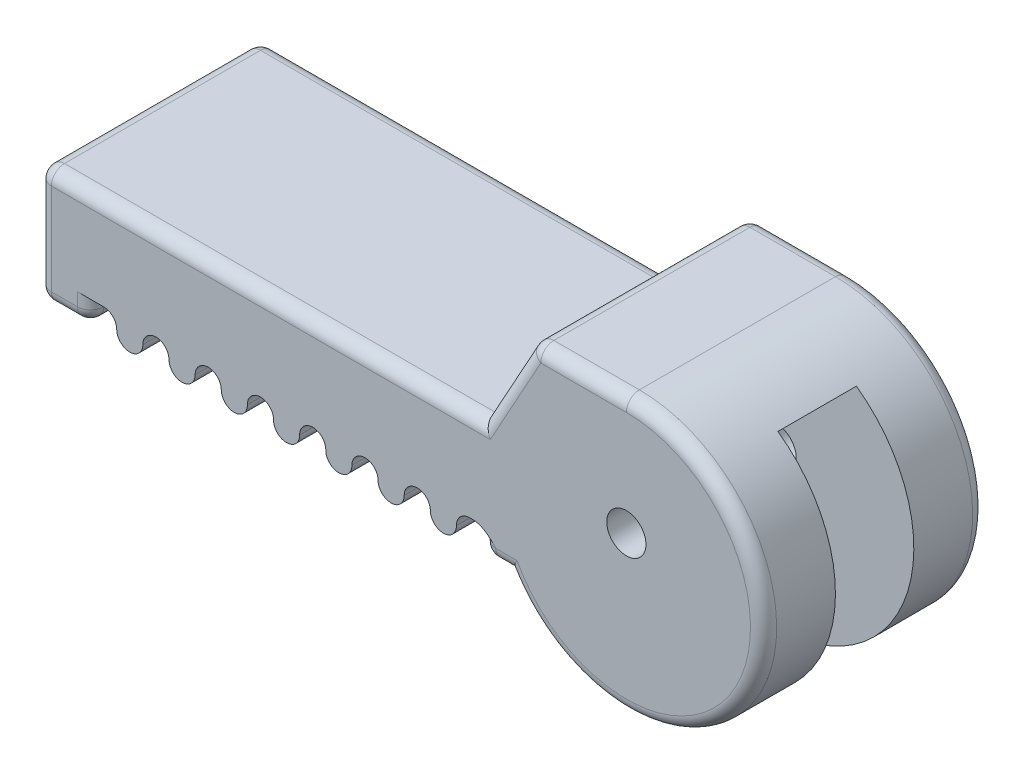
ISO-10303-21;
HEADER;
FILE_DESCRIPTION(('STEP AP214'),'2;1');
FILE_NAME('part.step','',(''),(''),'','','');
FILE_SCHEMA(('AUTOMOTIVE_DESIGN { 1 0 10303 214 1 1 1 1 }'));
ENDSEC;
DATA;
#1=APPLICATION_CONTEXT('core data for automotive mechanical design processes');
#2=APPLICATION_PROTOCOL_DEFINITION('international standard','automotive_design',2000,#1);
#3=PRODUCT_CONTEXT('',#1,'mechanical');
#4=PRODUCT('Part','Part','',(#3));
#5=PRODUCT_RELATED_PRODUCT_CATEGORY('part','',(#4));
#6=PRODUCT_DEFINITION_FORMATION('','',#4);
#7=PRODUCT_DEFINITION_CONTEXT('part definition',#1,'design');
#8=PRODUCT_DEFINITION('design','',#6,#7);
#9=PRODUCT_DEFINITION_SHAPE('','',#8);
#10=(LENGTH_UNIT() NAMED_UNIT(*) SI_UNIT(.MILLI.,.METRE.));
#11=(NAMED_UNIT(*) PLANE_ANGLE_UNIT() SI_UNIT($,.RADIAN.));
#12=(NAMED_UNIT(*) SI_UNIT($,.STERADIAN.) SOLID_ANGLE_UNIT());
#13=UNCERTAINTY_MEASURE_WITH_UNIT(LENGTH_MEASURE(1.E-05),#10,'distance_accuracy_value','');
#14=(GEOMETRIC_REPRESENTATION_CONTEXT(3) GLOBAL_UNCERTAINTY_ASSIGNED_CONTEXT((#13)) GLOBAL_UNIT_ASSIGNED_CONTEXT((#10,
#11,#12)) REPRESENTATION_CONTEXT('',''));
#15=CARTESIAN_POINT('',(0.,0.,0.));
#16=DIRECTION('',(0.,0.,1.));
#17=DIRECTION('',(1.,0.,0.));
#18=AXIS2_PLACEMENT_3D('',#15,#16,#17);
#19=CARTESIAN_POINT('',(0.,0.,17.));
#20=DIRECTION('',(0.,0.,-1.));
#21=DIRECTION('',(-1.,0.,0.));
#22=AXIS2_PLACEMENT_3D('',#19,#20,#21);
#23=CYLINDRICAL_SURFACE('',#22,10.5);
#24=DIRECTION('',(0.,0.,-1.));
#25=VECTOR('',#24,1.);
#26=CARTESIAN_POINT('',(-8.94427190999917,-5.49999999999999,17.));
#27=LINE('',#26,#25);
#28=CARTESIAN_POINT('',(-8.94427190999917,-5.49999999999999,16.));
#29=VERTEX_POINT('',#28);
#30=CARTESIAN_POINT('',(-8.94427190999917,-5.49999999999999,1.));
#31=VERTEX_POINT('',#30);
#32=EDGE_CURVE('E984',#29,#31,#27,.T.);
#33=ORIENTED_EDGE('',*,*,#32,.T.);
#34=CARTESIAN_POINT('',(0.,0.,1.));
#35=DIRECTION('',(0.,0.,1.));
#36=DIRECTION('',(1.,0.,0.));
#37=AXIS2_PLACEMENT_3D('',#34,#35,#36);
#38=CIRCLE('',#37,10.5);
#39=CARTESIAN_POINT('',(0.,10.5,1.));
#40=VERTEX_POINT('',#39);
#41=EDGE_CURVE('E1041',#31,#40,#38,.T.);
#42=ORIENTED_EDGE('',*,*,#41,.T.);
#43=DIRECTION('',(0.,0.,-1.));
#44=VECTOR('',#43,1.);
#45=CARTESIAN_POINT('',(0.,10.5,17.));
#46=LINE('',#45,#44);
#47=CARTESIAN_POINT('',(0.,10.5,16.));
#48=VERTEX_POINT('',#47);
#49=EDGE_CURVE('E981',#48,#40,#46,.T.);
#50=ORIENTED_EDGE('',*,*,#49,.F.);
#51=CARTESIAN_POINT('',(0.,0.,16.));
#52=DIRECTION('',(0.,0.,1.));
#53=DIRECTION('',(1.,0.,0.));
#54=AXIS2_PLACEMENT_3D('',#51,#52,#53);
#55=CIRCLE('',#54,10.5);
#56=EDGE_CURVE('E1021',#48,#29,#55,.F.);
#57=ORIENTED_EDGE('',*,*,#56,.T.);
#58=EDGE_LOOP('',(#33,#42,#50,#57));
#59=FACE_BOUND('',#58,.T.);
#60=CARTESIAN_POINT('',(0.,0.,5.5));
#61=DIRECTION('',(0.,0.,1.));
#62=DIRECTION('',(1.,0.,0.));
#63=AXIS2_PLACEMENT_3D('',#60,#61,#62);
#64=CIRCLE('',#63,10.5);
#65=CARTESIAN_POINT('',(-6.43112297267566,-8.30003959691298,5.5));
#66=VERTEX_POINT('',#65);
#67=CARTESIAN_POINT('',(6.10202400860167,8.54489923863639,5.5));
#68=VERTEX_POINT('',#67);
#69=EDGE_CURVE('E705',#66,#68,#64,.T.);
#70=ORIENTED_EDGE('',*,*,#69,.F.);
#71=DIRECTION('',(0.,0.,-1.));
#72=VECTOR('',#71,1.);
#73=CARTESIAN_POINT('',(-6.43112297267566,-8.30003959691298,17.));
#74=LINE('',#73,#72);
#75=CARTESIAN_POINT('',(-6.43112297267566,-8.30003959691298,11.5));
#76=VERTEX_POINT('',#75);
#77=EDGE_CURVE('E34',#66,#76,#74,.F.);
#78=ORIENTED_EDGE('',*,*,#77,.T.);
#79=CARTESIAN_POINT('',(0.,0.,11.5));
#80=DIRECTION('',(0.,0.,1.));
#81=DIRECTION('',(1.,0.,0.));
#82=AXIS2_PLACEMENT_3D('',#79,#80,#81);
#83=CIRCLE('',#82,10.5);
#84=CARTESIAN_POINT('',(6.10202400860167,8.54489923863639,11.5));
#85=VERTEX_POINT('',#84);
#86=EDGE_CURVE('E692',#76,#85,#83,.T.);
#87=ORIENTED_EDGE('',*,*,#86,.T.);
#88=DIRECTION('',(0.,0.,-1.));
#89=VECTOR('',#88,1.);
#90=CARTESIAN_POINT('',(6.10202400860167,8.54489923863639,17.));
#91=LINE('',#90,#89);
#92=EDGE_CURVE('E11',#68,#85,#91,.F.);
#93=ORIENTED_EDGE('',*,*,#92,.F.);
#94=EDGE_LOOP('',(#70,#78,#87,#93));
#95=FACE_BOUND('',#94,.T.);
#96=ADVANCED_FACE('F26',(#59,#95),#23,.T.);
#97=CARTESIAN_POINT('',(0.,1.50000000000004,-16.5));
#98=DIRECTION('',(0.,0.,1.));
#99=DIRECTION('',(1.,0.,0.));
#100=AXIS2_PLACEMENT_3D('',#97,#98,#99);
#101=CYLINDRICAL_SURFACE('',#100,1.5);
#102=CARTESIAN_POINT('',(0.,1.50000000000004,0.));
#103=DIRECTION('',(0.,0.,1.));
#104=DIRECTION('',(1.,0.,0.));
#105=AXIS2_PLACEMENT_3D('',#102,#103,#104);
#106=CIRCLE('',#105,1.5);
#107=CARTESIAN_POINT('',(1.5,1.50000000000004,0.));
#108=VERTEX_POINT('',#107);
#109=EDGE_CURVE('E710',#108,#108,#106,.T.);
#110=ORIENTED_EDGE('',*,*,#109,.F.);
#111=EDGE_LOOP('',(#110));
#112=FACE_BOUND('',#111,.T.);
#113=CARTESIAN_POINT('',(0.,1.50000000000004,5.5));
#114=DIRECTION('',(0.,0.,1.));
#115=DIRECTION('',(1.,0.,0.));
#116=AXIS2_PLACEMENT_3D('',#113,#114,#115);
#117=CIRCLE('',#116,1.5);
#118=CARTESIAN_POINT('',(1.5,1.50000000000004,5.5));
#119=VERTEX_POINT('',#118);
#120=EDGE_CURVE('E704',#119,#119,#117,.F.);
#121=ORIENTED_EDGE('',*,*,#120,.F.);
#122=EDGE_LOOP('',(#121));
#123=FACE_BOUND('',#122,.T.);
#124=ADVANCED_FACE('F1528',(#112,#123),#101,.F.);
#125=CARTESIAN_POINT('',(-41.,-3.49999999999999,17.));
#126=DIRECTION('',(0.,1.,0.));
#127=DIRECTION('',(0.,0.,1.));
#128=AXIS2_PLACEMENT_3D('',#125,#126,#127);
#129=PLANE('',#128);
#130=DIRECTION('',(1.,0.,0.));
#131=VECTOR('',#130,1.);
#132=CARTESIAN_POINT('',(-41.,-3.49999999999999,0.));
#133=LINE('',#132,#131);
#134=CARTESIAN_POINT('',(-42.,-3.49999999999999,0.));
#135=VERTEX_POINT('',#134);
#136=CARTESIAN_POINT('',(-40.,-3.49999999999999,0.));
#137=VERTEX_POINT('',#136);
#138=EDGE_CURVE('E960',#135,#137,#133,.T.);
#139=ORIENTED_EDGE('',*,*,#138,.T.);
#140=DIRECTION('',(0.,0.,-1.));
#141=VECTOR('',#140,1.);
#142=CARTESIAN_POINT('',(-40.,-3.49999999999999,17.));
#143=LINE('',#142,#141);
#144=CARTESIAN_POINT('',(-40.,-3.49999999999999,3.));
#145=VERTEX_POINT('',#144);
#146=EDGE_CURVE('E1128',#137,#145,#143,.F.);
#147=ORIENTED_EDGE('',*,*,#146,.T.);
#148=DIRECTION('',(1.,0.,0.));
#149=VECTOR('',#148,1.);
#150=CARTESIAN_POINT('',(-41.,-3.49999999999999,3.));
#151=LINE('',#150,#149);
#152=CARTESIAN_POINT('',(-41.,-3.49999999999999,3.));
#153=VERTEX_POINT('',#152);
#154=EDGE_CURVE('E836',#153,#145,#151,.T.);
#155=ORIENTED_EDGE('',*,*,#154,.F.);
#156=DIRECTION('',(0.,0.,-1.));
#157=VECTOR('',#156,1.);
#158=CARTESIAN_POINT('',(-41.,-3.49999999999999,17.));
#159=LINE('',#158,#157);
#160=CARTESIAN_POINT('',(-41.,-3.49999999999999,1.));
#161=VERTEX_POINT('',#160);
#162=EDGE_CURVE('E987',#153,#161,#159,.T.);
#163=ORIENTED_EDGE('',*,*,#162,.T.);
#164=CARTESIAN_POINT('',(-42.,-3.49999999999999,1.));
#165=DIRECTION('',(0.,1.,0.));
#166=DIRECTION('',(0.,0.,1.));
#167=AXIS2_PLACEMENT_3D('',#164,#165,#166);
#168=CIRCLE('',#167,1.);
#169=EDGE_CURVE('E1132',#161,#135,#168,.T.);
#170=ORIENTED_EDGE('',*,*,#169,.T.);
#171=EDGE_LOOP('',(#139,#147,#155,#163,#170));
#172=FACE_BOUND('',#171,.T.);
#173=ADVANCED_FACE('F1534',(#172),#129,.F.);
#174=CARTESIAN_POINT('',(-29.,-3.47741948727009,17.));
#175=DIRECTION('',(1.,0.,0.));
#176=DIRECTION('',(0.,0.,-1.));
#177=AXIS2_PLACEMENT_3D('',#174,#175,#176);
#178=PLANE('',#177);
#179=DIRECTION('',(0.,-1.,0.));
#180=VECTOR('',#179,1.);
#181=CARTESIAN_POINT('',(-29.,-3.47741948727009,0.));
#182=LINE('',#181,#180);
#183=CARTESIAN_POINT('',(-29.,-4.47741948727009,0.));
#184=VERTEX_POINT('',#183);
#185=CARTESIAN_POINT('',(-29.,-4.49999999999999,0.));
#186=VERTEX_POINT('',#185);
#187=EDGE_CURVE('E958',#184,#186,#182,.T.);
#188=ORIENTED_EDGE('',*,*,#187,.F.);
#189=DIRECTION('',(0.,0.,-1.));
#190=VECTOR('',#189,1.);
#191=CARTESIAN_POINT('',(-29.,-4.47741948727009,17.));
#192=LINE('',#191,#190);
#193=CARTESIAN_POINT('',(-29.,-4.47741948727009,3.));
#194=VERTEX_POINT('',#193);
#195=EDGE_CURVE('E1302',#184,#194,#192,.F.);
#196=ORIENTED_EDGE('',*,*,#195,.T.);
#197=DIRECTION('',(0.,-1.,0.));
#198=VECTOR('',#197,1.);
#199=CARTESIAN_POINT('',(-29.,-3.47741948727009,3.));
#200=LINE('',#199,#198);
#201=CARTESIAN_POINT('',(-29.,-4.49999999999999,3.));
#202=VERTEX_POINT('',#201);
#203=EDGE_CURVE('E834',#194,#202,#200,.T.);
#204=ORIENTED_EDGE('',*,*,#203,.T.);
#205=DIRECTION('',(0.,0.,-1.));
#206=VECTOR('',#205,1.);
#207=CARTESIAN_POINT('',(-29.,-4.49999999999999,17.));
#208=LINE('',#207,#206);
#209=EDGE_CURVE('E1227',#202,#186,#208,.T.);
#210=ORIENTED_EDGE('',*,*,#209,.T.);
#211=EDGE_LOOP('',(#188,#196,#204,#210));
#212=FACE_BOUND('',#211,.T.);
#213=ADVANCED_FACE('F1578',(#212),#178,.T.);
#214=CARTESIAN_POINT('',(-27.,-5.49999999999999,17.));
#215=DIRECTION('',(-1.,0.,0.));
#216=DIRECTION('',(0.,0.,1.));
#217=AXIS2_PLACEMENT_3D('',#214,#215,#216);
#218=PLANE('',#217);
#219=DIRECTION('',(0.,1.,0.));
#220=VECTOR('',#219,1.);
#221=CARTESIAN_POINT('',(-27.,-5.49999999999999,0.));
#222=LINE('',#221,#220);
#223=CARTESIAN_POINT('',(-27.,-4.49999999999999,0.));
#224=VERTEX_POINT('',#223);
#225=CARTESIAN_POINT('',(-27.,-4.47741948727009,0.));
#226=VERTEX_POINT('',#225);
#227=EDGE_CURVE('E955',#224,#226,#222,.T.);
#228=ORIENTED_EDGE('',*,*,#227,.F.);
#229=DIRECTION('',(0.,0.,-1.));
#230=VECTOR('',#229,1.);
#231=CARTESIAN_POINT('',(-27.,-4.49999999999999,17.));
#232=LINE('',#231,#230);
#233=CARTESIAN_POINT('',(-27.,-4.49999999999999,3.));
#234=VERTEX_POINT('',#233);
#235=EDGE_CURVE('E1277',#224,#234,#232,.F.);
#236=ORIENTED_EDGE('',*,*,#235,.T.);
#237=DIRECTION('',(0.,1.,0.));
#238=VECTOR('',#237,1.);
#239=CARTESIAN_POINT('',(-27.,-5.49999999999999,3.));
#240=LINE('',#239,#238);
#241=CARTESIAN_POINT('',(-27.,-4.47741948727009,3.));
#242=VERTEX_POINT('',#241);
#243=EDGE_CURVE('E831',#234,#242,#240,.T.);
#244=ORIENTED_EDGE('',*,*,#243,.T.);
#245=DIRECTION('',(0.,0.,-1.));
#246=VECTOR('',#245,1.);
#247=CARTESIAN_POINT('',(-27.,-4.47741948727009,17.));
#248=LINE('',#247,#246);
#249=EDGE_CURVE('E1274',#242,#226,#248,.T.);
#250=ORIENTED_EDGE('',*,*,#249,.T.);
#251=EDGE_LOOP('',(#228,#236,#244,#250));
#252=FACE_BOUND('',#251,.T.);
#253=ADVANCED_FACE('F1573',(#252),#218,.T.);
#254=CARTESIAN_POINT('',(-25.,-5.49999999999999,17.));
#255=DIRECTION('',(-1.,0.,0.));
#256=DIRECTION('',(0.,0.,1.));
#257=AXIS2_PLACEMENT_3D('',#254,#255,#256);
#258=PLANE('',#257);
#259=DIRECTION('',(0.,1.,0.));
#260=VECTOR('',#259,1.);
#261=CARTESIAN_POINT('',(-25.,-5.49999999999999,0.));
#262=LINE('',#261,#260);
#263=CARTESIAN_POINT('',(-25.,-4.49999999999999,0.));
#264=VERTEX_POINT('',#263);
#265=CARTESIAN_POINT('',(-25.,-4.47741948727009,0.));
#266=VERTEX_POINT('',#265);
#267=EDGE_CURVE('E952',#264,#266,#262,.T.);
#268=ORIENTED_EDGE('',*,*,#267,.T.);
#269=DIRECTION('',(0.,0.,-1.));
#270=VECTOR('',#269,1.);
#271=CARTESIAN_POINT('',(-25.,-4.47741948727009,17.));
#272=LINE('',#271,#270);
#273=CARTESIAN_POINT('',(-25.,-4.47741948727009,3.));
#274=VERTEX_POINT('',#273);
#275=EDGE_CURVE('E1908',#266,#274,#272,.F.);
#276=ORIENTED_EDGE('',*,*,#275,.T.);
#277=DIRECTION('',(0.,1.,0.));
#278=VECTOR('',#277,1.);
#279=CARTESIAN_POINT('',(-25.,-5.49999999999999,3.));
#280=LINE('',#279,#278);
#281=CARTESIAN_POINT('',(-25.,-4.49999999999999,3.));
#282=VERTEX_POINT('',#281);
#283=EDGE_CURVE('E828',#282,#274,#280,.T.);
#284=ORIENTED_EDGE('',*,*,#283,.F.);
#285=DIRECTION('',(0.,0.,-1.));
#286=VECTOR('',#285,1.);
#287=CARTESIAN_POINT('',(-25.,-4.49999999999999,17.));
#288=LINE('',#287,#286);
#289=EDGE_CURVE('E1287',#282,#264,#288,.T.);
#290=ORIENTED_EDGE('',*,*,#289,.T.);
#291=EDGE_LOOP('',(#268,#276,#284,#290));
#292=FACE_BOUND('',#291,.T.);
#293=ADVANCED_FACE('F1568',(#292),#258,.F.);
#294=CARTESIAN_POINT('',(-23.,-3.47741948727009,17.));
#295=DIRECTION('',(1.,0.,0.));
#296=DIRECTION('',(0.,0.,-1.));
#297=AXIS2_PLACEMENT_3D('',#294,#295,#296);
#298=PLANE('',#297);
#299=DIRECTION('',(0.,-1.,0.));
#300=VECTOR('',#299,1.);
#301=CARTESIAN_POINT('',(-23.,-3.47741948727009,3.));
#302=LINE('',#301,#300);
#303=CARTESIAN_POINT('',(-23.,-4.47741948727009,3.));
#304=VERTEX_POINT('',#303);
#305=CARTESIAN_POINT('',(-23.,-4.49999999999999,3.));
#306=VERTEX_POINT('',#305);
#307=EDGE_CURVE('E826',#304,#306,#302,.T.);
#308=ORIENTED_EDGE('',*,*,#307,.F.);
#309=DIRECTION('',(0.,0.,-1.));
#310=VECTOR('',#309,1.);
#311=CARTESIAN_POINT('',(-23.,-4.47741948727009,17.));
#312=LINE('',#311,#310);
#313=CARTESIAN_POINT('',(-23.,-4.47741948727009,0.));
#314=VERTEX_POINT('',#313);
#315=EDGE_CURVE('E1395',#304,#314,#312,.T.);
#316=ORIENTED_EDGE('',*,*,#315,.T.);
#317=DIRECTION('',(0.,-1.,0.));
#318=VECTOR('',#317,1.);
#319=CARTESIAN_POINT('',(-23.,-3.47741948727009,0.));
#320=LINE('',#319,#318);
#321=CARTESIAN_POINT('',(-23.,-4.49999999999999,0.));
#322=VERTEX_POINT('',#321);
#323=EDGE_CURVE('E950',#314,#322,#320,.T.);
#324=ORIENTED_EDGE('',*,*,#323,.T.);
#325=DIRECTION('',(0.,0.,-1.));
#326=VECTOR('',#325,1.);
#327=CARTESIAN_POINT('',(-23.,-4.49999999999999,17.));
#328=LINE('',#327,#326);
#329=EDGE_CURVE('E1373',#322,#306,#328,.F.);
#330=ORIENTED_EDGE('',*,*,#329,.T.);
#331=EDGE_LOOP('',(#308,#316,#324,#330));
#332=FACE_BOUND('',#331,.T.);
#333=ADVANCED_FACE('F1563',(#332),#298,.F.);
#334=CARTESIAN_POINT('',(-13.,-3.47741948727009,17.));
#335=DIRECTION('',(1.,0.,0.));
#336=DIRECTION('',(0.,0.,-1.));
#337=AXIS2_PLACEMENT_3D('',#334,#335,#336);
#338=PLANE('',#337);
#339=DIRECTION('',(0.,-1.,0.));
#340=VECTOR('',#339,1.);
#341=CARTESIAN_POINT('',(-13.,-3.47741948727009,3.));
#342=LINE('',#341,#340);
#343=CARTESIAN_POINT('',(-13.,-4.47741948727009,3.));
#344=VERTEX_POINT('',#343);
#345=CARTESIAN_POINT('',(-13.,-4.49999999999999,3.));
#346=VERTEX_POINT('',#345);
#347=EDGE_CURVE('E823',#344,#346,#342,.T.);
#348=ORIENTED_EDGE('',*,*,#347,.T.);
#349=DIRECTION('',(0.,0.,-1.));
#350=VECTOR('',#349,1.);
#351=CARTESIAN_POINT('',(-13.,-4.49999999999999,17.));
#352=LINE('',#351,#350);
#353=CARTESIAN_POINT('',(-13.,-4.49999999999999,0.));
#354=VERTEX_POINT('',#353);
#355=EDGE_CURVE('E1354',#346,#354,#352,.T.);
#356=ORIENTED_EDGE('',*,*,#355,.T.);
#357=DIRECTION('',(0.,-1.,0.));
#358=VECTOR('',#357,1.);
#359=CARTESIAN_POINT('',(-13.,-3.47741948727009,0.));
#360=LINE('',#359,#358);
#361=CARTESIAN_POINT('',(-13.,-4.47741948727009,0.));
#362=VERTEX_POINT('',#361);
#363=EDGE_CURVE('E947',#362,#354,#360,.T.);
#364=ORIENTED_EDGE('',*,*,#363,.F.);
#365=DIRECTION('',(0.,0.,-1.));
#366=VECTOR('',#365,1.);
#367=CARTESIAN_POINT('',(-13.,-4.47741948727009,17.));
#368=LINE('',#367,#366);
#369=EDGE_CURVE('E1352',#362,#344,#368,.F.);
#370=ORIENTED_EDGE('',*,*,#369,.T.);
#371=EDGE_LOOP('',(#348,#356,#364,#370));
#372=FACE_BOUND('',#371,.T.);
#373=ADVANCED_FACE('F1558',(#372),#338,.T.);
#374=CARTESIAN_POINT('',(-11.,-3.47741948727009,17.));
#375=DIRECTION('',(0.,-1.,0.));
#376=DIRECTION('',(1.,0.,0.));
#377=AXIS2_PLACEMENT_3D('',#374,#375,#376);
#378=PLANE('',#377);
#379=DIRECTION('',(-1.,0.,0.));
#380=VECTOR('',#379,1.);
#381=CARTESIAN_POINT('',(-11.,-3.47741948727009,0.));
#382=LINE('',#381,#380);
#383=CARTESIAN_POINT('',(-11.7320508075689,-3.47741948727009,0.));
#384=VERTEX_POINT('',#383);
#385=CARTESIAN_POINT('',(-12.,-3.47741948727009,0.));
#386=VERTEX_POINT('',#385);
#387=EDGE_CURVE('E944',#384,#386,#382,.T.);
#388=ORIENTED_EDGE('',*,*,#387,.F.);
#389=CARTESIAN_POINT('',(-9.99999999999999,-3.4774194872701,1.));
#390=DIRECTION('',(0.,-1.,0.));
#391=DIRECTION('',(1.,0.,0.));
#392=AXIS2_PLACEMENT_3D('',#389,#390,#391);
#393=CIRCLE('',#392,2.);
#394=CARTESIAN_POINT('',(-12.,-3.47741948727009,1.));
#395=VERTEX_POINT('',#394);
#396=EDGE_CURVE('E1388',#384,#395,#393,.F.);
#397=ORIENTED_EDGE('',*,*,#396,.T.);
#398=DIRECTION('',(0.,0.,-1.));
#399=VECTOR('',#398,1.);
#400=CARTESIAN_POINT('',(-12.,-3.47741948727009,17.));
#401=LINE('',#400,#399);
#402=EDGE_CURVE('E1357',#395,#386,#401,.T.);
#403=ORIENTED_EDGE('',*,*,#402,.T.);
#404=EDGE_LOOP('',(#388,#397,#403));
#405=FACE_BOUND('',#404,.T.);
#406=ADVANCED_FACE('F1553',(#405),#378,.T.);
#407=CARTESIAN_POINT('',(-11.,-5.49999999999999,17.));
#408=DIRECTION('',(-1.,0.,0.));
#409=DIRECTION('',(0.,0.,1.));
#410=AXIS2_PLACEMENT_3D('',#407,#408,#409);
#411=PLANE('',#410);
#412=DIRECTION('',(0.,1.,0.));
#413=VECTOR('',#412,1.);
#414=CARTESIAN_POINT('',(-11.,-5.49999999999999,3.));
#415=LINE('',#414,#413);
#416=CARTESIAN_POINT('',(-11.,-4.49999999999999,3.));
#417=VERTEX_POINT('',#416);
#418=CARTESIAN_POINT('',(-11.,-4.47741948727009,3.));
#419=VERTEX_POINT('',#418);
#420=EDGE_CURVE('E820',#417,#419,#415,.T.);
#421=ORIENTED_EDGE('',*,*,#420,.T.);
#422=DIRECTION('',(0.,0.,-1.));
#423=VECTOR('',#422,1.);
#424=CARTESIAN_POINT('',(-11.,-4.47741948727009,17.));
#425=LINE('',#424,#423);
#426=CARTESIAN_POINT('',(-11.,-4.47741948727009,1.));
#427=VERTEX_POINT('',#426);
#428=EDGE_CURVE('E1393',#419,#427,#425,.T.);
#429=ORIENTED_EDGE('',*,*,#428,.T.);
#430=DIRECTION('',(0.,1.,0.));
#431=VECTOR('',#430,1.);
#432=CARTESIAN_POINT('',(-11.,0.,1.));
#433=LINE('',#432,#431);
#434=CARTESIAN_POINT('',(-11.,-4.49999999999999,1.));
#435=VERTEX_POINT('',#434);
#436=EDGE_CURVE('E1332',#427,#435,#433,.F.);
#437=ORIENTED_EDGE('',*,*,#436,.T.);
#438=DIRECTION('',(0.,0.,-1.));
#439=VECTOR('',#438,1.);
#440=CARTESIAN_POINT('',(-11.,-4.49999999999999,17.));
#441=LINE('',#440,#439);
#442=EDGE_CURVE('E1330',#435,#417,#441,.F.);
#443=ORIENTED_EDGE('',*,*,#442,.T.);
#444=EDGE_LOOP('',(#421,#429,#437,#443));
#445=FACE_BOUND('',#444,.T.);
#446=ADVANCED_FACE('F1548',(#445),#411,.T.);
#447=CARTESIAN_POINT('',(-11.,3.50000000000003,17.));
#448=DIRECTION('',(-0.875450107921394,0.483308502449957,0.));
#449=DIRECTION('',(-0.483308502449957,-0.875450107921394,0.));
#450=AXIS2_PLACEMENT_3D('',#447,#448,#449);
#451=PLANE('',#450);
#452=DIRECTION('',(0.,0.,-1.));
#453=VECTOR('',#452,1.);
#454=CARTESIAN_POINT('',(-7.4207690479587,9.98330850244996,17.));
#455=LINE('',#454,#453);
#456=CARTESIAN_POINT('',(-7.4207690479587,9.98330850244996,16.));
#457=VERTEX_POINT('',#456);
#458=CARTESIAN_POINT('',(-7.4207690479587,9.98330850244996,1.));
#459=VERTEX_POINT('',#458);
#460=EDGE_CURVE('E1033',#457,#459,#455,.T.);
#461=ORIENTED_EDGE('',*,*,#460,.T.);
#462=DIRECTION('',(0.483308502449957,0.875450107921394,0.));
#463=VECTOR('',#462,1.);
#464=CARTESIAN_POINT('',(-9.91143548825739,5.47179216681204,1.));
#465=LINE('',#464,#463);
#466=CARTESIAN_POINT('',(-11.,3.50000000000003,1.));
#467=VERTEX_POINT('',#466);
#468=EDGE_CURVE('E1059',#459,#467,#465,.F.);
#469=ORIENTED_EDGE('',*,*,#468,.T.);
#470=DIRECTION('',(0.,0.,-1.));
#471=VECTOR('',#470,1.);
#472=CARTESIAN_POINT('',(-11.,3.50000000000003,17.));
#473=LINE('',#472,#471);
#474=CARTESIAN_POINT('',(-11.,3.50000000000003,16.));
#475=VERTEX_POINT('',#474);
#476=EDGE_CURVE('E990',#475,#467,#473,.T.);
#477=ORIENTED_EDGE('',*,*,#476,.F.);
#478=DIRECTION('',(0.483308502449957,0.875450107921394,0.));
#479=VECTOR('',#478,1.);
#480=CARTESIAN_POINT('',(-11.,3.50000000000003,16.));
#481=LINE('',#480,#479);
#482=EDGE_CURVE('E1018',#475,#457,#481,.T.);
#483=ORIENTED_EDGE('',*,*,#482,.T.);
#484=EDGE_LOOP('',(#461,#469,#477,#483));
#485=FACE_BOUND('',#484,.T.);
#486=ADVANCED_FACE('F1429',(#485),#451,.T.);
#487=CARTESIAN_POINT('',(-45.,3.50000000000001,17.));
#488=DIRECTION('',(0.,1.,0.));
#489=DIRECTION('',(-1.,0.,0.));
#490=AXIS2_PLACEMENT_3D('',#487,#488,#489);
#491=PLANE('',#490);
#492=DIRECTION('',(1.,0.,0.));
#493=VECTOR('',#492,1.);
#494=CARTESIAN_POINT('',(0.,3.50000000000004,1.));
#495=LINE('',#494,#493);
#496=CARTESIAN_POINT('',(-44.,3.50000000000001,1.));
#497=VERTEX_POINT('',#496);
#498=EDGE_CURVE('E1061',#467,#497,#495,.F.);
#499=ORIENTED_EDGE('',*,*,#498,.T.);
#500=DIRECTION('',(0.,0.,-1.));
#501=VECTOR('',#500,1.);
#502=CARTESIAN_POINT('',(-44.,3.50000000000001,17.));
#503=LINE('',#502,#501);
#504=CARTESIAN_POINT('',(-44.,3.50000000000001,16.));
#505=VERTEX_POINT('',#504);
#506=EDGE_CURVE('E1096',#497,#505,#503,.F.);
#507=ORIENTED_EDGE('',*,*,#506,.T.);
#508=DIRECTION('',(1.,0.,0.));
#509=VECTOR('',#508,1.);
#510=CARTESIAN_POINT('',(-45.,3.50000000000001,16.));
#511=LINE('',#510,#509);
#512=EDGE_CURVE('E1016',#505,#475,#511,.T.);
#513=ORIENTED_EDGE('',*,*,#512,.T.);
#514=ORIENTED_EDGE('',*,*,#476,.T.);
#515=EDGE_LOOP('',(#499,#507,#513,#514));
#516=FACE_BOUND('',#515,.T.);
#517=ADVANCED_FACE('F28',(#516),#491,.T.);
#518=CARTESIAN_POINT('',(-45.,3.50000000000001,17.));
#519=DIRECTION('',(1.,0.,0.));
#520=DIRECTION('',(0.,0.,-1.));
#521=AXIS2_PLACEMENT_3D('',#518,#519,#520);
#522=PLANE('',#521);
#523=DIRECTION('',(0.,-1.,0.));
#524=VECTOR('',#523,1.);
#525=CARTESIAN_POINT('',(-45.,3.50000000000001,1.));
#526=LINE('',#525,#524);
#527=CARTESIAN_POINT('',(-45.,2.50000000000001,1.));
#528=VERTEX_POINT('',#527);
#529=CARTESIAN_POINT('',(-45.,-4.49999999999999,1.));
#530=VERTEX_POINT('',#529);
#531=EDGE_CURVE('E1064',#528,#530,#526,.T.);
#532=ORIENTED_EDGE('',*,*,#531,.T.);
#533=DIRECTION('',(0.,0.,-1.));
#534=VECTOR('',#533,1.);
#535=CARTESIAN_POINT('',(-45.,-4.49999999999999,17.));
#536=LINE('',#535,#534);
#537=CARTESIAN_POINT('',(-45.,-4.49999999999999,16.));
#538=VERTEX_POINT('',#537);
#539=EDGE_CURVE('E1094',#530,#538,#536,.F.);
#540=ORIENTED_EDGE('',*,*,#539,.T.);
#541=DIRECTION('',(0.,-1.,0.));
#542=VECTOR('',#541,1.);
#543=CARTESIAN_POINT('',(-45.,0.,16.));
#544=LINE('',#543,#542);
#545=CARTESIAN_POINT('',(-45.,2.50000000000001,16.));
#546=VERTEX_POINT('',#545);
#547=EDGE_CURVE('E1013',#538,#546,#544,.F.);
#548=ORIENTED_EDGE('',*,*,#547,.T.);
#549=DIRECTION('',(0.,0.,-1.));
#550=VECTOR('',#549,1.);
#551=CARTESIAN_POINT('',(-45.,2.50000000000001,17.));
#552=LINE('',#551,#550);
#553=EDGE_CURVE('E1092',#546,#528,#552,.T.);
#554=ORIENTED_EDGE('',*,*,#553,.T.);
#555=EDGE_LOOP('',(#532,#540,#548,#554));
#556=FACE_BOUND('',#555,.T.);
#557=ADVANCED_FACE('F1588',(#556),#522,.F.);
#558=CARTESIAN_POINT('',(-45.,-5.49999999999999,17.));
#559=DIRECTION('',(0.,1.,0.));
#560=DIRECTION('',(0.,0.,1.));
#561=AXIS2_PLACEMENT_3D('',#558,#559,#560);
#562=PLANE('',#561);
#563=DIRECTION('',(1.,0.,0.));
#564=VECTOR('',#563,1.);
#565=CARTESIAN_POINT('',(-45.,-5.49999999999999,1.));
#566=LINE('',#565,#564);
#567=CARTESIAN_POINT('',(-44.,-5.49999999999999,1.));
#568=VERTEX_POINT('',#567);
#569=CARTESIAN_POINT('',(-42.,-5.49999999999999,1.));
#570=VERTEX_POINT('',#569);
#571=EDGE_CURVE('E1071',#568,#570,#566,.T.);
#572=ORIENTED_EDGE('',*,*,#571,.T.);
#573=DIRECTION('',(0.,0.,-1.));
#574=VECTOR('',#573,1.);
#575=CARTESIAN_POINT('',(-42.,-5.49999999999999,17.));
#576=LINE('',#575,#574);
#577=CARTESIAN_POINT('',(-42.,-5.49999999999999,16.));
#578=VERTEX_POINT('',#577);
#579=EDGE_CURVE('E1121',#570,#578,#576,.F.);
#580=ORIENTED_EDGE('',*,*,#579,.T.);
#581=DIRECTION('',(1.,0.,0.));
#582=VECTOR('',#581,1.);
#583=CARTESIAN_POINT('',(0.,-5.49999999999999,16.));
#584=LINE('',#583,#582);
#585=CARTESIAN_POINT('',(-44.,-5.49999999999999,16.));
#586=VERTEX_POINT('',#585);
#587=EDGE_CURVE('E1026',#578,#586,#584,.F.);
#588=ORIENTED_EDGE('',*,*,#587,.T.);
#589=DIRECTION('',(0.,0.,-1.));
#590=VECTOR('',#589,1.);
#591=CARTESIAN_POINT('',(-44.,-5.49999999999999,17.));
#592=LINE('',#591,#590);
#593=EDGE_CURVE('E1069',#586,#568,#592,.T.);
#594=ORIENTED_EDGE('',*,*,#593,.T.);
#595=EDGE_LOOP('',(#572,#580,#588,#594));
#596=FACE_BOUND('',#595,.T.);
#597=ADVANCED_FACE('F1585',(#596),#562,.F.);
#598=CARTESIAN_POINT('',(-41.,-5.49999999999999,17.));
#599=DIRECTION('',(-1.,0.,0.));
#600=DIRECTION('',(0.,0.,1.));
#601=AXIS2_PLACEMENT_3D('',#598,#599,#600);
#602=PLANE('',#601);
#603=CARTESIAN_POINT('',(-41.,-3.49999999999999,16.));
#604=VERTEX_POINT('',#603);
#605=CARTESIAN_POINT('',(-41.,-3.49999999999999,14.));
#606=VERTEX_POINT('',#605);
#607=EDGE_CURVE('E988',#604,#606,#159,.T.);
#608=ORIENTED_EDGE('',*,*,#607,.F.);
#609=DIRECTION('',(0.,1.,0.));
#610=VECTOR('',#609,1.);
#611=CARTESIAN_POINT('',(-41.,0.,16.));
#612=LINE('',#611,#610);
#613=CARTESIAN_POINT('',(-41.,-4.49999999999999,16.));
#614=VERTEX_POINT('',#613);
#615=EDGE_CURVE('E1108',#604,#614,#612,.F.);
#616=ORIENTED_EDGE('',*,*,#615,.T.);
#617=DIRECTION('',(0.,0.,-1.));
#618=VECTOR('',#617,1.);
#619=CARTESIAN_POINT('',(-41.,-4.49999999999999,17.));
#620=LINE('',#619,#618);
#621=CARTESIAN_POINT('',(-41.,-4.49999999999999,1.));
#622=VERTEX_POINT('',#621);
#623=EDGE_CURVE('E1104',#614,#622,#620,.T.);
#624=ORIENTED_EDGE('',*,*,#623,.T.);
#625=DIRECTION('',(0.,1.,0.));
#626=VECTOR('',#625,1.);
#627=CARTESIAN_POINT('',(-41.,-5.49999999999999,1.));
#628=LINE('',#627,#626);
#629=EDGE_CURVE('E1106',#622,#161,#628,.T.);
#630=ORIENTED_EDGE('',*,*,#629,.T.);
#631=ORIENTED_EDGE('',*,*,#162,.F.);
#632=DIRECTION('',(0.,-1.,0.));
#633=VECTOR('',#632,1.);
#634=CARTESIAN_POINT('',(-41.,-1.99999999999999,3.));
#635=LINE('',#634,#633);
#636=CARTESIAN_POINT('',(-41.,-1.99999999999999,3.));
#637=VERTEX_POINT('',#636);
#638=EDGE_CURVE('E809',#637,#153,#635,.T.);
#639=ORIENTED_EDGE('',*,*,#638,.F.);
#640=DIRECTION('',(0.,0.,-1.));
#641=VECTOR('',#640,1.);
#642=CARTESIAN_POINT('',(-41.,-1.99999999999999,14.));
#643=LINE('',#642,#641);
#644=CARTESIAN_POINT('',(-41.,-1.99999999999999,14.));
#645=VERTEX_POINT('',#644);
#646=EDGE_CURVE('E797',#645,#637,#643,.T.);
#647=ORIENTED_EDGE('',*,*,#646,.F.);
#648=DIRECTION('',(0.,-1.,0.));
#649=VECTOR('',#648,1.);
#650=CARTESIAN_POINT('',(-41.,-1.99999999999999,14.));
#651=LINE('',#650,#649);
#652=EDGE_CURVE('E817',#645,#606,#651,.T.);
#653=ORIENTED_EDGE('',*,*,#652,.T.);
#654=EDGE_LOOP('',(#608,#616,#624,#630,#631,#639,#647,#653));
#655=FACE_BOUND('',#654,.T.);
#656=ADVANCED_FACE('F1581',(#655),#602,.F.);
#657=DIRECTION('',(1.,0.,0.));
#658=VECTOR('',#657,1.);
#659=CARTESIAN_POINT('',(-41.,-3.49999999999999,14.));
#660=LINE('',#659,#658);
#661=CARTESIAN_POINT('',(-40.,-3.49999999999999,14.));
#662=VERTEX_POINT('',#661);
#663=EDGE_CURVE('E855',#606,#662,#660,.T.);
#664=ORIENTED_EDGE('',*,*,#663,.T.);
#665=DIRECTION('',(0.,0.,-1.));
#666=VECTOR('',#665,1.);
#667=CARTESIAN_POINT('',(-40.,-3.49999999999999,17.));
#668=LINE('',#667,#666);
#669=CARTESIAN_POINT('',(-40.,-3.49999999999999,17.));
#670=VERTEX_POINT('',#669);
#671=EDGE_CURVE('E1123',#662,#670,#668,.F.);
#672=ORIENTED_EDGE('',*,*,#671,.T.);
#673=DIRECTION('',(1.,0.,0.));
#674=VECTOR('',#673,1.);
#675=CARTESIAN_POINT('',(-41.,-3.49999999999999,17.));
#676=LINE('',#675,#674);
#677=CARTESIAN_POINT('',(-42.,-3.49999999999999,17.));
#678=VERTEX_POINT('',#677);
#679=EDGE_CURVE('E978',#678,#670,#676,.T.);
#680=ORIENTED_EDGE('',*,*,#679,.F.);
#681=CARTESIAN_POINT('',(-42.,-3.49999999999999,16.));
#682=DIRECTION('',(0.,1.,0.));
#683=DIRECTION('',(0.,0.,1.));
#684=AXIS2_PLACEMENT_3D('',#681,#682,#683);
#685=CIRCLE('',#684,1.);
#686=EDGE_CURVE('E1130',#678,#604,#685,.T.);
#687=ORIENTED_EDGE('',*,*,#686,.T.);
#688=ORIENTED_EDGE('',*,*,#607,.T.);
#689=EDGE_LOOP('',(#664,#672,#680,#687,#688));
#690=FACE_BOUND('',#689,.T.);
#691=ADVANCED_FACE('F1576',(#690),#129,.F.);
#692=DIRECTION('',(0.,-1.,0.));
#693=VECTOR('',#692,1.);
#694=CARTESIAN_POINT('',(-29.,-3.47741948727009,14.));
#695=LINE('',#694,#693);
#696=CARTESIAN_POINT('',(-29.,-4.47741948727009,14.));
#697=VERTEX_POINT('',#696);
#698=CARTESIAN_POINT('',(-29.,-4.49999999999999,14.));
#699=VERTEX_POINT('',#698);
#700=EDGE_CURVE('E853',#697,#699,#695,.T.);
#701=ORIENTED_EDGE('',*,*,#700,.F.);
#702=DIRECTION('',(0.,0.,-1.));
#703=VECTOR('',#702,1.);
#704=CARTESIAN_POINT('',(-29.,-4.47741948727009,17.));
#705=LINE('',#704,#703);
#706=CARTESIAN_POINT('',(-29.,-4.47741948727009,17.));
#707=VERTEX_POINT('',#706);
#708=EDGE_CURVE('E1761',#697,#707,#705,.F.);
#709=ORIENTED_EDGE('',*,*,#708,.T.);
#710=DIRECTION('',(0.,-1.,0.));
#711=VECTOR('',#710,1.);
#712=CARTESIAN_POINT('',(-29.,-3.47741948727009,17.));
#713=LINE('',#712,#711);
#714=CARTESIAN_POINT('',(-29.,-4.49999999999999,17.));
#715=VERTEX_POINT('',#714);
#716=EDGE_CURVE('E976',#707,#715,#713,.T.);
#717=ORIENTED_EDGE('',*,*,#716,.T.);
#718=DIRECTION('',(0.,0.,-1.));
#719=VECTOR('',#718,1.);
#720=CARTESIAN_POINT('',(-29.,-4.49999999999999,17.));
#721=LINE('',#720,#719);
#722=EDGE_CURVE('E1224',#715,#699,#721,.T.);
#723=ORIENTED_EDGE('',*,*,#722,.T.);
#724=EDGE_LOOP('',(#701,#709,#717,#723));
#725=FACE_BOUND('',#724,.T.);
#726=ADVANCED_FACE('F1571',(#725),#178,.T.);
#727=DIRECTION('',(0.,1.,0.));
#728=VECTOR('',#727,1.);
#729=CARTESIAN_POINT('',(-27.,-5.49999999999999,17.));
#730=LINE('',#729,#728);
#731=CARTESIAN_POINT('',(-27.,-4.49999999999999,17.));
#732=VERTEX_POINT('',#731);
#733=CARTESIAN_POINT('',(-27.,-4.47741948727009,17.));
#734=VERTEX_POINT('',#733);
#735=EDGE_CURVE('E973',#732,#734,#730,.T.);
#736=ORIENTED_EDGE('',*,*,#735,.T.);
#737=DIRECTION('',(0.,0.,-1.));
#738=VECTOR('',#737,1.);
#739=CARTESIAN_POINT('',(-27.,-4.47741948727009,17.));
#740=LINE('',#739,#738);
#741=CARTESIAN_POINT('',(-27.,-4.47741948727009,14.));
#742=VERTEX_POINT('',#741);
#743=EDGE_CURVE('E1262',#734,#742,#740,.T.);
#744=ORIENTED_EDGE('',*,*,#743,.T.);
#745=DIRECTION('',(0.,1.,0.));
#746=VECTOR('',#745,1.);
#747=CARTESIAN_POINT('',(-27.,-5.49999999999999,14.));
#748=LINE('',#747,#746);
#749=CARTESIAN_POINT('',(-27.,-4.49999999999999,14.));
#750=VERTEX_POINT('',#749);
#751=EDGE_CURVE('E850',#750,#742,#748,.T.);
#752=ORIENTED_EDGE('',*,*,#751,.F.);
#753=DIRECTION('',(0.,0.,-1.));
#754=VECTOR('',#753,1.);
#755=CARTESIAN_POINT('',(-27.,-4.49999999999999,17.));
#756=LINE('',#755,#754);
#757=EDGE_CURVE('E1259',#750,#732,#756,.F.);
#758=ORIENTED_EDGE('',*,*,#757,.T.);
#759=EDGE_LOOP('',(#736,#744,#752,#758));
#760=FACE_BOUND('',#759,.T.);
#761=ADVANCED_FACE('F1566',(#760),#218,.T.);
#762=DIRECTION('',(0.,1.,0.));
#763=VECTOR('',#762,1.);
#764=CARTESIAN_POINT('',(-25.,-5.49999999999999,14.));
#765=LINE('',#764,#763);
#766=CARTESIAN_POINT('',(-25.,-4.49999999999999,14.));
#767=VERTEX_POINT('',#766);
#768=CARTESIAN_POINT('',(-25.,-4.47741948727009,14.));
#769=VERTEX_POINT('',#768);
#770=EDGE_CURVE('E847',#767,#769,#765,.T.);
#771=ORIENTED_EDGE('',*,*,#770,.T.);
#772=DIRECTION('',(0.,0.,-1.));
#773=VECTOR('',#772,1.);
#774=CARTESIAN_POINT('',(-25.,-4.47741948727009,17.));
#775=LINE('',#774,#773);
#776=CARTESIAN_POINT('',(-25.,-4.47741948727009,17.));
#777=VERTEX_POINT('',#776);
#778=EDGE_CURVE('E1845',#769,#777,#775,.F.);
#779=ORIENTED_EDGE('',*,*,#778,.T.);
#780=DIRECTION('',(0.,1.,0.));
#781=VECTOR('',#780,1.);
#782=CARTESIAN_POINT('',(-25.,-5.49999999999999,17.));
#783=LINE('',#782,#781);
#784=CARTESIAN_POINT('',(-25.,-4.49999999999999,17.));
#785=VERTEX_POINT('',#784);
#786=EDGE_CURVE('E970',#785,#777,#783,.T.);
#787=ORIENTED_EDGE('',*,*,#786,.F.);
#788=DIRECTION('',(0.,0.,-1.));
#789=VECTOR('',#788,1.);
#790=CARTESIAN_POINT('',(-25.,-4.49999999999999,17.));
#791=LINE('',#790,#789);
#792=EDGE_CURVE('E1268',#785,#767,#791,.T.);
#793=ORIENTED_EDGE('',*,*,#792,.T.);
#794=EDGE_LOOP('',(#771,#779,#787,#793));
#795=FACE_BOUND('',#794,.T.);
#796=ADVANCED_FACE('F1561',(#795),#258,.F.);
#797=DIRECTION('',(0.,-1.,0.));
#798=VECTOR('',#797,1.);
#799=CARTESIAN_POINT('',(-23.,-3.47741948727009,17.));
#800=LINE('',#799,#798);
#801=CARTESIAN_POINT('',(-23.,-4.47741948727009,17.));
#802=VERTEX_POINT('',#801);
#803=CARTESIAN_POINT('',(-23.,-4.49999999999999,17.));
#804=VERTEX_POINT('',#803);
#805=EDGE_CURVE('E968',#802,#804,#800,.T.);
#806=ORIENTED_EDGE('',*,*,#805,.F.);
#807=DIRECTION('',(0.,0.,-1.));
#808=VECTOR('',#807,1.);
#809=CARTESIAN_POINT('',(-23.,-4.47741948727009,17.));
#810=LINE('',#809,#808);
#811=CARTESIAN_POINT('',(-23.,-4.47741948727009,14.));
#812=VERTEX_POINT('',#811);
#813=EDGE_CURVE('E1748',#802,#812,#810,.T.);
#814=ORIENTED_EDGE('',*,*,#813,.T.);
#815=DIRECTION('',(0.,-1.,0.));
#816=VECTOR('',#815,1.);
#817=CARTESIAN_POINT('',(-23.,-3.47741948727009,14.));
#818=LINE('',#817,#816);
#819=CARTESIAN_POINT('',(-23.,-4.49999999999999,14.));
#820=VERTEX_POINT('',#819);
#821=EDGE_CURVE('E845',#812,#820,#818,.T.);
#822=ORIENTED_EDGE('',*,*,#821,.T.);
#823=DIRECTION('',(0.,0.,-1.));
#824=VECTOR('',#823,1.);
#825=CARTESIAN_POINT('',(-23.,-4.49999999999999,17.));
#826=LINE('',#825,#824);
#827=EDGE_CURVE('E1890',#820,#804,#826,.F.);
#828=ORIENTED_EDGE('',*,*,#827,.T.);
#829=EDGE_LOOP('',(#806,#814,#822,#828));
#830=FACE_BOUND('',#829,.T.);
#831=ADVANCED_FACE('F1556',(#830),#298,.F.);
#832=DIRECTION('',(0.,-1.,0.));
#833=VECTOR('',#832,1.);
#834=CARTESIAN_POINT('',(-13.,-3.47741948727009,17.));
#835=LINE('',#834,#833);
#836=CARTESIAN_POINT('',(-13.,-4.47741948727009,17.));
#837=VERTEX_POINT('',#836);
#838=CARTESIAN_POINT('',(-13.,-4.49999999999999,17.));
#839=VERTEX_POINT('',#838);
#840=EDGE_CURVE('E965',#837,#839,#835,.T.);
#841=ORIENTED_EDGE('',*,*,#840,.T.);
#842=DIRECTION('',(0.,0.,-1.));
#843=VECTOR('',#842,1.);
#844=CARTESIAN_POINT('',(-13.,-4.49999999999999,17.));
#845=LINE('',#844,#843);
#846=CARTESIAN_POINT('',(-13.,-4.49999999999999,14.));
#847=VERTEX_POINT('',#846);
#848=EDGE_CURVE('E1854',#839,#847,#845,.T.);
#849=ORIENTED_EDGE('',*,*,#848,.T.);
#850=DIRECTION('',(0.,-1.,0.));
#851=VECTOR('',#850,1.);
#852=CARTESIAN_POINT('',(-13.,-3.47741948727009,14.));
#853=LINE('',#852,#851);
#854=CARTESIAN_POINT('',(-13.,-4.47741948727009,14.));
#855=VERTEX_POINT('',#854);
#856=EDGE_CURVE('E842',#855,#847,#853,.T.);
#857=ORIENTED_EDGE('',*,*,#856,.F.);
#858=DIRECTION('',(0.,0.,-1.));
#859=VECTOR('',#858,1.);
#860=CARTESIAN_POINT('',(-13.,-4.47741948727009,17.));
#861=LINE('',#860,#859);
#862=EDGE_CURVE('E1852',#855,#837,#861,.F.);
#863=ORIENTED_EDGE('',*,*,#862,.T.);
#864=EDGE_LOOP('',(#841,#849,#857,#863));
#865=FACE_BOUND('',#864,.T.);
#866=ADVANCED_FACE('F1551',(#865),#338,.T.);
#867=DIRECTION('',(0.,0.,-1.));
#868=VECTOR('',#867,1.);
#869=CARTESIAN_POINT('',(-12.,-3.47741948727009,17.));
#870=LINE('',#869,#868);
#871=CARTESIAN_POINT('',(-12.,-3.47741948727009,17.));
#872=VERTEX_POINT('',#871);
#873=CARTESIAN_POINT('',(-12.,-3.47741948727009,16.));
#874=VERTEX_POINT('',#873);
#875=EDGE_CURVE('E1856',#872,#874,#870,.T.);
#876=ORIENTED_EDGE('',*,*,#875,.T.);
#877=CARTESIAN_POINT('',(-9.99999999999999,-3.4774194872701,16.));
#878=DIRECTION('',(0.,-1.,0.));
#879=DIRECTION('',(1.,0.,0.));
#880=AXIS2_PLACEMENT_3D('',#877,#878,#879);
#881=CIRCLE('',#880,2.);
#882=CARTESIAN_POINT('',(-11.7320508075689,-3.47741948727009,17.));
#883=VERTEX_POINT('',#882);
#884=EDGE_CURVE('E1735',#874,#883,#881,.F.);
#885=ORIENTED_EDGE('',*,*,#884,.T.);
#886=DIRECTION('',(-1.,0.,0.));
#887=VECTOR('',#886,1.);
#888=CARTESIAN_POINT('',(-11.,-3.47741948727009,17.));
#889=LINE('',#888,#887);
#890=EDGE_CURVE('E963',#883,#872,#889,.T.);
#891=ORIENTED_EDGE('',*,*,#890,.T.);
#892=EDGE_LOOP('',(#876,#885,#891));
#893=FACE_BOUND('',#892,.T.);
#894=ADVANCED_FACE('F1546',(#893),#378,.T.);
#895=DIRECTION('',(0.,1.,0.));
#896=VECTOR('',#895,1.);
#897=CARTESIAN_POINT('',(-11.,-5.49999999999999,16.));
#898=LINE('',#897,#896);
#899=CARTESIAN_POINT('',(-11.,-4.49999999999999,16.));
#900=VERTEX_POINT('',#899);
#901=CARTESIAN_POINT('',(-11.,-4.47741948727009,16.));
#902=VERTEX_POINT('',#901);
#903=EDGE_CURVE('E1721',#900,#902,#898,.T.);
#904=ORIENTED_EDGE('',*,*,#903,.T.);
#905=DIRECTION('',(0.,0.,-1.));
#906=VECTOR('',#905,1.);
#907=CARTESIAN_POINT('',(-11.,-4.47741948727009,17.));
#908=LINE('',#907,#906);
#909=CARTESIAN_POINT('',(-11.,-4.47741948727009,14.));
#910=VERTEX_POINT('',#909);
#911=EDGE_CURVE('E1440',#902,#910,#908,.T.);
#912=ORIENTED_EDGE('',*,*,#911,.T.);
#913=DIRECTION('',(0.,1.,0.));
#914=VECTOR('',#913,1.);
#915=CARTESIAN_POINT('',(-11.,-5.49999999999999,14.));
#916=LINE('',#915,#914);
#917=CARTESIAN_POINT('',(-11.,-4.49999999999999,14.));
#918=VERTEX_POINT('',#917);
#919=EDGE_CURVE('E839',#918,#910,#916,.T.);
#920=ORIENTED_EDGE('',*,*,#919,.F.);
#921=DIRECTION('',(0.,0.,-1.));
#922=VECTOR('',#921,1.);
#923=CARTESIAN_POINT('',(-11.,-4.49999999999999,17.));
#924=LINE('',#923,#922);
#925=EDGE_CURVE('E1726',#918,#900,#924,.F.);
#926=ORIENTED_EDGE('',*,*,#925,.T.);
#927=EDGE_LOOP('',(#904,#912,#920,#926));
#928=FACE_BOUND('',#927,.T.);
#929=ADVANCED_FACE('F1542',(#928),#411,.T.);
#930=CARTESIAN_POINT('',(-11.,-5.49999999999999,17.));
#931=DIRECTION('',(0.,1.,0.));
#932=DIRECTION('',(0.,0.,1.));
#933=AXIS2_PLACEMENT_3D('',#930,#931,#932);
#934=PLANE('',#933);
#935=DIRECTION('',(1.,0.,0.));
#936=VECTOR('',#935,1.);
#937=CARTESIAN_POINT('',(0.,-5.49999999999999,16.));
#938=LINE('',#937,#936);
#939=CARTESIAN_POINT('',(-9.99999999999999,-5.49999999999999,16.));
#940=VERTEX_POINT('',#939);
#941=EDGE_CURVE('E1023',#29,#940,#938,.F.);
#942=ORIENTED_EDGE('',*,*,#941,.T.);
#943=DIRECTION('',(0.,0.,-1.));
#944=VECTOR('',#943,1.);
#945=CARTESIAN_POINT('',(-9.99999999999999,-5.49999999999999,17.));
#946=LINE('',#945,#944);
#947=CARTESIAN_POINT('',(-9.99999999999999,-5.49999999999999,14.));
#948=VERTEX_POINT('',#947);
#949=EDGE_CURVE('E1711',#940,#948,#946,.T.);
#950=ORIENTED_EDGE('',*,*,#949,.T.);
#951=DIRECTION('',(0.,0.,-1.));
#952=VECTOR('',#951,1.);
#953=CARTESIAN_POINT('',(-9.99999999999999,-5.49999999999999,14.));
#954=LINE('',#953,#952);
#955=CARTESIAN_POINT('',(-9.99999999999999,-5.49999999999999,3.));
#956=VERTEX_POINT('',#955);
#957=EDGE_CURVE('E794',#948,#956,#954,.T.);
#958=ORIENTED_EDGE('',*,*,#957,.T.);
#959=DIRECTION('',(0.,0.,-1.));
#960=VECTOR('',#959,1.);
#961=CARTESIAN_POINT('',(-9.99999999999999,-5.49999999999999,17.));
#962=LINE('',#961,#960);
#963=CARTESIAN_POINT('',(-9.99999999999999,-5.49999999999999,1.));
#964=VERTEX_POINT('',#963);
#965=EDGE_CURVE('E1336',#956,#964,#962,.T.);
#966=ORIENTED_EDGE('',*,*,#965,.T.);
#967=DIRECTION('',(1.,0.,0.));
#968=VECTOR('',#967,1.);
#969=CARTESIAN_POINT('',(-11.,-5.49999999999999,1.));
#970=LINE('',#969,#968);
#971=EDGE_CURVE('E1067',#964,#31,#970,.T.);
#972=ORIENTED_EDGE('',*,*,#971,.T.);
#973=ORIENTED_EDGE('',*,*,#32,.F.);
#974=EDGE_LOOP('',(#942,#950,#958,#966,#972,#973));
#975=FACE_BOUND('',#974,.T.);
#976=ADVANCED_FACE('F1428',(#975),#934,.F.);
#977=CARTESIAN_POINT('',(0.,10.5,17.));
#978=DIRECTION('',(0.,-1.,0.));
#979=DIRECTION('',(0.,0.,-1.));
#980=AXIS2_PLACEMENT_3D('',#977,#978,#979);
#981=PLANE('',#980);
#982=ORIENTED_EDGE('',*,*,#49,.T.);
#983=DIRECTION('',(-1.,0.,0.));
#984=VECTOR('',#983,1.);
#985=CARTESIAN_POINT('',(0.,10.5,1.));
#986=LINE('',#985,#984);
#987=CARTESIAN_POINT('',(-6.54531894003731,10.5,1.));
#988=VERTEX_POINT('',#987);
#989=EDGE_CURVE('E1057',#40,#988,#986,.T.);
#990=ORIENTED_EDGE('',*,*,#989,.T.);
#991=DIRECTION('',(0.,0.,-1.));
#992=VECTOR('',#991,1.);
#993=CARTESIAN_POINT('',(-6.54531894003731,10.5,17.));
#994=LINE('',#993,#992);
#995=CARTESIAN_POINT('',(-6.54531894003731,10.5,16.));
#996=VERTEX_POINT('',#995);
#997=EDGE_CURVE('E1036',#988,#996,#994,.F.);
#998=ORIENTED_EDGE('',*,*,#997,.T.);
#999=DIRECTION('',(-1.,0.,0.));
#1000=VECTOR('',#999,1.);
#1001=CARTESIAN_POINT('',(0.,10.5,16.));
#1002=LINE('',#1001,#1000);
#1003=EDGE_CURVE('E1011',#996,#48,#1002,.F.);
#1004=ORIENTED_EDGE('',*,*,#1003,.T.);
#1005=EDGE_LOOP('',(#982,#990,#998,#1004));
#1006=FACE_BOUND('',#1005,.T.);
#1007=ADVANCED_FACE('F1422',(#1006),#981,.F.);
#1008=CARTESIAN_POINT('',(0.,0.,17.));
#1009=DIRECTION('',(0.,0.,1.));
#1010=DIRECTION('',(1.,0.,0.));
#1011=AXIS2_PLACEMENT_3D('',#1008,#1009,#1010);
#1012=PLANE('',#1011);
#1013=CARTESIAN_POINT('',(0.,1.50000000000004,17.));
#1014=DIRECTION('',(0.,0.,1.));
#1015=DIRECTION('',(1.,0.,0.));
#1016=AXIS2_PLACEMENT_3D('',#1013,#1014,#1015);
#1017=CIRCLE('',#1016,1.5);
#1018=CARTESIAN_POINT('',(1.5,1.50000000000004,17.));
#1019=VERTEX_POINT('',#1018);
#1020=EDGE_CURVE('E707',#1019,#1019,#1017,.T.);
#1021=ORIENTED_EDGE('',*,*,#1020,.F.);
#1022=EDGE_LOOP('',(#1021));
#1023=FACE_BOUND('',#1022,.T.);
#1024=ORIENTED_EDGE('',*,*,#890,.F.);
#1025=CARTESIAN_POINT('',(-11.7320508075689,-3.47741948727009,17.));
#1026=CARTESIAN_POINT('',(-11.6891952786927,-3.47741668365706,17.));
#1027=CARTESIAN_POINT('',(-11.6463766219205,-3.47948551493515,17.));
#1028=CARTESIAN_POINT('',(-11.5611645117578,-3.48749145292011,17.));
#1029=CARTESIAN_POINT('',(-11.5187705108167,-3.49342267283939,17.));
#1030=CARTESIAN_POINT('',(-11.3936131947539,-3.51641438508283,17.));
#1031=CARTESIAN_POINT('',(-11.3117845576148,-3.53868761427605,17.));
#1032=CARTESIAN_POINT('',(-11.1226416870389,-3.60532082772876,17.));
#1033=CARTESIAN_POINT('',(-11.0171769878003,-3.65481582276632,17.));
#1034=CARTESIAN_POINT('',(-10.8149094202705,-3.76972433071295,17.));
#1035=CARTESIAN_POINT('',(-10.7181582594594,-3.83522526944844,17.));
#1036=CARTESIAN_POINT('',(-10.5137187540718,-3.99084014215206,17.));
#1037=CARTESIAN_POINT('',(-10.4078307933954,-4.08324885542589,17.));
#1038=CARTESIAN_POINT('',(-10.2027723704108,-4.27474351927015,17.));
#1039=CARTESIAN_POINT('',(-10.1035967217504,-4.3738241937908,17.));
#1040=CARTESIAN_POINT('',(-10.002981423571,-4.4744380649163,17.));
#1041=CARTESIAN_POINT('',(-10.0014907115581,-4.47592877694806,17.));
#1042=CARTESIAN_POINT('',(-9.99999999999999,-4.4774194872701,17.));
#1043=B_SPLINE_CURVE_WITH_KNOTS('',3,(#1025,#1026,#1027,#1028,#1029,#1030,#1031,#1032,#1033,
#1034,#1035,#1036,#1037,#1038,#1039,#1040,#1041,#1042),.UNSPECIFIED.,.F.,.F.,(4,2,2,2,2,2,2,2,
4),(0.,0.128456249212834,0.2567171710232,0.510014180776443,0.857583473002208,1.20709540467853,
1.62797108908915,2.04851777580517,2.05484233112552),.UNSPECIFIED.);
#1044=CARTESIAN_POINT('',(-9.99999999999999,-4.47741948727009,17.));
#1045=VERTEX_POINT('',#1044);
#1046=EDGE_CURVE('E1432',#883,#1045,#1043,.T.);
#1047=ORIENTED_EDGE('',*,*,#1046,.T.);
#1048=DIRECTION('',(0.,1.,0.));
#1049=VECTOR('',#1048,1.);
#1050=CARTESIAN_POINT('',(-9.99999999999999,0.,17.));
#1051=LINE('',#1050,#1049);
#1052=CARTESIAN_POINT('',(-9.99999999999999,-4.49999999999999,17.));
#1053=VERTEX_POINT('',#1052);
#1054=EDGE_CURVE('E1725',#1045,#1053,#1051,.F.);
#1055=ORIENTED_EDGE('',*,*,#1054,.T.);
#1056=DIRECTION('',(1.,0.,0.));
#1057=VECTOR('',#1056,1.);
#1058=CARTESIAN_POINT('',(0.,-4.49999999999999,17.));
#1059=LINE('',#1058,#1057);
#1060=CARTESIAN_POINT('',(-8.36660026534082,-4.49999999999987,17.));
#1061=VERTEX_POINT('',#1060);
#1062=EDGE_CURVE('E1009',#1053,#1061,#1059,.T.);
#1063=ORIENTED_EDGE('',*,*,#1062,.T.);
#1064=CARTESIAN_POINT('',(0.,0.,17.));
#1065=DIRECTION('',(0.,0.,1.));
#1066=DIRECTION('',(1.,0.,0.));
#1067=AXIS2_PLACEMENT_3D('',#1064,#1065,#1066);
#1068=CIRCLE('',#1067,9.5);
#1069=CARTESIAN_POINT('',(0.,9.5,17.));
#1070=VERTEX_POINT('',#1069);
#1071=EDGE_CURVE('E1007',#1061,#1070,#1068,.T.);
#1072=ORIENTED_EDGE('',*,*,#1071,.T.);
#1073=DIRECTION('',(-1.,0.,0.));
#1074=VECTOR('',#1073,1.);
#1075=CARTESIAN_POINT('',(0.,9.5,17.));
#1076=LINE('',#1075,#1074);
#1077=CARTESIAN_POINT('',(-6.54531894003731,9.5,17.));
#1078=VERTEX_POINT('',#1077);
#1079=EDGE_CURVE('E1004',#1070,#1078,#1076,.T.);
#1080=ORIENTED_EDGE('',*,*,#1079,.T.);
#1081=DIRECTION('',(0.483308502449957,0.875450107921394,0.));
#1082=VECTOR('',#1081,1.);
#1083=CARTESIAN_POINT('',(-9.035985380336,4.98848366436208,17.));
#1084=LINE('',#1083,#1082);
#1085=CARTESIAN_POINT('',(-10.4097990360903,2.50000000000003,17.));
#1086=VERTEX_POINT('',#1085);
#1087=EDGE_CURVE('E1002',#1078,#1086,#1084,.F.);
#1088=ORIENTED_EDGE('',*,*,#1087,.T.);
#1089=DIRECTION('',(1.,0.,0.));
#1090=VECTOR('',#1089,1.);
#1091=CARTESIAN_POINT('',(0.,2.50000000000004,17.));
#1092=LINE('',#1091,#1090);
#1093=CARTESIAN_POINT('',(-44.,2.50000000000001,17.));
#1094=VERTEX_POINT('',#1093);
#1095=EDGE_CURVE('E999',#1086,#1094,#1092,.F.);
#1096=ORIENTED_EDGE('',*,*,#1095,.T.);
#1097=DIRECTION('',(0.,-1.,0.));
#1098=VECTOR('',#1097,1.);
#1099=CARTESIAN_POINT('',(-44.,0.,17.));
#1100=LINE('',#1099,#1098);
#1101=CARTESIAN_POINT('',(-44.,-4.49999999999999,17.));
#1102=VERTEX_POINT('',#1101);
#1103=EDGE_CURVE('E996',#1094,#1102,#1100,.T.);
#1104=ORIENTED_EDGE('',*,*,#1103,.T.);
#1105=DIRECTION('',(1.,0.,0.));
#1106=VECTOR('',#1105,1.);
#1107=CARTESIAN_POINT('',(0.,-4.49999999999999,17.));
#1108=LINE('',#1107,#1106);
#1109=CARTESIAN_POINT('',(-42.,-4.49999999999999,17.));
#1110=VERTEX_POINT('',#1109);
#1111=EDGE_CURVE('E993',#1102,#1110,#1108,.T.);
#1112=ORIENTED_EDGE('',*,*,#1111,.T.);
#1113=DIRECTION('',(0.,1.,0.));
#1114=VECTOR('',#1113,1.);
#1115=CARTESIAN_POINT('',(-42.,0.,17.));
#1116=LINE('',#1115,#1114);
#1117=EDGE_CURVE('E1101',#1110,#678,#1116,.T.);
#1118=ORIENTED_EDGE('',*,*,#1117,.T.);
#1119=ORIENTED_EDGE('',*,*,#679,.T.);
#1120=CARTESIAN_POINT('',(-40.,-4.49999999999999,17.));
#1121=DIRECTION('',(0.,0.,1.));
#1122=DIRECTION('',(1.,0.,0.));
#1123=AXIS2_PLACEMENT_3D('',#1120,#1121,#1122);
#1124=CIRCLE('',#1123,1.);
#1125=CARTESIAN_POINT('',(-39.,-4.50000000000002,17.));
#1126=VERTEX_POINT('',#1125);
#1127=EDGE_CURVE('E1136',#670,#1126,#1124,.F.);
#1128=ORIENTED_EDGE('',*,*,#1127,.T.);
#1129=CARTESIAN_POINT('',(-38.,-4.50000000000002,17.));
#1130=DIRECTION('',(0.,0.,1.));
#1131=DIRECTION('',(1.,0.,0.));
#1132=AXIS2_PLACEMENT_3D('',#1129,#1130,#1131);
#1133=CIRCLE('',#1132,1.);
#1134=CARTESIAN_POINT('',(-38.,-5.50000000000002,17.));
#1135=VERTEX_POINT('',#1134);
#1136=EDGE_CURVE('E1098',#1126,#1135,#1133,.T.);
#1137=ORIENTED_EDGE('',*,*,#1136,.T.);
#1138=CARTESIAN_POINT('',(-38.,-4.50000000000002,17.));
#1139=DIRECTION('',(0.,0.,1.));
#1140=DIRECTION('',(1.,0.,0.));
#1141=AXIS2_PLACEMENT_3D('',#1138,#1139,#1140);
#1142=CIRCLE('',#1141,1.);
#1143=CARTESIAN_POINT('',(-37.,-4.50000000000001,17.));
#1144=VERTEX_POINT('',#1143);
#1145=EDGE_CURVE('E1149',#1135,#1144,#1142,.T.);
#1146=ORIENTED_EDGE('',*,*,#1145,.T.);
#1147=CARTESIAN_POINT('',(-36.,-4.49999999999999,17.));
#1148=DIRECTION('',(0.,0.,1.));
#1149=DIRECTION('',(1.,0.,0.));
#1150=AXIS2_PLACEMENT_3D('',#1147,#1148,#1149);
#1151=CIRCLE('',#1150,1.);
#1152=CARTESIAN_POINT('',(-36.,-3.49999999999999,17.));
#1153=VERTEX_POINT('',#1152);
#1154=EDGE_CURVE('E1179',#1144,#1153,#1151,.F.);
#1155=ORIENTED_EDGE('',*,*,#1154,.T.);
#1156=CARTESIAN_POINT('',(-36.,-4.49999999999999,17.));
#1157=DIRECTION('',(0.,0.,1.));
#1158=DIRECTION('',(1.,0.,0.));
#1159=AXIS2_PLACEMENT_3D('',#1156,#1157,#1158);
#1160=CIRCLE('',#1159,1.);
#1161=CARTESIAN_POINT('',(-35.,-4.5,17.));
#1162=VERTEX_POINT('',#1161);
#1163=EDGE_CURVE('E1772',#1153,#1162,#1160,.F.);
#1164=ORIENTED_EDGE('',*,*,#1163,.T.);
#1165=CARTESIAN_POINT('',(-34.,-4.49999999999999,17.));
#1166=DIRECTION('',(0.,0.,1.));
#1167=DIRECTION('',(1.,0.,0.));
#1168=AXIS2_PLACEMENT_3D('',#1165,#1166,#1167);
#1169=CIRCLE('',#1168,1.);
#1170=CARTESIAN_POINT('',(-34.,-5.49999999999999,17.));
#1171=VERTEX_POINT('',#1170);
#1172=EDGE_CURVE('E1147',#1162,#1171,#1169,.T.);
#1173=ORIENTED_EDGE('',*,*,#1172,.T.);
#1174=CARTESIAN_POINT('',(-34.,-4.49999999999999,17.));
#1175=DIRECTION('',(0.,0.,1.));
#1176=DIRECTION('',(1.,0.,0.));
#1177=AXIS2_PLACEMENT_3D('',#1174,#1175,#1176);
#1178=CIRCLE('',#1177,1.);
#1179=CARTESIAN_POINT('',(-33.,-4.5,17.));
#1180=VERTEX_POINT('',#1179);
#1181=EDGE_CURVE('E1257',#1171,#1180,#1178,.T.);
#1182=ORIENTED_EDGE('',*,*,#1181,.T.);
#1183=CARTESIAN_POINT('',(-32.,-4.49999999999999,17.));
#1184=DIRECTION('',(0.,0.,1.));
#1185=DIRECTION('',(1.,0.,0.));
#1186=AXIS2_PLACEMENT_3D('',#1183,#1184,#1185);
#1187=CIRCLE('',#1186,1.);
#1188=CARTESIAN_POINT('',(-32.,-3.49999999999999,17.));
#1189=VERTEX_POINT('',#1188);
#1190=EDGE_CURVE('E1768',#1180,#1189,#1187,.F.);
#1191=ORIENTED_EDGE('',*,*,#1190,.T.);
#1192=CARTESIAN_POINT('',(-32.,-4.49999999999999,17.));
#1193=DIRECTION('',(0.,0.,1.));
#1194=DIRECTION('',(1.,0.,0.));
#1195=AXIS2_PLACEMENT_3D('',#1192,#1193,#1194);
#1196=CIRCLE('',#1195,1.);
#1197=CARTESIAN_POINT('',(-31.,-4.49999999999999,17.));
#1198=VERTEX_POINT('',#1197);
#1199=EDGE_CURVE('E1237',#1189,#1198,#1196,.F.);
#1200=ORIENTED_EDGE('',*,*,#1199,.T.);
#1201=CARTESIAN_POINT('',(-30.,-4.49999999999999,17.));
#1202=DIRECTION('',(0.,0.,1.));
#1203=DIRECTION('',(1.,0.,0.));
#1204=AXIS2_PLACEMENT_3D('',#1201,#1202,#1203);
#1205=CIRCLE('',#1204,1.);
#1206=CARTESIAN_POINT('',(-30.,-5.49999999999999,17.));
#1207=VERTEX_POINT('',#1206);
#1208=EDGE_CURVE('E1222',#1198,#1207,#1205,.T.);
#1209=ORIENTED_EDGE('',*,*,#1208,.T.);
#1210=CARTESIAN_POINT('',(-30.,-4.49999999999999,17.));
#1211=DIRECTION('',(0.,0.,1.));
#1212=DIRECTION('',(1.,0.,0.));
#1213=AXIS2_PLACEMENT_3D('',#1210,#1211,#1212);
#1214=CIRCLE('',#1213,1.);
#1215=EDGE_CURVE('E1219',#1207,#715,#1214,.T.);
#1216=ORIENTED_EDGE('',*,*,#1215,.T.);
#1217=ORIENTED_EDGE('',*,*,#716,.F.);
#1218=CARTESIAN_POINT('',(-28.,-4.47741948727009,17.));
#1219=DIRECTION('',(0.,0.,1.));
#1220=DIRECTION('',(1.,0.,0.));
#1221=AXIS2_PLACEMENT_3D('',#1218,#1219,#1220);
#1222=CIRCLE('',#1221,1.);
#1223=CARTESIAN_POINT('',(-28.,-3.47741948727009,17.));
#1224=VERTEX_POINT('',#1223);
#1225=EDGE_CURVE('E1764',#707,#1224,#1222,.F.);
#1226=ORIENTED_EDGE('',*,*,#1225,.T.);
#1227=CARTESIAN_POINT('',(-28.,-4.47741948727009,17.));
#1228=DIRECTION('',(0.,0.,1.));
#1229=DIRECTION('',(1.,0.,0.));
#1230=AXIS2_PLACEMENT_3D('',#1227,#1228,#1229);
#1231=CIRCLE('',#1230,1.);
#1232=EDGE_CURVE('E1291',#1224,#734,#1231,.F.);
#1233=ORIENTED_EDGE('',*,*,#1232,.T.);
#1234=ORIENTED_EDGE('',*,*,#735,.F.);
#1235=CARTESIAN_POINT('',(-26.,-4.49999999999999,17.));
#1236=DIRECTION('',(0.,0.,1.));
#1237=DIRECTION('',(1.,0.,0.));
#1238=AXIS2_PLACEMENT_3D('',#1235,#1236,#1237);
#1239=CIRCLE('',#1238,1.);
#1240=CARTESIAN_POINT('',(-26.,-5.49999999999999,17.));
#1241=VERTEX_POINT('',#1240);
#1242=EDGE_CURVE('E1255',#732,#1241,#1239,.T.);
#1243=ORIENTED_EDGE('',*,*,#1242,.T.);
#1244=CARTESIAN_POINT('',(-26.,-4.49999999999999,17.));
#1245=DIRECTION('',(0.,0.,1.));
#1246=DIRECTION('',(1.,0.,0.));
#1247=AXIS2_PLACEMENT_3D('',#1244,#1245,#1246);
#1248=CIRCLE('',#1247,1.);
#1249=EDGE_CURVE('E1253',#1241,#785,#1248,.T.);
#1250=ORIENTED_EDGE('',*,*,#1249,.T.);
#1251=ORIENTED_EDGE('',*,*,#786,.T.);
#1252=CARTESIAN_POINT('',(-24.,-4.47741948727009,17.));
#1253=DIRECTION('',(0.,0.,1.));
#1254=DIRECTION('',(1.,0.,0.));
#1255=AXIS2_PLACEMENT_3D('',#1252,#1253,#1254);
#1256=CIRCLE('',#1255,1.);
#1257=CARTESIAN_POINT('',(-24.,-3.47741948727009,17.));
#1258=VERTEX_POINT('',#1257);
#1259=EDGE_CURVE('E1868',#777,#1258,#1256,.F.);
#1260=ORIENTED_EDGE('',*,*,#1259,.T.);
#1261=CARTESIAN_POINT('',(-24.,-4.47741948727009,17.));
#1262=DIRECTION('',(0.,0.,1.));
#1263=DIRECTION('',(1.,0.,0.));
#1264=AXIS2_PLACEMENT_3D('',#1261,#1262,#1263);
#1265=CIRCLE('',#1264,1.);
#1266=EDGE_CURVE('E1759',#1258,#802,#1265,.F.);
#1267=ORIENTED_EDGE('',*,*,#1266,.T.);
#1268=ORIENTED_EDGE('',*,*,#805,.T.);
#1269=CARTESIAN_POINT('',(-22.,-4.49999999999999,17.));
#1270=DIRECTION('',(0.,0.,1.));
#1271=DIRECTION('',(1.,0.,0.));
#1272=AXIS2_PLACEMENT_3D('',#1269,#1270,#1271);
#1273=CIRCLE('',#1272,1.);
#1274=CARTESIAN_POINT('',(-22.,-5.49999999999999,17.));
#1275=VERTEX_POINT('',#1274);
#1276=EDGE_CURVE('E1835',#804,#1275,#1273,.T.);
#1277=ORIENTED_EDGE('',*,*,#1276,.T.);
#1278=CARTESIAN_POINT('',(-22.,-4.49999999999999,17.));
#1279=DIRECTION('',(0.,0.,1.));
#1280=DIRECTION('',(1.,0.,0.));
#1281=AXIS2_PLACEMENT_3D('',#1278,#1279,#1280);
#1282=CIRCLE('',#1281,1.);
#1283=CARTESIAN_POINT('',(-21.,-4.49999999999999,17.));
#1284=VERTEX_POINT('',#1283);
#1285=EDGE_CURVE('E1832',#1275,#1284,#1282,.T.);
#1286=ORIENTED_EDGE('',*,*,#1285,.T.);
#1287=CARTESIAN_POINT('',(-20.,-4.49999999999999,17.));
#1288=DIRECTION('',(0.,0.,1.));
#1289=DIRECTION('',(1.,0.,0.));
#1290=AXIS2_PLACEMENT_3D('',#1287,#1288,#1289);
#1291=CIRCLE('',#1290,1.);
#1292=CARTESIAN_POINT('',(-20.,-3.49999999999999,17.));
#1293=VERTEX_POINT('',#1292);
#1294=EDGE_CURVE('E1829',#1284,#1293,#1291,.F.);
#1295=ORIENTED_EDGE('',*,*,#1294,.T.);
#1296=CARTESIAN_POINT('',(-20.,-4.49999999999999,17.));
#1297=DIRECTION('',(0.,0.,1.));
#1298=DIRECTION('',(1.,0.,0.));
#1299=AXIS2_PLACEMENT_3D('',#1296,#1297,#1298);
#1300=CIRCLE('',#1299,1.);
#1301=CARTESIAN_POINT('',(-19.,-4.5,17.));
#1302=VERTEX_POINT('',#1301);
#1303=EDGE_CURVE('E1755',#1293,#1302,#1300,.F.);
#1304=ORIENTED_EDGE('',*,*,#1303,.T.);
#1305=CARTESIAN_POINT('',(-18.,-4.49999999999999,17.));
#1306=DIRECTION('',(0.,0.,1.));
#1307=DIRECTION('',(1.,0.,0.));
#1308=AXIS2_PLACEMENT_3D('',#1305,#1306,#1307);
#1309=CIRCLE('',#1308,1.);
#1310=CARTESIAN_POINT('',(-18.,-5.49999999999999,17.));
#1311=VERTEX_POINT('',#1310);
#1312=EDGE_CURVE('E1826',#1302,#1311,#1309,.T.);
#1313=ORIENTED_EDGE('',*,*,#1312,.T.);
#1314=CARTESIAN_POINT('',(-18.,-4.49999999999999,17.));
#1315=DIRECTION('',(0.,0.,1.));
#1316=DIRECTION('',(1.,0.,0.));
#1317=AXIS2_PLACEMENT_3D('',#1314,#1315,#1316);
#1318=CIRCLE('',#1317,1.);
#1319=CARTESIAN_POINT('',(-17.,-4.5,17.));
#1320=VERTEX_POINT('',#1319);
#1321=EDGE_CURVE('E1833',#1311,#1320,#1318,.T.);
#1322=ORIENTED_EDGE('',*,*,#1321,.T.);
#1323=CARTESIAN_POINT('',(-16.,-4.49999999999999,17.));
#1324=DIRECTION('',(0.,0.,1.));
#1325=DIRECTION('',(1.,0.,0.));
#1326=AXIS2_PLACEMENT_3D('',#1323,#1324,#1325);
#1327=CIRCLE('',#1326,1.);
#1328=CARTESIAN_POINT('',(-16.,-3.49999999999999,17.));
#1329=VERTEX_POINT('',#1328);
#1330=EDGE_CURVE('E1729',#1320,#1329,#1327,.F.);
#1331=ORIENTED_EDGE('',*,*,#1330,.T.);
#1332=CARTESIAN_POINT('',(-16.,-4.49999999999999,17.));
#1333=DIRECTION('',(0.,0.,1.));
#1334=DIRECTION('',(1.,0.,0.));
#1335=AXIS2_PLACEMENT_3D('',#1332,#1333,#1334);
#1336=CIRCLE('',#1335,1.);
#1337=CARTESIAN_POINT('',(-15.,-4.49999999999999,17.));
#1338=VERTEX_POINT('',#1337);
#1339=EDGE_CURVE('E1745',#1329,#1338,#1336,.F.);
#1340=ORIENTED_EDGE('',*,*,#1339,.T.);
#1341=CARTESIAN_POINT('',(-14.,-4.49999999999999,17.));
#1342=DIRECTION('',(0.,0.,1.));
#1343=DIRECTION('',(1.,0.,0.));
#1344=AXIS2_PLACEMENT_3D('',#1341,#1342,#1343);
#1345=CIRCLE('',#1344,1.);
#1346=CARTESIAN_POINT('',(-14.,-5.49999999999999,17.));
#1347=VERTEX_POINT('',#1346);
#1348=EDGE_CURVE('E1837',#1338,#1347,#1345,.T.);
#1349=ORIENTED_EDGE('',*,*,#1348,.T.);
#1350=CARTESIAN_POINT('',(-14.,-4.49999999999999,17.));
#1351=DIRECTION('',(0.,0.,1.));
#1352=DIRECTION('',(1.,0.,0.));
#1353=AXIS2_PLACEMENT_3D('',#1350,#1351,#1352);
#1354=CIRCLE('',#1353,1.);
#1355=EDGE_CURVE('E1889',#1347,#839,#1354,.T.);
#1356=ORIENTED_EDGE('',*,*,#1355,.T.);
#1357=ORIENTED_EDGE('',*,*,#840,.F.);
#1358=CARTESIAN_POINT('',(-12.,-4.47741948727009,17.));
#1359=DIRECTION('',(0.,0.,1.));
#1360=DIRECTION('',(1.,0.,0.));
#1361=AXIS2_PLACEMENT_3D('',#1358,#1359,#1360);
#1362=CIRCLE('',#1361,1.);
#1363=EDGE_CURVE('E1875',#837,#872,#1362,.F.);
#1364=ORIENTED_EDGE('',*,*,#1363,.T.);
#1365=EDGE_LOOP('',(#1024,#1047,#1055,#1063,#1072,#1080,#1088,#1096,#1104,#1112,#1118,#1119,
#1128,#1137,#1146,#1155,#1164,#1173,#1182,#1191,#1200,#1209,#1216,#1217,#1226,#1233,#1234,#1243,
#1250,#1251,#1260,#1267,#1268,#1277,#1286,#1295,#1304,#1313,#1322,#1331,#1340,#1349,#1356,#1357,#1364));
#1366=FACE_BOUND('',#1365,.T.);
#1367=ADVANCED_FACE('F1420',(#1023,#1366),#1012,.T.);
#1368=CARTESIAN_POINT('',(0.,0.,0.));
#1369=DIRECTION('',(0.,0.,1.));
#1370=DIRECTION('',(1.,0.,0.));
#1371=AXIS2_PLACEMENT_3D('',#1368,#1369,#1370);
#1372=PLANE('',#1371);
#1373=ORIENTED_EDGE('',*,*,#109,.T.);
#1374=EDGE_LOOP('',(#1373));
#1375=FACE_BOUND('',#1374,.T.);
#1376=DIRECTION('',(1.,0.,0.));
#1377=VECTOR('',#1376,1.);
#1378=CARTESIAN_POINT('',(0.,-4.49999999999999,0.));
#1379=LINE('',#1378,#1377);
#1380=CARTESIAN_POINT('',(-8.36660026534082,-4.49999999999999,0.));
#1381=VERTEX_POINT('',#1380);
#1382=CARTESIAN_POINT('',(-9.99999999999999,-4.49999999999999,0.));
#1383=VERTEX_POINT('',#1382);
#1384=EDGE_CURVE('E1043',#1381,#1383,#1379,.F.);
#1385=ORIENTED_EDGE('',*,*,#1384,.T.);
#1386=DIRECTION('',(0.,1.,0.));
#1387=VECTOR('',#1386,1.);
#1388=CARTESIAN_POINT('',(-9.99999999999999,0.,0.));
#1389=LINE('',#1388,#1387);
#1390=CARTESIAN_POINT('',(-9.99999999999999,-4.4774194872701,0.));
#1391=VERTEX_POINT('',#1390);
#1392=EDGE_CURVE('E1327',#1383,#1391,#1389,.T.);
#1393=ORIENTED_EDGE('',*,*,#1392,.T.);
#1394=CARTESIAN_POINT('',(-11.7320508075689,-3.47741948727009,0.));
#1395=CARTESIAN_POINT('',(-11.6891952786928,-3.47741668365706,0.));
#1396=CARTESIAN_POINT('',(-11.6463766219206,-3.47948551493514,0.));
#1397=CARTESIAN_POINT('',(-11.5611645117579,-3.4874914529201,0.));
#1398=CARTESIAN_POINT('',(-11.5187705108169,-3.49342267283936,0.));
#1399=CARTESIAN_POINT('',(-11.393613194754,-3.51641438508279,0.));
#1400=CARTESIAN_POINT('',(-11.3117845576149,-3.53868761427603,0.));
#1401=CARTESIAN_POINT('',(-11.1226416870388,-3.60532082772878,0.));
#1402=CARTESIAN_POINT('',(-11.0171769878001,-3.65481582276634,0.));
#1403=CARTESIAN_POINT('',(-10.8149094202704,-3.76972433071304,0.));
#1404=CARTESIAN_POINT('',(-10.7181582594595,-3.83522526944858,0.));
#1405=CARTESIAN_POINT('',(-10.5137187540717,-3.9908401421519,0.));
#1406=CARTESIAN_POINT('',(-10.4078307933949,-4.0832488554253,0.));
#1407=CARTESIAN_POINT('',(-10.2027723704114,-4.27474351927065,0.));
#1408=CARTESIAN_POINT('',(-10.1035967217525,-4.37382419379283,0.));
#1409=CARTESIAN_POINT('',(-10.0029814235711,-4.47443806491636,0.));
#1410=CARTESIAN_POINT('',(-10.0014907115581,-4.47592877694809,0.));
#1411=CARTESIAN_POINT('',(-9.99999999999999,-4.4774194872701,0.));
#1412=B_SPLINE_CURVE_WITH_KNOTS('',3,(#1394,#1395,#1396,#1397,#1398,#1399,#1400,#1401,#1402,
#1403,#1404,#1405,#1406,#1407,#1408,#1409,#1410,#1411),.UNSPECIFIED.,.F.,.F.,(4,2,2,2,2,2,2,2,
4),(0.,0.128456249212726,0.256717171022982,0.510014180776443,0.857583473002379,1.20709540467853,
1.62797108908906,2.04851777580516,2.05484233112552),.UNSPECIFIED.);
#1413=EDGE_CURVE('E1401',#1391,#384,#1412,.F.);
#1414=ORIENTED_EDGE('',*,*,#1413,.T.);
#1415=ORIENTED_EDGE('',*,*,#387,.T.);
#1416=CARTESIAN_POINT('',(-12.,-4.47741948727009,0.));
#1417=DIRECTION('',(0.,0.,1.));
#1418=DIRECTION('',(1.,0.,0.));
#1419=AXIS2_PLACEMENT_3D('',#1416,#1417,#1418);
#1420=CIRCLE('',#1419,1.);
#1421=EDGE_CURVE('E1376',#386,#362,#1420,.T.);
#1422=ORIENTED_EDGE('',*,*,#1421,.T.);
#1423=ORIENTED_EDGE('',*,*,#363,.T.);
#1424=CARTESIAN_POINT('',(-14.,-4.49999999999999,0.));
#1425=DIRECTION('',(0.,0.,1.));
#1426=DIRECTION('',(1.,0.,0.));
#1427=AXIS2_PLACEMENT_3D('',#1424,#1425,#1426);
#1428=CIRCLE('',#1427,1.);
#1429=CARTESIAN_POINT('',(-14.,-5.49999999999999,0.));
#1430=VERTEX_POINT('',#1429);
#1431=EDGE_CURVE('E1325',#354,#1430,#1428,.F.);
#1432=ORIENTED_EDGE('',*,*,#1431,.T.);
#1433=CARTESIAN_POINT('',(-14.,-4.49999999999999,0.));
#1434=DIRECTION('',(0.,0.,1.));
#1435=DIRECTION('',(1.,0.,0.));
#1436=AXIS2_PLACEMENT_3D('',#1433,#1434,#1435);
#1437=CIRCLE('',#1436,1.);
#1438=CARTESIAN_POINT('',(-15.,-4.49999999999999,0.));
#1439=VERTEX_POINT('',#1438);
#1440=EDGE_CURVE('E1322',#1430,#1439,#1437,.F.);
#1441=ORIENTED_EDGE('',*,*,#1440,.T.);
#1442=CARTESIAN_POINT('',(-16.,-4.49999999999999,0.));
#1443=DIRECTION('',(0.,0.,1.));
#1444=DIRECTION('',(1.,0.,0.));
#1445=AXIS2_PLACEMENT_3D('',#1442,#1443,#1444);
#1446=CIRCLE('',#1445,1.);
#1447=CARTESIAN_POINT('',(-16.,-3.49999999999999,0.));
#1448=VERTEX_POINT('',#1447);
#1449=EDGE_CURVE('E1920',#1439,#1448,#1446,.T.);
#1450=ORIENTED_EDGE('',*,*,#1449,.T.);
#1451=CARTESIAN_POINT('',(-16.,-4.49999999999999,0.));
#1452=DIRECTION('',(0.,0.,1.));
#1453=DIRECTION('',(1.,0.,0.));
#1454=AXIS2_PLACEMENT_3D('',#1451,#1452,#1453);
#1455=CIRCLE('',#1454,1.);
#1456=CARTESIAN_POINT('',(-17.,-4.5,0.));
#1457=VERTEX_POINT('',#1456);
#1458=EDGE_CURVE('E1380',#1448,#1457,#1455,.T.);
#1459=ORIENTED_EDGE('',*,*,#1458,.T.);
#1460=CARTESIAN_POINT('',(-18.,-4.49999999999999,0.));
#1461=DIRECTION('',(0.,0.,1.));
#1462=DIRECTION('',(1.,0.,0.));
#1463=AXIS2_PLACEMENT_3D('',#1460,#1461,#1462);
#1464=CIRCLE('',#1463,1.);
#1465=CARTESIAN_POINT('',(-18.,-5.49999999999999,0.));
#1466=VERTEX_POINT('',#1465);
#1467=EDGE_CURVE('E1317',#1457,#1466,#1464,.F.);
#1468=ORIENTED_EDGE('',*,*,#1467,.T.);
#1469=CARTESIAN_POINT('',(-18.,-4.49999999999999,0.));
#1470=DIRECTION('',(0.,0.,1.));
#1471=DIRECTION('',(1.,0.,0.));
#1472=AXIS2_PLACEMENT_3D('',#1469,#1470,#1471);
#1473=CIRCLE('',#1472,1.);
#1474=CARTESIAN_POINT('',(-19.,-4.5,0.));
#1475=VERTEX_POINT('',#1474);
#1476=EDGE_CURVE('E1319',#1466,#1475,#1473,.F.);
#1477=ORIENTED_EDGE('',*,*,#1476,.T.);
#1478=CARTESIAN_POINT('',(-20.,-4.49999999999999,0.));
#1479=DIRECTION('',(0.,0.,1.));
#1480=DIRECTION('',(1.,0.,0.));
#1481=AXIS2_PLACEMENT_3D('',#1478,#1479,#1480);
#1482=CIRCLE('',#1481,1.);
#1483=CARTESIAN_POINT('',(-20.,-3.49999999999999,0.));
#1484=VERTEX_POINT('',#1483);
#1485=EDGE_CURVE('E1917',#1475,#1484,#1482,.T.);
#1486=ORIENTED_EDGE('',*,*,#1485,.T.);
#1487=CARTESIAN_POINT('',(-20.,-4.49999999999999,0.));
#1488=DIRECTION('',(0.,0.,1.));
#1489=DIRECTION('',(1.,0.,0.));
#1490=AXIS2_PLACEMENT_3D('',#1487,#1488,#1489);
#1491=CIRCLE('',#1490,1.);
#1492=CARTESIAN_POINT('',(-21.,-4.49999999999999,0.));
#1493=VERTEX_POINT('',#1492);
#1494=EDGE_CURVE('E1384',#1484,#1493,#1491,.T.);
#1495=ORIENTED_EDGE('',*,*,#1494,.T.);
#1496=CARTESIAN_POINT('',(-22.,-4.49999999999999,0.));
#1497=DIRECTION('',(0.,0.,1.));
#1498=DIRECTION('',(1.,0.,0.));
#1499=AXIS2_PLACEMENT_3D('',#1496,#1497,#1498);
#1500=CIRCLE('',#1499,1.);
#1501=CARTESIAN_POINT('',(-22.,-5.49999999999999,0.));
#1502=VERTEX_POINT('',#1501);
#1503=EDGE_CURVE('E1315',#1493,#1502,#1500,.F.);
#1504=ORIENTED_EDGE('',*,*,#1503,.T.);
#1505=CARTESIAN_POINT('',(-22.,-4.49999999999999,0.));
#1506=DIRECTION('',(0.,0.,1.));
#1507=DIRECTION('',(1.,0.,0.));
#1508=AXIS2_PLACEMENT_3D('',#1505,#1506,#1507);
#1509=CIRCLE('',#1508,1.);
#1510=EDGE_CURVE('E1312',#1502,#322,#1509,.F.);
#1511=ORIENTED_EDGE('',*,*,#1510,.T.);
#1512=ORIENTED_EDGE('',*,*,#323,.F.);
#1513=CARTESIAN_POINT('',(-24.,-4.47741948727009,0.));
#1514=DIRECTION('',(0.,0.,1.));
#1515=DIRECTION('',(1.,0.,0.));
#1516=AXIS2_PLACEMENT_3D('',#1513,#1514,#1515);
#1517=CIRCLE('',#1516,1.);
#1518=CARTESIAN_POINT('',(-24.,-3.47741948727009,0.));
#1519=VERTEX_POINT('',#1518);
#1520=EDGE_CURVE('E1912',#314,#1519,#1517,.T.);
#1521=ORIENTED_EDGE('',*,*,#1520,.T.);
#1522=CARTESIAN_POINT('',(-24.,-4.47741948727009,0.));
#1523=DIRECTION('',(0.,0.,1.));
#1524=DIRECTION('',(1.,0.,0.));
#1525=AXIS2_PLACEMENT_3D('',#1522,#1523,#1524);
#1526=CIRCLE('',#1525,1.);
#1527=EDGE_CURVE('E1862',#1519,#266,#1526,.T.);
#1528=ORIENTED_EDGE('',*,*,#1527,.T.);
#1529=ORIENTED_EDGE('',*,*,#267,.F.);
#1530=CARTESIAN_POINT('',(-26.,-4.49999999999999,0.));
#1531=DIRECTION('',(0.,0.,1.));
#1532=DIRECTION('',(1.,0.,0.));
#1533=AXIS2_PLACEMENT_3D('',#1530,#1531,#1532);
#1534=CIRCLE('',#1533,1.);
#1535=CARTESIAN_POINT('',(-26.,-5.49999999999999,0.));
#1536=VERTEX_POINT('',#1535);
#1537=EDGE_CURVE('E1270',#264,#1536,#1534,.F.);
#1538=ORIENTED_EDGE('',*,*,#1537,.T.);
#1539=CARTESIAN_POINT('',(-26.,-4.49999999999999,0.));
#1540=DIRECTION('',(0.,0.,1.));
#1541=DIRECTION('',(1.,0.,0.));
#1542=AXIS2_PLACEMENT_3D('',#1539,#1540,#1541);
#1543=CIRCLE('',#1542,1.);
#1544=EDGE_CURVE('E1272',#1536,#224,#1543,.F.);
#1545=ORIENTED_EDGE('',*,*,#1544,.T.);
#1546=ORIENTED_EDGE('',*,*,#227,.T.);
#1547=CARTESIAN_POINT('',(-28.,-4.47741948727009,0.));
#1548=DIRECTION('',(0.,0.,1.));
#1549=DIRECTION('',(1.,0.,0.));
#1550=AXIS2_PLACEMENT_3D('',#1547,#1548,#1549);
#1551=CIRCLE('',#1550,1.);
#1552=CARTESIAN_POINT('',(-28.,-3.47741948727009,0.));
#1553=VERTEX_POINT('',#1552);
#1554=EDGE_CURVE('E1293',#226,#1553,#1551,.T.);
#1555=ORIENTED_EDGE('',*,*,#1554,.T.);
#1556=CARTESIAN_POINT('',(-28.,-4.47741948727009,0.));
#1557=DIRECTION('',(0.,0.,1.));
#1558=DIRECTION('',(1.,0.,0.));
#1559=AXIS2_PLACEMENT_3D('',#1556,#1557,#1558);
#1560=CIRCLE('',#1559,1.);
#1561=EDGE_CURVE('E1308',#1553,#184,#1560,.T.);
#1562=ORIENTED_EDGE('',*,*,#1561,.T.);
#1563=ORIENTED_EDGE('',*,*,#187,.T.);
#1564=CARTESIAN_POINT('',(-30.,-4.49999999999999,0.));
#1565=DIRECTION('',(0.,0.,1.));
#1566=DIRECTION('',(1.,0.,0.));
#1567=AXIS2_PLACEMENT_3D('',#1564,#1565,#1566);
#1568=CIRCLE('',#1567,1.);
#1569=CARTESIAN_POINT('',(-30.,-5.49999999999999,0.));
#1570=VERTEX_POINT('',#1569);
#1571=EDGE_CURVE('E1206',#186,#1570,#1568,.F.);
#1572=ORIENTED_EDGE('',*,*,#1571,.T.);
#1573=CARTESIAN_POINT('',(-30.,-4.49999999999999,0.));
#1574=DIRECTION('',(0.,0.,1.));
#1575=DIRECTION('',(1.,0.,0.));
#1576=AXIS2_PLACEMENT_3D('',#1573,#1574,#1575);
#1577=CIRCLE('',#1576,1.);
#1578=CARTESIAN_POINT('',(-31.,-4.49999999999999,0.));
#1579=VERTEX_POINT('',#1578);
#1580=EDGE_CURVE('E1208',#1570,#1579,#1577,.F.);
#1581=ORIENTED_EDGE('',*,*,#1580,.T.);
#1582=CARTESIAN_POINT('',(-32.,-4.49999999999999,0.));
#1583=DIRECTION('',(0.,0.,1.));
#1584=DIRECTION('',(1.,0.,0.));
#1585=AXIS2_PLACEMENT_3D('',#1582,#1583,#1584);
#1586=CIRCLE('',#1585,1.);
#1587=CARTESIAN_POINT('',(-32.,-3.49999999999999,0.));
#1588=VERTEX_POINT('',#1587);
#1589=EDGE_CURVE('E1239',#1579,#1588,#1586,.T.);
#1590=ORIENTED_EDGE('',*,*,#1589,.T.);
#1591=CARTESIAN_POINT('',(-32.,-4.49999999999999,0.));
#1592=DIRECTION('',(0.,0.,1.));
#1593=DIRECTION('',(1.,0.,0.));
#1594=AXIS2_PLACEMENT_3D('',#1591,#1592,#1593);
#1595=CIRCLE('',#1594,1.);
#1596=CARTESIAN_POINT('',(-33.,-4.5,0.));
#1597=VERTEX_POINT('',#1596);
#1598=EDGE_CURVE('E1304',#1588,#1597,#1595,.T.);
#1599=ORIENTED_EDGE('',*,*,#1598,.T.);
#1600=CARTESIAN_POINT('',(-34.,-4.49999999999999,0.));
#1601=DIRECTION('',(0.,0.,1.));
#1602=DIRECTION('',(1.,0.,0.));
#1603=AXIS2_PLACEMENT_3D('',#1600,#1601,#1602);
#1604=CIRCLE('',#1603,1.);
#1605=CARTESIAN_POINT('',(-34.,-5.49999999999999,0.));
#1606=VERTEX_POINT('',#1605);
#1607=EDGE_CURVE('E1191',#1597,#1606,#1604,.F.);
#1608=ORIENTED_EDGE('',*,*,#1607,.T.);
#1609=CARTESIAN_POINT('',(-34.,-4.49999999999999,0.));
#1610=DIRECTION('',(0.,0.,1.));
#1611=DIRECTION('',(1.,0.,0.));
#1612=AXIS2_PLACEMENT_3D('',#1609,#1610,#1611);
#1613=CIRCLE('',#1612,1.);
#1614=CARTESIAN_POINT('',(-35.,-4.5,0.));
#1615=VERTEX_POINT('',#1614);
#1616=EDGE_CURVE('E1163',#1606,#1615,#1613,.F.);
#1617=ORIENTED_EDGE('',*,*,#1616,.T.);
#1618=CARTESIAN_POINT('',(-36.,-4.49999999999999,0.));
#1619=DIRECTION('',(0.,0.,1.));
#1620=DIRECTION('',(1.,0.,0.));
#1621=AXIS2_PLACEMENT_3D('',#1618,#1619,#1620);
#1622=CIRCLE('',#1621,1.);
#1623=CARTESIAN_POINT('',(-36.,-3.49999999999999,0.));
#1624=VERTEX_POINT('',#1623);
#1625=EDGE_CURVE('E1230',#1615,#1624,#1622,.T.);
#1626=ORIENTED_EDGE('',*,*,#1625,.T.);
#1627=CARTESIAN_POINT('',(-36.,-4.49999999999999,0.));
#1628=DIRECTION('',(0.,0.,1.));
#1629=DIRECTION('',(1.,0.,0.));
#1630=AXIS2_PLACEMENT_3D('',#1627,#1628,#1629);
#1631=CIRCLE('',#1630,1.);
#1632=CARTESIAN_POINT('',(-37.,-4.5,0.));
#1633=VERTEX_POINT('',#1632);
#1634=EDGE_CURVE('E1181',#1624,#1633,#1631,.T.);
#1635=ORIENTED_EDGE('',*,*,#1634,.T.);
#1636=CARTESIAN_POINT('',(-38.,-4.50000000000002,0.));
#1637=DIRECTION('',(0.,0.,1.));
#1638=DIRECTION('',(1.,0.,0.));
#1639=AXIS2_PLACEMENT_3D('',#1636,#1637,#1638);
#1640=CIRCLE('',#1639,1.);
#1641=CARTESIAN_POINT('',(-38.,-5.50000000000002,0.));
#1642=VERTEX_POINT('',#1641);
#1643=EDGE_CURVE('E1298',#1633,#1642,#1640,.F.);
#1644=ORIENTED_EDGE('',*,*,#1643,.T.);
#1645=CARTESIAN_POINT('',(-38.,-4.50000000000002,0.));
#1646=DIRECTION('',(0.,0.,1.));
#1647=DIRECTION('',(1.,0.,0.));
#1648=AXIS2_PLACEMENT_3D('',#1645,#1646,#1647);
#1649=CIRCLE('',#1648,1.);
#1650=CARTESIAN_POINT('',(-39.,-4.49999999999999,0.));
#1651=VERTEX_POINT('',#1650);
#1652=EDGE_CURVE('E1189',#1642,#1651,#1649,.F.);
#1653=ORIENTED_EDGE('',*,*,#1652,.T.);
#1654=CARTESIAN_POINT('',(-40.,-4.49999999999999,0.));
#1655=DIRECTION('',(0.,0.,1.));
#1656=DIRECTION('',(1.,0.,0.));
#1657=AXIS2_PLACEMENT_3D('',#1654,#1655,#1656);
#1658=CIRCLE('',#1657,1.);
#1659=EDGE_CURVE('E1138',#1651,#137,#1658,.T.);
#1660=ORIENTED_EDGE('',*,*,#1659,.T.);
#1661=ORIENTED_EDGE('',*,*,#138,.F.);
#1662=DIRECTION('',(0.,1.,0.));
#1663=VECTOR('',#1662,1.);
#1664=CARTESIAN_POINT('',(-42.,0.,0.));
#1665=LINE('',#1664,#1663);
#1666=CARTESIAN_POINT('',(-42.,-4.49999999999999,0.));
#1667=VERTEX_POINT('',#1666);
#1668=EDGE_CURVE('E1110',#135,#1667,#1665,.F.);
#1669=ORIENTED_EDGE('',*,*,#1668,.T.);
#1670=DIRECTION('',(1.,0.,0.));
#1671=VECTOR('',#1670,1.);
#1672=CARTESIAN_POINT('',(0.,-4.49999999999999,0.));
#1673=LINE('',#1672,#1671);
#1674=CARTESIAN_POINT('',(-44.,-4.49999999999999,0.));
#1675=VERTEX_POINT('',#1674);
#1676=EDGE_CURVE('E1074',#1667,#1675,#1673,.F.);
#1677=ORIENTED_EDGE('',*,*,#1676,.T.);
#1678=DIRECTION('',(0.,-1.,0.));
#1679=VECTOR('',#1678,1.);
#1680=CARTESIAN_POINT('',(-44.,0.,0.));
#1681=LINE('',#1680,#1679);
#1682=CARTESIAN_POINT('',(-44.,2.50000000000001,0.));
#1683=VERTEX_POINT('',#1682);
#1684=EDGE_CURVE('E1054',#1675,#1683,#1681,.F.);
#1685=ORIENTED_EDGE('',*,*,#1684,.T.);
#1686=DIRECTION('',(1.,0.,0.));
#1687=VECTOR('',#1686,1.);
#1688=CARTESIAN_POINT('',(0.,2.50000000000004,0.));
#1689=LINE('',#1688,#1687);
#1690=CARTESIAN_POINT('',(-10.4097990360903,2.50000000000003,0.));
#1691=VERTEX_POINT('',#1690);
#1692=EDGE_CURVE('E1052',#1683,#1691,#1689,.T.);
#1693=ORIENTED_EDGE('',*,*,#1692,.T.);
#1694=DIRECTION('',(0.483308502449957,0.875450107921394,0.));
#1695=VECTOR('',#1694,1.);
#1696=CARTESIAN_POINT('',(-9.035985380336,4.98848366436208,0.));
#1697=LINE('',#1696,#1695);
#1698=CARTESIAN_POINT('',(-6.54531894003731,9.5,0.));
#1699=VERTEX_POINT('',#1698);
#1700=EDGE_CURVE('E1050',#1691,#1699,#1697,.T.);
#1701=ORIENTED_EDGE('',*,*,#1700,.T.);
#1702=DIRECTION('',(-1.,0.,0.));
#1703=VECTOR('',#1702,1.);
#1704=CARTESIAN_POINT('',(0.,9.5,0.));
#1705=LINE('',#1704,#1703);
#1706=CARTESIAN_POINT('',(0.,9.5,0.));
#1707=VERTEX_POINT('',#1706);
#1708=EDGE_CURVE('E1048',#1699,#1707,#1705,.F.);
#1709=ORIENTED_EDGE('',*,*,#1708,.T.);
#1710=CARTESIAN_POINT('',(0.,0.,0.));
#1711=DIRECTION('',(0.,0.,1.));
#1712=DIRECTION('',(1.,0.,0.));
#1713=AXIS2_PLACEMENT_3D('',#1710,#1711,#1712);
#1714=CIRCLE('',#1713,9.5);
#1715=EDGE_CURVE('E1046',#1707,#1381,#1714,.F.);
#1716=ORIENTED_EDGE('',*,*,#1715,.T.);
#1717=EDGE_LOOP('',(#1385,#1393,#1414,#1415,#1422,#1423,#1432,#1441,#1450,#1459,#1468,#1477,
#1486,#1495,#1504,#1511,#1512,#1521,#1528,#1529,#1538,#1545,#1546,#1555,#1562,#1563,#1572,#1581,
#1590,#1599,#1608,#1617,#1626,#1635,#1644,#1653,#1660,#1661,#1669,#1677,#1685,#1693,#1701,#1709,#1716));
#1718=FACE_BOUND('',#1717,.T.);
#1719=ADVANCED_FACE('F1414',(#1375,#1718),#1372,.F.);
#1720=CARTESIAN_POINT('',(0.,-4.49999999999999,16.));
#1721=DIRECTION('',(-1.,0.,0.));
#1722=DIRECTION('',(0.,0.,1.));
#1723=AXIS2_PLACEMENT_3D('',#1720,#1721,#1722);
#1724=CYLINDRICAL_SURFACE('',#1723,1.);
#1725=ORIENTED_EDGE('',*,*,#587,.F.);
#1726=CARTESIAN_POINT('',(-42.,-4.49999999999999,16.));
#1727=DIRECTION('',(-1.,0.,0.));
#1728=DIRECTION('',(0.,0.,1.));
#1729=AXIS2_PLACEMENT_3D('',#1726,#1727,#1728);
#1730=CIRCLE('',#1729,1.);
#1731=EDGE_CURVE('E1112',#578,#1110,#1730,.T.);
#1732=ORIENTED_EDGE('',*,*,#1731,.T.);
#1733=ORIENTED_EDGE('',*,*,#1111,.F.);
#1734=CARTESIAN_POINT('',(-44.,-4.49999999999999,16.));
#1735=DIRECTION('',(-1.,0.,0.));
#1736=DIRECTION('',(0.,0.,1.));
#1737=AXIS2_PLACEMENT_3D('',#1734,#1735,#1736);
#1738=CIRCLE('',#1737,1.);
#1739=EDGE_CURVE('E1080',#1102,#586,#1738,.F.);
#1740=ORIENTED_EDGE('',*,*,#1739,.T.);
#1741=EDGE_LOOP('',(#1725,#1732,#1733,#1740));
#1742=FACE_BOUND('',#1741,.T.);
#1743=ADVANCED_FACE('F1419',(#1742),#1724,.T.);
#1744=CARTESIAN_POINT('',(-44.,0.,16.));
#1745=DIRECTION('',(0.,1.,0.));
#1746=DIRECTION('',(0.,0.,1.));
#1747=AXIS2_PLACEMENT_3D('',#1744,#1745,#1746);
#1748=CYLINDRICAL_SURFACE('',#1747,1.);
#1749=ORIENTED_EDGE('',*,*,#547,.F.);
#1750=CARTESIAN_POINT('',(-44.,-4.49999999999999,16.));
#1751=DIRECTION('',(0.,1.,0.));
#1752=DIRECTION('',(0.,0.,1.));
#1753=AXIS2_PLACEMENT_3D('',#1750,#1751,#1752);
#1754=CIRCLE('',#1753,1.);
#1755=EDGE_CURVE('E1078',#538,#1102,#1754,.T.);
#1756=ORIENTED_EDGE('',*,*,#1755,.T.);
#1757=ORIENTED_EDGE('',*,*,#1103,.F.);
#1758=CARTESIAN_POINT('',(-44.,2.50000000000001,16.));
#1759=DIRECTION('',(0.,1.,0.));
#1760=DIRECTION('',(0.,0.,1.));
#1761=AXIS2_PLACEMENT_3D('',#1758,#1759,#1760);
#1762=CIRCLE('',#1761,1.);
#1763=EDGE_CURVE('E1076',#1094,#546,#1762,.F.);
#1764=ORIENTED_EDGE('',*,*,#1763,.T.);
#1765=EDGE_LOOP('',(#1749,#1756,#1757,#1764));
#1766=FACE_BOUND('',#1765,.T.);
#1767=ADVANCED_FACE('F1638',(#1766),#1748,.T.);
#1768=CARTESIAN_POINT('',(0.,-4.49999999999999,16.));
#1769=DIRECTION('',(-1.,0.,0.));
#1770=DIRECTION('',(0.,0.,1.));
#1771=AXIS2_PLACEMENT_3D('',#1768,#1769,#1770);
#1772=CYLINDRICAL_SURFACE('',#1771,1.);
#1773=ORIENTED_EDGE('',*,*,#1062,.F.);
#1774=CARTESIAN_POINT('',(-9.99999999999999,-4.49999999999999,16.));
#1775=DIRECTION('',(-1.,0.,0.));
#1776=DIRECTION('',(0.,0.,1.));
#1777=AXIS2_PLACEMENT_3D('',#1774,#1775,#1776);
#1778=CIRCLE('',#1777,1.);
#1779=EDGE_CURVE('E1709',#1053,#940,#1778,.F.);
#1780=ORIENTED_EDGE('',*,*,#1779,.T.);
#1781=ORIENTED_EDGE('',*,*,#941,.F.);
#1782=CARTESIAN_POINT('',(-8.94427190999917,-5.49999999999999,16.));
#1783=CARTESIAN_POINT('',(-8.94427255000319,-5.50000143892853,16.0255387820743));
#1784=CARTESIAN_POINT('',(-8.94372460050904,-5.49902091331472,16.0510643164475));
#1785=CARTESIAN_POINT('',(-8.94154360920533,-5.49512003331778,16.101912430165));
#1786=CARTESIAN_POINT('',(-8.93991089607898,-5.4922002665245,16.1272350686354));
#1787=CARTESIAN_POINT('',(-8.93342418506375,-5.48060479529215,16.2024144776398));
#1788=CARTESIAN_POINT('',(-8.9269813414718,-5.46909238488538,16.251732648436));
#1789=CARTESIAN_POINT('',(-8.91014574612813,-5.43906275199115,16.3473866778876));
#1790=CARTESIAN_POINT('',(-8.89975588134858,-5.42055064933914,16.3937246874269));
#1791=CARTESIAN_POINT('',(-8.87543708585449,-5.37732360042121,16.4824306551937));
#1792=CARTESIAN_POINT('',(-8.86150555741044,-5.35260410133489,16.5247956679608));
#1793=CARTESIAN_POINT('',(-8.82985481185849,-5.29660746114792,16.6066222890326));
#1794=CARTESIAN_POINT('',(-8.81198714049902,-5.26507465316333,16.6458504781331));
#1795=CARTESIAN_POINT('',(-8.77347251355,-5.19734490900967,16.718454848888));
#1796=CARTESIAN_POINT('',(-8.75282486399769,-5.16114680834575,16.751829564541));
#1797=CARTESIAN_POINT('',(-8.70667122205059,-5.08055304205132,16.8160401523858));
#1798=CARTESIAN_POINT('',(-8.68087956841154,-5.03569498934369,16.8460893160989));
#1799=CARTESIAN_POINT('',(-8.62716249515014,-4.94272101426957,16.8982449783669));
#1800=CARTESIAN_POINT('',(-8.59923489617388,-4.89460177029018,16.9203432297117));
#1801=CARTESIAN_POINT('',(-8.5384578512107,-4.79042328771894,16.9586937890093));
#1802=CARTESIAN_POINT('',(-8.50541911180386,-4.7341024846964,16.9739315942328));
#1803=CARTESIAN_POINT('',(-8.4383099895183,-4.62039530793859,16.9944005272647));
#1804=CARTESIAN_POINT('',(-8.40424184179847,-4.56301133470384,16.9996519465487));
#1805=CARTESIAN_POINT('',(-8.36890484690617,-4.50385669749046,16.9999944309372));
#1806=CARTESIAN_POINT('',(-8.36775261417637,-4.50192824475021,17.0000000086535));
#1807=CARTESIAN_POINT('',(-8.36660026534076,-4.49999999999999,17.));
#1808=B_SPLINE_CURVE_WITH_KNOTS('',3,(#1782,#1783,#1784,#1785,#1786,#1787,#1788,#1789,#1790,
#1791,#1792,#1793,#1794,#1795,#1796,#1797,#1798,#1799,#1800,#1801,#1802,#1803,#1804,#1805,#1806,
#1807),.UNSPECIFIED.,.F.,.F.,(4,2,2,2,2,2,2,2,2,2,2,2,4),(0.,0.0765658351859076,
0.153108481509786,0.305454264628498,0.457688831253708,0.610035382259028,0.769616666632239,
0.929237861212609,1.10803555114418,1.28701817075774,1.48739474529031,1.6873637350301,
1.69410309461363),.UNSPECIFIED.);
#1809=EDGE_CURVE('E937',#1061,#29,#1808,.F.);
#1810=ORIENTED_EDGE('',*,*,#1809,.F.);
#1811=EDGE_LOOP('',(#1773,#1780,#1781,#1810));
#1812=FACE_BOUND('',#1811,.T.);
#1813=ADVANCED_FACE('F933',(#1812),#1772,.T.);
#1814=CARTESIAN_POINT('',(-45.,2.50000000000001,16.));
#1815=DIRECTION('',(1.,0.,0.));
#1816=DIRECTION('',(0.,1.,0.));
#1817=AXIS2_PLACEMENT_3D('',#1814,#1815,#1816);
#1818=CYLINDRICAL_SURFACE('',#1817,1.);
#1819=ORIENTED_EDGE('',*,*,#512,.F.);
#1820=CARTESIAN_POINT('',(-44.,2.50000000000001,16.));
#1821=DIRECTION('',(1.,0.,0.));
#1822=DIRECTION('',(0.,1.,0.));
#1823=AXIS2_PLACEMENT_3D('',#1820,#1821,#1822);
#1824=CIRCLE('',#1823,1.);
#1825=EDGE_CURVE('E1087',#505,#1094,#1824,.T.);
#1826=ORIENTED_EDGE('',*,*,#1825,.T.);
#1827=ORIENTED_EDGE('',*,*,#1095,.F.);
#1828=CARTESIAN_POINT('',(-10.4097990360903,2.50000000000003,16.));
#1829=DIRECTION('',(0.861193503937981,0.508277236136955,0.));
#1830=DIRECTION('',(0.508277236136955,-0.861193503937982,0.));
#1831=AXIS2_PLACEMENT_3D('',#1828,#1829,#1830);
#1832=ELLIPSE('',#1831,1.16117921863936,1.);
#1833=EDGE_CURVE('E945',#475,#1086,#1832,.T.);
#1834=ORIENTED_EDGE('',*,*,#1833,.F.);
#1835=EDGE_LOOP('',(#1819,#1826,#1827,#1834));
#1836=FACE_BOUND('',#1835,.T.);
#1837=ADVANCED_FACE('F931',(#1836),#1818,.T.);
#1838=CARTESIAN_POINT('',(0.,0.,16.));
#1839=DIRECTION('',(0.,0.,1.));
#1840=DIRECTION('',(1.,0.,0.));
#1841=AXIS2_PLACEMENT_3D('',#1838,#1839,#1840);
#1842=TOROIDAL_SURFACE('',#1841,9.5,1.);
#1843=ORIENTED_EDGE('',*,*,#1809,.T.);
#1844=ORIENTED_EDGE('',*,*,#56,.F.);
#1845=CARTESIAN_POINT('',(0.,9.5,16.));
#1846=DIRECTION('',(-1.,0.,0.));
#1847=DIRECTION('',(0.,-1.,0.));
#1848=AXIS2_PLACEMENT_3D('',#1845,#1846,#1847);
#1849=CIRCLE('',#1848,1.);
#1850=EDGE_CURVE('E1691',#1070,#48,#1849,.T.);
#1851=ORIENTED_EDGE('',*,*,#1850,.F.);
#1852=ORIENTED_EDGE('',*,*,#1071,.F.);
#1853=EDGE_LOOP('',(#1843,#1844,#1851,#1852));
#1854=FACE_BOUND('',#1853,.T.);
#1855=ADVANCED_FACE('F926',(#1854),#1842,.T.);
#1856=CARTESIAN_POINT('',(-10.1245498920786,3.01669149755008,16.));
#1857=DIRECTION('',(0.483308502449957,0.875450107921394,0.));
#1858=DIRECTION('',(-0.875450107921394,0.483308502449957,0.));
#1859=AXIS2_PLACEMENT_3D('',#1856,#1857,#1858);
#1860=CYLINDRICAL_SURFACE('',#1859,1.);
#1861=ORIENTED_EDGE('',*,*,#1087,.F.);
#1862=CARTESIAN_POINT('',(-6.54531894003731,9.5,16.));
#1863=DIRECTION('',(0.483308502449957,0.875450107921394,0.));
#1864=DIRECTION('',(-0.875450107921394,0.483308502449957,0.));
#1865=AXIS2_PLACEMENT_3D('',#1862,#1863,#1864);
#1866=CIRCLE('',#1865,1.);
#1867=EDGE_CURVE('E1031',#1078,#457,#1866,.F.);
#1868=ORIENTED_EDGE('',*,*,#1867,.T.);
#1869=ORIENTED_EDGE('',*,*,#482,.F.);
#1870=ORIENTED_EDGE('',*,*,#1833,.T.);
#1871=EDGE_LOOP('',(#1861,#1868,#1869,#1870));
#1872=FACE_BOUND('',#1871,.T.);
#1873=ADVANCED_FACE('F922',(#1872),#1860,.T.);
#1874=CARTESIAN_POINT('',(0.,9.5,16.));
#1875=DIRECTION('',(1.,0.,0.));
#1876=DIRECTION('',(0.,0.,-1.));
#1877=AXIS2_PLACEMENT_3D('',#1874,#1875,#1876);
#1878=CYLINDRICAL_SURFACE('',#1877,1.);
#1879=ORIENTED_EDGE('',*,*,#1003,.F.);
#1880=CARTESIAN_POINT('',(-6.54531894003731,9.5,16.));
#1881=DIRECTION('',(1.,0.,0.));
#1882=DIRECTION('',(0.,0.,-1.));
#1883=AXIS2_PLACEMENT_3D('',#1880,#1881,#1882);
#1884=CIRCLE('',#1883,1.);
#1885=EDGE_CURVE('E1028',#996,#1078,#1884,.T.);
#1886=ORIENTED_EDGE('',*,*,#1885,.T.);
#1887=ORIENTED_EDGE('',*,*,#1079,.F.);
#1888=ORIENTED_EDGE('',*,*,#1850,.T.);
#1889=EDGE_LOOP('',(#1879,#1886,#1887,#1888));
#1890=FACE_BOUND('',#1889,.T.);
#1891=ADVANCED_FACE('F918',(#1890),#1878,.T.);
#1892=CARTESIAN_POINT('',(-6.54531894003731,9.5,17.));
#1893=DIRECTION('',(0.,0.,1.));
#1894=DIRECTION('',(1.,0.,0.));
#1895=AXIS2_PLACEMENT_3D('',#1892,#1893,#1894);
#1896=CYLINDRICAL_SURFACE('',#1895,1.);
#1897=ORIENTED_EDGE('',*,*,#997,.F.);
#1898=CARTESIAN_POINT('',(-6.54531894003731,9.5,1.));
#1899=DIRECTION('',(0.,0.,1.));
#1900=DIRECTION('',(1.,0.,0.));
#1901=AXIS2_PLACEMENT_3D('',#1898,#1899,#1900);
#1902=CIRCLE('',#1901,1.);
#1903=EDGE_CURVE('E1038',#988,#459,#1902,.T.);
#1904=ORIENTED_EDGE('',*,*,#1903,.T.);
#1905=ORIENTED_EDGE('',*,*,#460,.F.);
#1906=CARTESIAN_POINT('',(-6.54531894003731,9.5,16.));
#1907=DIRECTION('',(0.,0.,1.));
#1908=DIRECTION('',(1.,0.,0.));
#1909=AXIS2_PLACEMENT_3D('',#1906,#1907,#1908);
#1910=CIRCLE('',#1909,1.);
#1911=EDGE_CURVE('E892',#996,#457,#1910,.T.);
#1912=ORIENTED_EDGE('',*,*,#1911,.F.);
#1913=EDGE_LOOP('',(#1897,#1904,#1905,#1912));
#1914=FACE_BOUND('',#1913,.T.);
#1915=ADVANCED_FACE('F914',(#1914),#1896,.T.);
#1916=CARTESIAN_POINT('',(-6.54531894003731,9.5,16.));
#1917=DIRECTION('',(0.,0.,1.));
#1918=DIRECTION('',(1.,0.,0.));
#1919=AXIS2_PLACEMENT_3D('',#1916,#1917,#1918);
#1920=SPHERICAL_SURFACE('',#1919,1.);
#1921=ORIENTED_EDGE('',*,*,#1911,.T.);
#1922=ORIENTED_EDGE('',*,*,#1867,.F.);
#1923=ORIENTED_EDGE('',*,*,#1885,.F.);
#1924=EDGE_LOOP('',(#1921,#1922,#1923));
#1925=FACE_BOUND('',#1924,.T.);
#1926=ADVANCED_FACE('F910',(#1925),#1920,.T.);
#1927=CARTESIAN_POINT('',(-44.,3.50000000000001,1.));
#1928=DIRECTION('',(0.,-1.,0.));
#1929=DIRECTION('',(0.,0.,-1.));
#1930=AXIS2_PLACEMENT_3D('',#1927,#1928,#1929);
#1931=CYLINDRICAL_SURFACE('',#1930,1.);
#1932=ORIENTED_EDGE('',*,*,#1684,.F.);
#1933=CARTESIAN_POINT('',(-44.,-4.49999999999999,1.));
#1934=DIRECTION('',(0.,-1.,0.));
#1935=DIRECTION('',(0.,0.,-1.));
#1936=AXIS2_PLACEMENT_3D('',#1933,#1934,#1935);
#1937=CIRCLE('',#1936,1.);
#1938=EDGE_CURVE('E1085',#1675,#530,#1937,.F.);
#1939=ORIENTED_EDGE('',*,*,#1938,.T.);
#1940=ORIENTED_EDGE('',*,*,#531,.F.);
#1941=CARTESIAN_POINT('',(-44.,2.50000000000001,1.));
#1942=DIRECTION('',(0.,-1.,0.));
#1943=DIRECTION('',(0.,0.,-1.));
#1944=AXIS2_PLACEMENT_3D('',#1941,#1942,#1943);
#1945=CIRCLE('',#1944,1.);
#1946=EDGE_CURVE('E1083',#528,#1683,#1945,.T.);
#1947=ORIENTED_EDGE('',*,*,#1946,.T.);
#1948=EDGE_LOOP('',(#1932,#1939,#1940,#1947));
#1949=FACE_BOUND('',#1948,.T.);
#1950=ADVANCED_FACE('F907',(#1949),#1931,.T.);
#1951=CARTESIAN_POINT('',(-11.,-4.49999999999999,1.));
#1952=DIRECTION('',(1.,0.,0.));
#1953=DIRECTION('',(0.,0.,-1.));
#1954=AXIS2_PLACEMENT_3D('',#1951,#1952,#1953);
#1955=CYLINDRICAL_SURFACE('',#1954,1.);
#1956=ORIENTED_EDGE('',*,*,#971,.F.);
#1957=CARTESIAN_POINT('',(-9.99999999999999,-4.49999999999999,1.));
#1958=DIRECTION('',(1.,0.,0.));
#1959=DIRECTION('',(0.,0.,-1.));
#1960=AXIS2_PLACEMENT_3D('',#1957,#1958,#1959);
#1961=CIRCLE('',#1960,1.);
#1962=EDGE_CURVE('E1334',#964,#1383,#1961,.T.);
#1963=ORIENTED_EDGE('',*,*,#1962,.T.);
#1964=ORIENTED_EDGE('',*,*,#1384,.F.);
#1965=CARTESIAN_POINT('',(-8.94427190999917,-5.49999999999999,1.));
#1966=CARTESIAN_POINT('',(-8.94427255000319,-5.50000143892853,0.974461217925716));
#1967=CARTESIAN_POINT('',(-8.94372460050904,-5.49902091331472,0.948935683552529));
#1968=CARTESIAN_POINT('',(-8.94154360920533,-5.49512003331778,0.898087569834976));
#1969=CARTESIAN_POINT('',(-8.93991089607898,-5.4922002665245,0.872764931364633));
#1970=CARTESIAN_POINT('',(-8.93342418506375,-5.48060479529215,0.797585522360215));
#1971=CARTESIAN_POINT('',(-8.9269813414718,-5.46909238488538,0.748267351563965));
#1972=CARTESIAN_POINT('',(-8.91014574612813,-5.43906275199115,0.652613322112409));
#1973=CARTESIAN_POINT('',(-8.89975588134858,-5.42055064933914,0.606275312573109));
#1974=CARTESIAN_POINT('',(-8.87543708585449,-5.37732360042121,0.517569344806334));
#1975=CARTESIAN_POINT('',(-8.86150555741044,-5.35260410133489,0.475204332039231));
#1976=CARTESIAN_POINT('',(-8.82985481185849,-5.29660746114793,0.39337771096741));
#1977=CARTESIAN_POINT('',(-8.81198714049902,-5.26507465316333,0.35414952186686));
#1978=CARTESIAN_POINT('',(-8.77347251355,-5.19734490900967,0.281545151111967));
#1979=CARTESIAN_POINT('',(-8.7528248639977,-5.16114680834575,0.248170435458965));
#1980=CARTESIAN_POINT('',(-8.70667122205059,-5.08055304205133,0.183959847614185));
#1981=CARTESIAN_POINT('',(-8.68087956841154,-5.03569498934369,0.153910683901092));
#1982=CARTESIAN_POINT('',(-8.62716249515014,-4.94272101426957,0.101755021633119));
#1983=CARTESIAN_POINT('',(-8.59923489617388,-4.89460177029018,0.0796567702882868));
#1984=CARTESIAN_POINT('',(-8.53845785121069,-4.79042328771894,0.0413062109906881));
#1985=CARTESIAN_POINT('',(-8.50541911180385,-4.7341024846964,0.0260684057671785));
#1986=CARTESIAN_POINT('',(-8.43830998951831,-4.62039530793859,0.00559947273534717));
#1987=CARTESIAN_POINT('',(-8.4042418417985,-4.56301133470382,0.00034805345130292));
#1988=CARTESIAN_POINT('',(-8.36890484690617,-4.50385669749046,5.56906280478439E-06));
#1989=CARTESIAN_POINT('',(-8.36775261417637,-4.50192824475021,-8.65350797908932E-09));
#1990=CARTESIAN_POINT('',(-8.36660026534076,-4.49999999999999,0.));
#1991=B_SPLINE_CURVE_WITH_KNOTS('',3,(#1965,#1966,#1967,#1968,#1969,#1970,#1971,#1972,#1973,
#1974,#1975,#1976,#1977,#1978,#1979,#1980,#1981,#1982,#1983,#1984,#1985,#1986,#1987,#1988,#1989,
#1990),.UNSPECIFIED.,.F.,.F.,(4,2,2,2,2,2,2,2,2,2,2,2,4),(0.,0.0765658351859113,
0.153108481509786,0.305454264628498,0.457688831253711,0.610035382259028,0.769616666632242,
0.929237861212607,1.10803555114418,1.28701817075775,1.48739474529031,1.6873637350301,
1.69410309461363),.UNSPECIFIED.);
#1992=EDGE_CURVE('E884',#31,#1381,#1991,.T.);
#1993=ORIENTED_EDGE('',*,*,#1992,.F.);
#1994=EDGE_LOOP('',(#1956,#1963,#1964,#1993));
#1995=FACE_BOUND('',#1994,.T.);
#1996=ADVANCED_FACE('F894',(#1995),#1955,.T.);
#1997=CARTESIAN_POINT('',(0.,2.50000000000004,1.));
#1998=DIRECTION('',(-1.,0.,0.));
#1999=DIRECTION('',(0.,-1.,0.));
#2000=AXIS2_PLACEMENT_3D('',#1997,#1998,#1999);
#2001=CYLINDRICAL_SURFACE('',#2000,1.);
#2002=ORIENTED_EDGE('',*,*,#1692,.F.);
#2003=CARTESIAN_POINT('',(-44.,2.50000000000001,1.));
#2004=DIRECTION('',(-1.,0.,0.));
#2005=DIRECTION('',(0.,-1.,0.));
#2006=AXIS2_PLACEMENT_3D('',#2003,#2004,#2005);
#2007=CIRCLE('',#2006,1.);
#2008=EDGE_CURVE('E1090',#1683,#497,#2007,.F.);
#2009=ORIENTED_EDGE('',*,*,#2008,.T.);
#2010=ORIENTED_EDGE('',*,*,#498,.F.);
#2011=CARTESIAN_POINT('',(-10.4097990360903,2.50000000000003,1.));
#2012=DIRECTION('',(-0.861193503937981,-0.508277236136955,0.));
#2013=DIRECTION('',(0.508277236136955,-0.861193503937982,0.));
#2014=AXIS2_PLACEMENT_3D('',#2011,#2012,#2013);
#2015=ELLIPSE('',#2014,1.16117921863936,1.);
#2016=EDGE_CURVE('E881',#1691,#467,#2015,.F.);
#2017=ORIENTED_EDGE('',*,*,#2016,.F.);
#2018=EDGE_LOOP('',(#2002,#2009,#2010,#2017));
#2019=FACE_BOUND('',#2018,.T.);
#2020=ADVANCED_FACE('F902',(#2019),#2001,.T.);
#2021=CARTESIAN_POINT('',(0.,0.,1.));
#2022=DIRECTION('',(0.,0.,1.));
#2023=DIRECTION('',(1.,0.,0.));
#2024=AXIS2_PLACEMENT_3D('',#2021,#2022,#2023);
#2025=TOROIDAL_SURFACE('',#2024,9.5,1.);
#2026=ORIENTED_EDGE('',*,*,#1992,.T.);
#2027=ORIENTED_EDGE('',*,*,#1715,.F.);
#2028=CARTESIAN_POINT('',(0.,9.5,1.));
#2029=DIRECTION('',(-1.,0.,0.));
#2030=DIRECTION('',(0.,-1.,0.));
#2031=AXIS2_PLACEMENT_3D('',#2028,#2029,#2030);
#2032=CIRCLE('',#2031,1.);
#2033=EDGE_CURVE('E878',#40,#1707,#2032,.T.);
#2034=ORIENTED_EDGE('',*,*,#2033,.F.);
#2035=ORIENTED_EDGE('',*,*,#41,.F.);
#2036=EDGE_LOOP('',(#2026,#2027,#2034,#2035));
#2037=FACE_BOUND('',#2036,.T.);
#2038=ADVANCED_FACE('F897',(#2037),#2025,.T.);
#2039=CARTESIAN_POINT('',(-9.035985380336,4.98848366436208,1.));
#2040=DIRECTION('',(-0.483308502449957,-0.875450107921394,0.));
#2041=DIRECTION('',(0.875450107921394,-0.483308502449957,0.));
#2042=AXIS2_PLACEMENT_3D('',#2039,#2040,#2041);
#2043=CYLINDRICAL_SURFACE('',#2042,1.);
#2044=ORIENTED_EDGE('',*,*,#2016,.T.);
#2045=ORIENTED_EDGE('',*,*,#468,.F.);
#2046=CARTESIAN_POINT('',(-6.54531894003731,9.5,1.));
#2047=DIRECTION('',(0.483308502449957,0.875450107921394,0.));
#2048=DIRECTION('',(-0.875450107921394,0.483308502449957,0.));
#2049=AXIS2_PLACEMENT_3D('',#2046,#2047,#2048);
#2050=CIRCLE('',#2049,1.);
#2051=EDGE_CURVE('E876',#1699,#459,#2050,.T.);
#2052=ORIENTED_EDGE('',*,*,#2051,.F.);
#2053=ORIENTED_EDGE('',*,*,#1700,.F.);
#2054=EDGE_LOOP('',(#2044,#2045,#2052,#2053));
#2055=FACE_BOUND('',#2054,.T.);
#2056=ADVANCED_FACE('F901',(#2055),#2043,.T.);
#2057=CARTESIAN_POINT('',(0.,9.5,1.));
#2058=DIRECTION('',(-1.,0.,0.));
#2059=DIRECTION('',(0.,0.,1.));
#2060=AXIS2_PLACEMENT_3D('',#2057,#2058,#2059);
#2061=CYLINDRICAL_SURFACE('',#2060,1.);
#2062=ORIENTED_EDGE('',*,*,#2033,.T.);
#2063=ORIENTED_EDGE('',*,*,#1708,.F.);
#2064=CARTESIAN_POINT('',(-6.54531894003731,9.5,1.));
#2065=DIRECTION('',(-1.,0.,0.));
#2066=DIRECTION('',(0.,0.,1.));
#2067=AXIS2_PLACEMENT_3D('',#2064,#2065,#2066);
#2068=CIRCLE('',#2067,1.);
#2069=EDGE_CURVE('E873',#988,#1699,#2068,.T.);
#2070=ORIENTED_EDGE('',*,*,#2069,.F.);
#2071=ORIENTED_EDGE('',*,*,#989,.F.);
#2072=EDGE_LOOP('',(#2062,#2063,#2070,#2071));
#2073=FACE_BOUND('',#2072,.T.);
#2074=ADVANCED_FACE('F1650',(#2073),#2061,.T.);
#2075=CARTESIAN_POINT('',(-6.54531894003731,9.5,1.));
#2076=DIRECTION('',(0.,0.,1.));
#2077=DIRECTION('',(1.,0.,0.));
#2078=AXIS2_PLACEMENT_3D('',#2075,#2076,#2077);
#2079=SPHERICAL_SURFACE('',#2078,1.);
#2080=ORIENTED_EDGE('',*,*,#2051,.T.);
#2081=ORIENTED_EDGE('',*,*,#1903,.F.);
#2082=ORIENTED_EDGE('',*,*,#2069,.T.);
#2083=EDGE_LOOP('',(#2080,#2081,#2082));
#2084=FACE_BOUND('',#2083,.T.);
#2085=ADVANCED_FACE('F1643',(#2084),#2079,.T.);
#2086=CARTESIAN_POINT('',(-44.,-4.49999999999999,16.));
#2087=DIRECTION('',(0.,0.,1.));
#2088=DIRECTION('',(1.,0.,0.));
#2089=AXIS2_PLACEMENT_3D('',#2086,#2087,#2088);
#2090=SPHERICAL_SURFACE('',#2089,1.);
#2091=ORIENTED_EDGE('',*,*,#1739,.F.);
#2092=ORIENTED_EDGE('',*,*,#1755,.F.);
#2093=CARTESIAN_POINT('',(-44.,-4.49999999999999,16.));
#2094=DIRECTION('',(0.,0.,-1.));
#2095=DIRECTION('',(-1.,0.,0.));
#2096=AXIS2_PLACEMENT_3D('',#2093,#2094,#2095);
#2097=CIRCLE('',#2096,1.);
#2098=EDGE_CURVE('E870',#586,#538,#2097,.T.);
#2099=ORIENTED_EDGE('',*,*,#2098,.F.);
#2100=EDGE_LOOP('',(#2091,#2092,#2099));
#2101=FACE_BOUND('',#2100,.T.);
#2102=ADVANCED_FACE('F1641',(#2101),#2090,.T.);
#2103=CARTESIAN_POINT('',(-44.,-4.49999999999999,17.));
#2104=DIRECTION('',(0.,0.,-1.));
#2105=DIRECTION('',(-1.,0.,0.));
#2106=AXIS2_PLACEMENT_3D('',#2103,#2104,#2105);
#2107=CYLINDRICAL_SURFACE('',#2106,1.);
#2108=ORIENTED_EDGE('',*,*,#2098,.T.);
#2109=ORIENTED_EDGE('',*,*,#539,.F.);
#2110=CARTESIAN_POINT('',(-44.,-4.49999999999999,1.));
#2111=DIRECTION('',(0.,0.,-1.));
#2112=DIRECTION('',(-1.,0.,0.));
#2113=AXIS2_PLACEMENT_3D('',#2110,#2111,#2112);
#2114=CIRCLE('',#2113,1.);
#2115=EDGE_CURVE('E867',#568,#530,#2114,.T.);
#2116=ORIENTED_EDGE('',*,*,#2115,.F.);
#2117=ORIENTED_EDGE('',*,*,#593,.F.);
#2118=EDGE_LOOP('',(#2108,#2109,#2116,#2117));
#2119=FACE_BOUND('',#2118,.T.);
#2120=ADVANCED_FACE('F1603',(#2119),#2107,.T.);
#2121=CARTESIAN_POINT('',(-44.,-4.49999999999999,1.));
#2122=DIRECTION('',(0.,0.,1.));
#2123=DIRECTION('',(1.,0.,0.));
#2124=AXIS2_PLACEMENT_3D('',#2121,#2122,#2123);
#2125=SPHERICAL_SURFACE('',#2124,1.);
#2126=ORIENTED_EDGE('',*,*,#2115,.T.);
#2127=ORIENTED_EDGE('',*,*,#1938,.F.);
#2128=CARTESIAN_POINT('',(-44.,-4.49999999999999,1.));
#2129=DIRECTION('',(1.,0.,0.));
#2130=DIRECTION('',(0.,0.,-1.));
#2131=AXIS2_PLACEMENT_3D('',#2128,#2129,#2130);
#2132=CIRCLE('',#2131,1.);
#2133=EDGE_CURVE('E864',#568,#1675,#2132,.T.);
#2134=ORIENTED_EDGE('',*,*,#2133,.F.);
#2135=EDGE_LOOP('',(#2126,#2127,#2134));
#2136=FACE_BOUND('',#2135,.T.);
#2137=ADVANCED_FACE('F1609',(#2136),#2125,.T.);
#2138=CARTESIAN_POINT('',(-45.,-4.49999999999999,1.));
#2139=DIRECTION('',(1.,0.,0.));
#2140=DIRECTION('',(0.,0.,-1.));
#2141=AXIS2_PLACEMENT_3D('',#2138,#2139,#2140);
#2142=CYLINDRICAL_SURFACE('',#2141,1.);
#2143=ORIENTED_EDGE('',*,*,#1676,.F.);
#2144=CARTESIAN_POINT('',(-42.,-4.49999999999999,1.));
#2145=DIRECTION('',(1.,0.,0.));
#2146=DIRECTION('',(0.,0.,-1.));
#2147=AXIS2_PLACEMENT_3D('',#2144,#2145,#2146);
#2148=CIRCLE('',#2147,1.);
#2149=EDGE_CURVE('E1114',#1667,#570,#2148,.F.);
#2150=ORIENTED_EDGE('',*,*,#2149,.T.);
#2151=ORIENTED_EDGE('',*,*,#571,.F.);
#2152=ORIENTED_EDGE('',*,*,#2133,.T.);
#2153=EDGE_LOOP('',(#2143,#2150,#2151,#2152));
#2154=FACE_BOUND('',#2153,.T.);
#2155=ADVANCED_FACE('F1613',(#2154),#2142,.T.);
#2156=CARTESIAN_POINT('',(-44.,2.50000000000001,1.));
#2157=DIRECTION('',(0.,0.,1.));
#2158=DIRECTION('',(1.,0.,0.));
#2159=AXIS2_PLACEMENT_3D('',#2156,#2157,#2158);
#2160=SPHERICAL_SURFACE('',#2159,1.);
#2161=ORIENTED_EDGE('',*,*,#2008,.F.);
#2162=ORIENTED_EDGE('',*,*,#1946,.F.);
#2163=CARTESIAN_POINT('',(-44.,2.50000000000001,1.));
#2164=DIRECTION('',(0.,0.,1.));
#2165=DIRECTION('',(1.,0.,0.));
#2166=AXIS2_PLACEMENT_3D('',#2163,#2164,#2165);
#2167=CIRCLE('',#2166,1.);
#2168=EDGE_CURVE('E861',#497,#528,#2167,.T.);
#2169=ORIENTED_EDGE('',*,*,#2168,.F.);
#2170=EDGE_LOOP('',(#2161,#2162,#2169));
#2171=FACE_BOUND('',#2170,.T.);
#2172=ADVANCED_FACE('F1673',(#2171),#2160,.T.);
#2173=CARTESIAN_POINT('',(-44.,2.50000000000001,17.));
#2174=DIRECTION('',(0.,0.,1.));
#2175=DIRECTION('',(1.,0.,0.));
#2176=AXIS2_PLACEMENT_3D('',#2173,#2174,#2175);
#2177=CYLINDRICAL_SURFACE('',#2176,1.);
#2178=ORIENTED_EDGE('',*,*,#2168,.T.);
#2179=ORIENTED_EDGE('',*,*,#553,.F.);
#2180=CARTESIAN_POINT('',(-44.,2.50000000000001,16.));
#2181=DIRECTION('',(0.,0.,1.));
#2182=DIRECTION('',(1.,0.,0.));
#2183=AXIS2_PLACEMENT_3D('',#2180,#2181,#2182);
#2184=CIRCLE('',#2183,1.);
#2185=EDGE_CURVE('E858',#505,#546,#2184,.T.);
#2186=ORIENTED_EDGE('',*,*,#2185,.F.);
#2187=ORIENTED_EDGE('',*,*,#506,.F.);
#2188=EDGE_LOOP('',(#2178,#2179,#2186,#2187));
#2189=FACE_BOUND('',#2188,.T.);
#2190=ADVANCED_FACE('F1676',(#2189),#2177,.T.);
#2191=CARTESIAN_POINT('',(-44.,2.50000000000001,16.));
#2192=DIRECTION('',(0.,0.,1.));
#2193=DIRECTION('',(1.,0.,0.));
#2194=AXIS2_PLACEMENT_3D('',#2191,#2192,#2193);
#2195=SPHERICAL_SURFACE('',#2194,1.);
#2196=ORIENTED_EDGE('',*,*,#2185,.T.);
#2197=ORIENTED_EDGE('',*,*,#1763,.F.);
#2198=ORIENTED_EDGE('',*,*,#1825,.F.);
#2199=EDGE_LOOP('',(#2196,#2197,#2198));
#2200=FACE_BOUND('',#2199,.T.);
#2201=ADVANCED_FACE('F1679',(#2200),#2195,.T.);
#2202=CARTESIAN_POINT('',(-9.99999999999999,-1.99999999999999,14.));
#2203=DIRECTION('',(0.,0.,1.));
#2204=DIRECTION('',(1.,0.,0.));
#2205=AXIS2_PLACEMENT_3D('',#2202,#2203,#2204);
#2206=PLANE('',#2205);
#2207=DIRECTION('',(0.,-1.,0.));
#2208=VECTOR('',#2207,1.);
#2209=CARTESIAN_POINT('',(-9.99999999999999,-1.99999999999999,14.));
#2210=LINE('',#2209,#2208);
#2211=CARTESIAN_POINT('',(-9.99999999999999,-1.99999999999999,14.));
#2212=VERTEX_POINT('',#2211);
#2213=EDGE_CURVE('E814',#2212,#948,#2210,.T.);
#2214=ORIENTED_EDGE('',*,*,#2213,.T.);
#2215=CARTESIAN_POINT('',(-9.99999999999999,-4.49999999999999,14.));
#2216=DIRECTION('',(0.,0.,1.));
#2217=DIRECTION('',(1.,0.,0.));
#2218=AXIS2_PLACEMENT_3D('',#2215,#2216,#2217);
#2219=CIRCLE('',#2218,1.);
#2220=EDGE_CURVE('E1716',#948,#918,#2219,.F.);
#2221=ORIENTED_EDGE('',*,*,#2220,.T.);
#2222=ORIENTED_EDGE('',*,*,#919,.T.);
#2223=CARTESIAN_POINT('',(-12.,-4.47741948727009,14.));
#2224=DIRECTION('',(0.,0.,1.));
#2225=DIRECTION('',(1.,0.,0.));
#2226=AXIS2_PLACEMENT_3D('',#2223,#2224,#2225);
#2227=CIRCLE('',#2226,1.);
#2228=CARTESIAN_POINT('',(-12.,-3.47741948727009,14.));
#2229=VERTEX_POINT('',#2228);
#2230=EDGE_CURVE('E1439',#910,#2229,#2227,.T.);
#2231=ORIENTED_EDGE('',*,*,#2230,.T.);
#2232=CARTESIAN_POINT('',(-12.,-4.47741948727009,14.));
#2233=DIRECTION('',(0.,0.,1.));
#2234=DIRECTION('',(1.,0.,0.));
#2235=AXIS2_PLACEMENT_3D('',#2232,#2233,#2234);
#2236=CIRCLE('',#2235,1.);
#2237=EDGE_CURVE('E1873',#2229,#855,#2236,.T.);
#2238=ORIENTED_EDGE('',*,*,#2237,.T.);
#2239=ORIENTED_EDGE('',*,*,#856,.T.);
#2240=CARTESIAN_POINT('',(-14.,-4.49999999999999,14.));
#2241=DIRECTION('',(0.,0.,1.));
#2242=DIRECTION('',(1.,0.,0.));
#2243=AXIS2_PLACEMENT_3D('',#2240,#2241,#2242);
#2244=CIRCLE('',#2243,1.);
#2245=CARTESIAN_POINT('',(-14.,-5.49999999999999,14.));
#2246=VERTEX_POINT('',#2245);
#2247=EDGE_CURVE('E1906',#847,#2246,#2244,.F.);
#2248=ORIENTED_EDGE('',*,*,#2247,.T.);
#2249=CARTESIAN_POINT('',(-14.,-4.49999999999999,14.));
#2250=DIRECTION('',(0.,0.,1.));
#2251=DIRECTION('',(1.,0.,0.));
#2252=AXIS2_PLACEMENT_3D('',#2249,#2250,#2251);
#2253=CIRCLE('',#2252,1.);
#2254=CARTESIAN_POINT('',(-15.,-4.49999999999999,14.));
#2255=VERTEX_POINT('',#2254);
#2256=EDGE_CURVE('E1886',#2246,#2255,#2253,.F.);
#2257=ORIENTED_EDGE('',*,*,#2256,.T.);
#2258=CARTESIAN_POINT('',(-16.,-4.49999999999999,14.));
#2259=DIRECTION('',(0.,0.,1.));
#2260=DIRECTION('',(1.,0.,0.));
#2261=AXIS2_PLACEMENT_3D('',#2258,#2259,#2260);
#2262=CIRCLE('',#2261,1.);
#2263=CARTESIAN_POINT('',(-16.,-3.49999999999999,14.));
#2264=VERTEX_POINT('',#2263);
#2265=EDGE_CURVE('E1744',#2255,#2264,#2262,.T.);
#2266=ORIENTED_EDGE('',*,*,#2265,.T.);
#2267=CARTESIAN_POINT('',(-16.,-4.49999999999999,14.));
#2268=DIRECTION('',(0.,0.,1.));
#2269=DIRECTION('',(1.,0.,0.));
#2270=AXIS2_PLACEMENT_3D('',#2267,#2268,#2269);
#2271=CIRCLE('',#2270,1.);
#2272=CARTESIAN_POINT('',(-17.,-4.5,14.));
#2273=VERTEX_POINT('',#2272);
#2274=EDGE_CURVE('E1878',#2264,#2273,#2271,.T.);
#2275=ORIENTED_EDGE('',*,*,#2274,.T.);
#2276=CARTESIAN_POINT('',(-18.,-4.49999999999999,14.));
#2277=DIRECTION('',(0.,0.,1.));
#2278=DIRECTION('',(1.,0.,0.));
#2279=AXIS2_PLACEMENT_3D('',#2276,#2277,#2278);
#2280=CIRCLE('',#2279,1.);
#2281=CARTESIAN_POINT('',(-18.,-5.49999999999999,14.));
#2282=VERTEX_POINT('',#2281);
#2283=EDGE_CURVE('E1903',#2273,#2282,#2280,.F.);
#2284=ORIENTED_EDGE('',*,*,#2283,.T.);
#2285=CARTESIAN_POINT('',(-18.,-4.49999999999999,14.));
#2286=DIRECTION('',(0.,0.,1.));
#2287=DIRECTION('',(1.,0.,0.));
#2288=AXIS2_PLACEMENT_3D('',#2285,#2286,#2287);
#2289=CIRCLE('',#2288,1.);
#2290=CARTESIAN_POINT('',(-19.,-4.5,14.));
#2291=VERTEX_POINT('',#2290);
#2292=EDGE_CURVE('E1900',#2282,#2291,#2289,.F.);
#2293=ORIENTED_EDGE('',*,*,#2292,.T.);
#2294=CARTESIAN_POINT('',(-20.,-4.49999999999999,14.));
#2295=DIRECTION('',(0.,0.,1.));
#2296=DIRECTION('',(1.,0.,0.));
#2297=AXIS2_PLACEMENT_3D('',#2294,#2295,#2296);
#2298=CIRCLE('',#2297,1.);
#2299=CARTESIAN_POINT('',(-20.,-3.49999999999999,14.));
#2300=VERTEX_POINT('',#2299);
#2301=EDGE_CURVE('E1753',#2291,#2300,#2298,.T.);
#2302=ORIENTED_EDGE('',*,*,#2301,.T.);
#2303=CARTESIAN_POINT('',(-20.,-4.49999999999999,14.));
#2304=DIRECTION('',(0.,0.,1.));
#2305=DIRECTION('',(1.,0.,0.));
#2306=AXIS2_PLACEMENT_3D('',#2303,#2304,#2305);
#2307=CIRCLE('',#2306,1.);
#2308=CARTESIAN_POINT('',(-21.,-4.49999999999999,14.));
#2309=VERTEX_POINT('',#2308);
#2310=EDGE_CURVE('E1870',#2300,#2309,#2307,.T.);
#2311=ORIENTED_EDGE('',*,*,#2310,.T.);
#2312=CARTESIAN_POINT('',(-22.,-4.49999999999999,14.));
#2313=DIRECTION('',(0.,0.,1.));
#2314=DIRECTION('',(1.,0.,0.));
#2315=AXIS2_PLACEMENT_3D('',#2312,#2313,#2314);
#2316=CIRCLE('',#2315,1.);
#2317=CARTESIAN_POINT('',(-22.,-5.49999999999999,14.));
#2318=VERTEX_POINT('',#2317);
#2319=EDGE_CURVE('E1898',#2309,#2318,#2316,.F.);
#2320=ORIENTED_EDGE('',*,*,#2319,.T.);
#2321=CARTESIAN_POINT('',(-22.,-4.49999999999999,14.));
#2322=DIRECTION('',(0.,0.,1.));
#2323=DIRECTION('',(1.,0.,0.));
#2324=AXIS2_PLACEMENT_3D('',#2321,#2322,#2323);
#2325=CIRCLE('',#2324,1.);
#2326=EDGE_CURVE('E1895',#2318,#820,#2325,.F.);
#2327=ORIENTED_EDGE('',*,*,#2326,.T.);
#2328=ORIENTED_EDGE('',*,*,#821,.F.);
#2329=CARTESIAN_POINT('',(-24.,-4.47741948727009,14.));
#2330=DIRECTION('',(0.,0.,1.));
#2331=DIRECTION('',(1.,0.,0.));
#2332=AXIS2_PLACEMENT_3D('',#2329,#2330,#2331);
#2333=CIRCLE('',#2332,1.);
#2334=CARTESIAN_POINT('',(-24.,-3.47741948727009,14.));
#2335=VERTEX_POINT('',#2334);
#2336=EDGE_CURVE('E1757',#812,#2335,#2333,.T.);
#2337=ORIENTED_EDGE('',*,*,#2336,.T.);
#2338=CARTESIAN_POINT('',(-24.,-4.47741948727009,14.));
#2339=DIRECTION('',(0.,0.,1.));
#2340=DIRECTION('',(1.,0.,0.));
#2341=AXIS2_PLACEMENT_3D('',#2338,#2339,#2340);
#2342=CIRCLE('',#2341,1.);
#2343=EDGE_CURVE('E1866',#2335,#769,#2342,.T.);
#2344=ORIENTED_EDGE('',*,*,#2343,.T.);
#2345=ORIENTED_EDGE('',*,*,#770,.F.);
#2346=CARTESIAN_POINT('',(-26.,-4.49999999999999,14.));
#2347=DIRECTION('',(0.,0.,1.));
#2348=DIRECTION('',(1.,0.,0.));
#2349=AXIS2_PLACEMENT_3D('',#2346,#2347,#2348);
#2350=CIRCLE('',#2349,1.);
#2351=CARTESIAN_POINT('',(-26.,-5.49999999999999,14.));
#2352=VERTEX_POINT('',#2351);
#2353=EDGE_CURVE('E1247',#767,#2352,#2350,.F.);
#2354=ORIENTED_EDGE('',*,*,#2353,.T.);
#2355=CARTESIAN_POINT('',(-26.,-4.49999999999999,14.));
#2356=DIRECTION('',(0.,0.,1.));
#2357=DIRECTION('',(1.,0.,0.));
#2358=AXIS2_PLACEMENT_3D('',#2355,#2356,#2357);
#2359=CIRCLE('',#2358,1.);
#2360=EDGE_CURVE('E1249',#2352,#750,#2359,.F.);
#2361=ORIENTED_EDGE('',*,*,#2360,.T.);
#2362=ORIENTED_EDGE('',*,*,#751,.T.);
#2363=CARTESIAN_POINT('',(-28.,-4.47741948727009,14.));
#2364=DIRECTION('',(0.,0.,1.));
#2365=DIRECTION('',(1.,0.,0.));
#2366=AXIS2_PLACEMENT_3D('',#2363,#2364,#2365);
#2367=CIRCLE('',#2366,1.);
#2368=CARTESIAN_POINT('',(-28.,-3.47741948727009,14.));
#2369=VERTEX_POINT('',#2368);
#2370=EDGE_CURVE('E1289',#742,#2369,#2367,.T.);
#2371=ORIENTED_EDGE('',*,*,#2370,.T.);
#2372=CARTESIAN_POINT('',(-28.,-4.47741948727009,14.));
#2373=DIRECTION('',(0.,0.,1.));
#2374=DIRECTION('',(1.,0.,0.));
#2375=AXIS2_PLACEMENT_3D('',#2372,#2373,#2374);
#2376=CIRCLE('',#2375,1.);
#2377=EDGE_CURVE('E48',#2369,#697,#2376,.T.);
#2378=ORIENTED_EDGE('',*,*,#2377,.T.);
#2379=ORIENTED_EDGE('',*,*,#700,.T.);
#2380=CARTESIAN_POINT('',(-30.,-4.49999999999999,14.));
#2381=DIRECTION('',(0.,0.,1.));
#2382=DIRECTION('',(1.,0.,0.));
#2383=AXIS2_PLACEMENT_3D('',#2380,#2381,#2382);
#2384=CIRCLE('',#2383,1.);
#2385=CARTESIAN_POINT('',(-30.,-5.49999999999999,14.));
#2386=VERTEX_POINT('',#2385);
#2387=EDGE_CURVE('E1215',#699,#2386,#2384,.F.);
#2388=ORIENTED_EDGE('',*,*,#2387,.T.);
#2389=CARTESIAN_POINT('',(-30.,-4.49999999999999,14.));
#2390=DIRECTION('',(0.,0.,1.));
#2391=DIRECTION('',(1.,0.,0.));
#2392=AXIS2_PLACEMENT_3D('',#2389,#2390,#2391);
#2393=CIRCLE('',#2392,1.);
#2394=CARTESIAN_POINT('',(-31.,-4.49999999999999,14.));
#2395=VERTEX_POINT('',#2394);
#2396=EDGE_CURVE('E1217',#2386,#2395,#2393,.F.);
#2397=ORIENTED_EDGE('',*,*,#2396,.T.);
#2398=CARTESIAN_POINT('',(-32.,-4.49999999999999,14.));
#2399=DIRECTION('',(0.,0.,1.));
#2400=DIRECTION('',(1.,0.,0.));
#2401=AXIS2_PLACEMENT_3D('',#2398,#2399,#2400);
#2402=CIRCLE('',#2401,1.);
#2403=CARTESIAN_POINT('',(-32.,-3.49999999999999,14.));
#2404=VERTEX_POINT('',#2403);
#2405=EDGE_CURVE('E1234',#2395,#2404,#2402,.T.);
#2406=ORIENTED_EDGE('',*,*,#2405,.T.);
#2407=CARTESIAN_POINT('',(-32.,-4.49999999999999,14.));
#2408=DIRECTION('',(0.,0.,1.));
#2409=DIRECTION('',(1.,0.,0.));
#2410=AXIS2_PLACEMENT_3D('',#2407,#2408,#2409);
#2411=CIRCLE('',#2410,1.);
#2412=CARTESIAN_POINT('',(-33.,-4.5,14.));
#2413=VERTEX_POINT('',#2412);
#2414=EDGE_CURVE('E1766',#2404,#2413,#2411,.T.);
#2415=ORIENTED_EDGE('',*,*,#2414,.T.);
#2416=CARTESIAN_POINT('',(-34.,-4.49999999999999,14.));
#2417=DIRECTION('',(0.,0.,1.));
#2418=DIRECTION('',(1.,0.,0.));
#2419=AXIS2_PLACEMENT_3D('',#2416,#2417,#2418);
#2420=CIRCLE('',#2419,1.);
#2421=CARTESIAN_POINT('',(-34.,-5.49999999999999,14.));
#2422=VERTEX_POINT('',#2421);
#2423=EDGE_CURVE('E1251',#2413,#2422,#2420,.F.);
#2424=ORIENTED_EDGE('',*,*,#2423,.T.);
#2425=CARTESIAN_POINT('',(-34.,-4.49999999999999,14.));
#2426=DIRECTION('',(0.,0.,1.));
#2427=DIRECTION('',(1.,0.,0.));
#2428=AXIS2_PLACEMENT_3D('',#2425,#2426,#2427);
#2429=CIRCLE('',#2428,1.);
#2430=CARTESIAN_POINT('',(-35.,-4.5,14.));
#2431=VERTEX_POINT('',#2430);
#2432=EDGE_CURVE('E1142',#2422,#2431,#2429,.F.);
#2433=ORIENTED_EDGE('',*,*,#2432,.T.);
#2434=CARTESIAN_POINT('',(-36.,-4.49999999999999,14.));
#2435=DIRECTION('',(0.,0.,1.));
#2436=DIRECTION('',(1.,0.,0.));
#2437=AXIS2_PLACEMENT_3D('',#2434,#2435,#2436);
#2438=CIRCLE('',#2437,1.);
#2439=CARTESIAN_POINT('',(-36.,-3.49999999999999,14.));
#2440=VERTEX_POINT('',#2439);
#2441=EDGE_CURVE('E1770',#2431,#2440,#2438,.T.);
#2442=ORIENTED_EDGE('',*,*,#2441,.T.);
#2443=CARTESIAN_POINT('',(-36.,-4.49999999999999,14.));
#2444=DIRECTION('',(0.,0.,1.));
#2445=DIRECTION('',(1.,0.,0.));
#2446=AXIS2_PLACEMENT_3D('',#2443,#2444,#2445);
#2447=CIRCLE('',#2446,1.);
#2448=CARTESIAN_POINT('',(-37.,-4.50000000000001,14.));
#2449=VERTEX_POINT('',#2448);
#2450=EDGE_CURVE('E1177',#2440,#2449,#2447,.T.);
#2451=ORIENTED_EDGE('',*,*,#2450,.T.);
#2452=CARTESIAN_POINT('',(-38.,-4.50000000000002,14.));
#2453=DIRECTION('',(0.,0.,1.));
#2454=DIRECTION('',(1.,0.,0.));
#2455=AXIS2_PLACEMENT_3D('',#2452,#2453,#2454);
#2456=CIRCLE('',#2455,1.);
#2457=CARTESIAN_POINT('',(-38.,-5.49999999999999,14.));
#2458=VERTEX_POINT('',#2457);
#2459=EDGE_CURVE('E1145',#2449,#2458,#2456,.F.);
#2460=ORIENTED_EDGE('',*,*,#2459,.T.);
#2461=CARTESIAN_POINT('',(-38.,-4.50000000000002,14.));
#2462=DIRECTION('',(0.,0.,1.));
#2463=DIRECTION('',(1.,0.,0.));
#2464=AXIS2_PLACEMENT_3D('',#2461,#2462,#2463);
#2465=CIRCLE('',#2464,1.);
#2466=CARTESIAN_POINT('',(-39.,-4.50000000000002,14.));
#2467=VERTEX_POINT('',#2466);
#2468=EDGE_CURVE('E1119',#2458,#2467,#2465,.F.);
#2469=ORIENTED_EDGE('',*,*,#2468,.T.);
#2470=CARTESIAN_POINT('',(-40.,-4.49999999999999,14.));
#2471=DIRECTION('',(0.,0.,1.));
#2472=DIRECTION('',(1.,0.,0.));
#2473=AXIS2_PLACEMENT_3D('',#2470,#2471,#2472);
#2474=CIRCLE('',#2473,1.);
#2475=EDGE_CURVE('E1134',#2467,#662,#2474,.T.);
#2476=ORIENTED_EDGE('',*,*,#2475,.T.);
#2477=ORIENTED_EDGE('',*,*,#663,.F.);
#2478=ORIENTED_EDGE('',*,*,#652,.F.);
#2479=DIRECTION('',(-1.,0.,0.));
#2480=VECTOR('',#2479,1.);
#2481=CARTESIAN_POINT('',(-9.99999999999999,-1.99999999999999,14.));
#2482=LINE('',#2481,#2480);
#2483=EDGE_CURVE('E806',#2212,#645,#2482,.T.);
#2484=ORIENTED_EDGE('',*,*,#2483,.F.);
#2485=EDGE_LOOP('',(#2214,#2221,#2222,#2231,#2238,#2239,#2248,#2257,#2266,#2275,#2284,#2293,
#2302,#2311,#2320,#2327,#2328,#2337,#2344,#2345,#2354,#2361,#2362,#2371,#2378,#2379,#2388,#2397,
#2406,#2415,#2424,#2433,#2442,#2451,#2460,#2469,#2476,#2477,#2478,#2484));
#2486=FACE_BOUND('',#2485,.T.);
#2487=ADVANCED_FACE('F1740',(#2486),#2206,.F.);
#2488=CARTESIAN_POINT('',(-9.99999999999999,-1.99999999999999,3.));
#2489=DIRECTION('',(0.,0.,1.));
#2490=DIRECTION('',(1.,0.,0.));
#2491=AXIS2_PLACEMENT_3D('',#2488,#2489,#2490);
#2492=PLANE('',#2491);
#2493=ORIENTED_EDGE('',*,*,#420,.F.);
#2494=CARTESIAN_POINT('',(-9.99999999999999,-4.49999999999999,3.));
#2495=DIRECTION('',(0.,0.,1.));
#2496=DIRECTION('',(1.,0.,0.));
#2497=AXIS2_PLACEMENT_3D('',#2494,#2495,#2496);
#2498=CIRCLE('',#2497,1.);
#2499=EDGE_CURVE('E1350',#417,#956,#2498,.T.);
#2500=ORIENTED_EDGE('',*,*,#2499,.T.);
#2501=DIRECTION('',(0.,-1.,0.));
#2502=VECTOR('',#2501,1.);
#2503=CARTESIAN_POINT('',(-9.99999999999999,-1.99999999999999,3.));
#2504=LINE('',#2503,#2502);
#2505=CARTESIAN_POINT('',(-9.99999999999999,-1.99999999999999,3.));
#2506=VERTEX_POINT('',#2505);
#2507=EDGE_CURVE('E811',#2506,#956,#2504,.T.);
#2508=ORIENTED_EDGE('',*,*,#2507,.F.);
#2509=DIRECTION('',(-1.,0.,0.));
#2510=VECTOR('',#2509,1.);
#2511=CARTESIAN_POINT('',(-9.99999999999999,-1.99999999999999,3.));
#2512=LINE('',#2511,#2510);
#2513=EDGE_CURVE('E800',#2506,#637,#2512,.T.);
#2514=ORIENTED_EDGE('',*,*,#2513,.T.);
#2515=ORIENTED_EDGE('',*,*,#638,.T.);
#2516=ORIENTED_EDGE('',*,*,#154,.T.);
#2517=CARTESIAN_POINT('',(-40.,-4.49999999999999,3.));
#2518=DIRECTION('',(0.,0.,1.));
#2519=DIRECTION('',(1.,0.,0.));
#2520=AXIS2_PLACEMENT_3D('',#2517,#2518,#2519);
#2521=CIRCLE('',#2520,1.);
#2522=CARTESIAN_POINT('',(-39.,-4.49999999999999,3.));
#2523=VERTEX_POINT('',#2522);
#2524=EDGE_CURVE('E1140',#145,#2523,#2521,.F.);
#2525=ORIENTED_EDGE('',*,*,#2524,.T.);
#2526=CARTESIAN_POINT('',(-38.,-4.50000000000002,3.));
#2527=DIRECTION('',(0.,0.,1.));
#2528=DIRECTION('',(1.,0.,0.));
#2529=AXIS2_PLACEMENT_3D('',#2526,#2527,#2528);
#2530=CIRCLE('',#2529,1.);
#2531=CARTESIAN_POINT('',(-38.,-5.49999999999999,3.));
#2532=VERTEX_POINT('',#2531);
#2533=EDGE_CURVE('E1193',#2523,#2532,#2530,.T.);
#2534=ORIENTED_EDGE('',*,*,#2533,.T.);
#2535=CARTESIAN_POINT('',(-38.,-4.50000000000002,3.));
#2536=DIRECTION('',(0.,0.,1.));
#2537=DIRECTION('',(1.,0.,0.));
#2538=AXIS2_PLACEMENT_3D('',#2535,#2536,#2537);
#2539=CIRCLE('',#2538,1.);
#2540=CARTESIAN_POINT('',(-37.,-4.5,3.));
#2541=VERTEX_POINT('',#2540);
#2542=EDGE_CURVE('E1300',#2532,#2541,#2539,.T.);
#2543=ORIENTED_EDGE('',*,*,#2542,.T.);
#2544=CARTESIAN_POINT('',(-36.,-4.49999999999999,3.));
#2545=DIRECTION('',(0.,0.,1.));
#2546=DIRECTION('',(1.,0.,0.));
#2547=AXIS2_PLACEMENT_3D('',#2544,#2545,#2546);
#2548=CIRCLE('',#2547,1.);
#2549=CARTESIAN_POINT('',(-36.,-3.49999999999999,3.));
#2550=VERTEX_POINT('',#2549);
#2551=EDGE_CURVE('E1184',#2541,#2550,#2548,.F.);
#2552=ORIENTED_EDGE('',*,*,#2551,.T.);
#2553=CARTESIAN_POINT('',(-36.,-4.49999999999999,3.));
#2554=DIRECTION('',(0.,0.,1.));
#2555=DIRECTION('',(1.,0.,0.));
#2556=AXIS2_PLACEMENT_3D('',#2553,#2554,#2555);
#2557=CIRCLE('',#2556,1.);
#2558=CARTESIAN_POINT('',(-35.,-4.5,3.));
#2559=VERTEX_POINT('',#2558);
#2560=EDGE_CURVE('E1232',#2550,#2559,#2557,.F.);
#2561=ORIENTED_EDGE('',*,*,#2560,.T.);
#2562=CARTESIAN_POINT('',(-34.,-4.49999999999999,3.));
#2563=DIRECTION('',(0.,0.,1.));
#2564=DIRECTION('',(1.,0.,0.));
#2565=AXIS2_PLACEMENT_3D('',#2562,#2563,#2564);
#2566=CIRCLE('',#2565,1.);
#2567=CARTESIAN_POINT('',(-34.,-5.49999999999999,3.));
#2568=VERTEX_POINT('',#2567);
#2569=EDGE_CURVE('E1169',#2559,#2568,#2566,.T.);
#2570=ORIENTED_EDGE('',*,*,#2569,.T.);
#2571=CARTESIAN_POINT('',(-34.,-4.49999999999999,3.));
#2572=DIRECTION('',(0.,0.,1.));
#2573=DIRECTION('',(1.,0.,0.));
#2574=AXIS2_PLACEMENT_3D('',#2571,#2572,#2573);
#2575=CIRCLE('',#2574,1.);
#2576=CARTESIAN_POINT('',(-33.,-4.5,3.));
#2577=VERTEX_POINT('',#2576);
#2578=EDGE_CURVE('E1195',#2568,#2577,#2575,.T.);
#2579=ORIENTED_EDGE('',*,*,#2578,.T.);
#2580=CARTESIAN_POINT('',(-32.,-4.49999999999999,3.));
#2581=DIRECTION('',(0.,0.,1.));
#2582=DIRECTION('',(1.,0.,0.));
#2583=AXIS2_PLACEMENT_3D('',#2580,#2581,#2582);
#2584=CIRCLE('',#2583,1.);
#2585=CARTESIAN_POINT('',(-32.,-3.49999999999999,3.));
#2586=VERTEX_POINT('',#2585);
#2587=EDGE_CURVE('E1306',#2577,#2586,#2584,.F.);
#2588=ORIENTED_EDGE('',*,*,#2587,.T.);
#2589=CARTESIAN_POINT('',(-32.,-4.49999999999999,3.));
#2590=DIRECTION('',(0.,0.,1.));
#2591=DIRECTION('',(1.,0.,0.));
#2592=AXIS2_PLACEMENT_3D('',#2589,#2590,#2591);
#2593=CIRCLE('',#2592,1.);
#2594=CARTESIAN_POINT('',(-31.,-4.49999999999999,3.));
#2595=VERTEX_POINT('',#2594);
#2596=EDGE_CURVE('E1242',#2586,#2595,#2593,.F.);
#2597=ORIENTED_EDGE('',*,*,#2596,.T.);
#2598=CARTESIAN_POINT('',(-30.,-4.49999999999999,3.));
#2599=DIRECTION('',(0.,0.,1.));
#2600=DIRECTION('',(1.,0.,0.));
#2601=AXIS2_PLACEMENT_3D('',#2598,#2599,#2600);
#2602=CIRCLE('',#2601,1.);
#2603=CARTESIAN_POINT('',(-30.,-5.49999999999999,3.));
#2604=VERTEX_POINT('',#2603);
#2605=EDGE_CURVE('E1213',#2595,#2604,#2602,.T.);
#2606=ORIENTED_EDGE('',*,*,#2605,.T.);
#2607=CARTESIAN_POINT('',(-30.,-4.49999999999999,3.));
#2608=DIRECTION('',(0.,0.,1.));
#2609=DIRECTION('',(1.,0.,0.));
#2610=AXIS2_PLACEMENT_3D('',#2607,#2608,#2609);
#2611=CIRCLE('',#2610,1.);
#2612=EDGE_CURVE('E1210',#2604,#202,#2611,.T.);
#2613=ORIENTED_EDGE('',*,*,#2612,.T.);
#2614=ORIENTED_EDGE('',*,*,#203,.F.);
#2615=CARTESIAN_POINT('',(-28.,-4.47741948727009,3.));
#2616=DIRECTION('',(0.,0.,1.));
#2617=DIRECTION('',(1.,0.,0.));
#2618=AXIS2_PLACEMENT_3D('',#2615,#2616,#2617);
#2619=CIRCLE('',#2618,1.);
#2620=CARTESIAN_POINT('',(-28.,-3.47741948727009,3.));
#2621=VERTEX_POINT('',#2620);
#2622=EDGE_CURVE('E1310',#194,#2621,#2619,.F.);
#2623=ORIENTED_EDGE('',*,*,#2622,.T.);
#2624=CARTESIAN_POINT('',(-28.,-4.47741948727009,3.));
#2625=DIRECTION('',(0.,0.,1.));
#2626=DIRECTION('',(1.,0.,0.));
#2627=AXIS2_PLACEMENT_3D('',#2624,#2625,#2626);
#2628=CIRCLE('',#2627,1.);
#2629=EDGE_CURVE('E1296',#2621,#242,#2628,.F.);
#2630=ORIENTED_EDGE('',*,*,#2629,.T.);
#2631=ORIENTED_EDGE('',*,*,#243,.F.);
#2632=CARTESIAN_POINT('',(-26.,-4.49999999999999,3.));
#2633=DIRECTION('',(0.,0.,1.));
#2634=DIRECTION('',(1.,0.,0.));
#2635=AXIS2_PLACEMENT_3D('',#2632,#2633,#2634);
#2636=CIRCLE('',#2635,1.);
#2637=CARTESIAN_POINT('',(-26.,-5.49999999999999,3.));
#2638=VERTEX_POINT('',#2637);
#2639=EDGE_CURVE('E1282',#234,#2638,#2636,.T.);
#2640=ORIENTED_EDGE('',*,*,#2639,.T.);
#2641=CARTESIAN_POINT('',(-26.,-4.49999999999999,3.));
#2642=DIRECTION('',(0.,0.,1.));
#2643=DIRECTION('',(1.,0.,0.));
#2644=AXIS2_PLACEMENT_3D('',#2641,#2642,#2643);
#2645=CIRCLE('',#2644,1.);
#2646=EDGE_CURVE('E1280',#2638,#282,#2645,.T.);
#2647=ORIENTED_EDGE('',*,*,#2646,.T.);
#2648=ORIENTED_EDGE('',*,*,#283,.T.);
#2649=CARTESIAN_POINT('',(-24.,-4.47741948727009,3.));
#2650=DIRECTION('',(0.,0.,1.));
#2651=DIRECTION('',(1.,0.,0.));
#2652=AXIS2_PLACEMENT_3D('',#2649,#2650,#2651);
#2653=CIRCLE('',#2652,1.);
#2654=CARTESIAN_POINT('',(-24.,-3.47741948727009,3.));
#2655=VERTEX_POINT('',#2654);
#2656=EDGE_CURVE('E1864',#274,#2655,#2653,.F.);
#2657=ORIENTED_EDGE('',*,*,#2656,.T.);
#2658=CARTESIAN_POINT('',(-24.,-4.47741948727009,3.));
#2659=DIRECTION('',(0.,0.,1.));
#2660=DIRECTION('',(1.,0.,0.));
#2661=AXIS2_PLACEMENT_3D('',#2658,#2659,#2660);
#2662=CIRCLE('',#2661,1.);
#2663=EDGE_CURVE('E1910',#2655,#304,#2662,.F.);
#2664=ORIENTED_EDGE('',*,*,#2663,.T.);
#2665=ORIENTED_EDGE('',*,*,#307,.T.);
#2666=CARTESIAN_POINT('',(-22.,-4.49999999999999,3.));
#2667=DIRECTION('',(0.,0.,1.));
#2668=DIRECTION('',(1.,0.,0.));
#2669=AXIS2_PLACEMENT_3D('',#2666,#2667,#2668);
#2670=CIRCLE('',#2669,1.);
#2671=CARTESIAN_POINT('',(-22.,-5.49999999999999,3.));
#2672=VERTEX_POINT('',#2671);
#2673=EDGE_CURVE('E1338',#306,#2672,#2670,.T.);
#2674=ORIENTED_EDGE('',*,*,#2673,.T.);
#2675=CARTESIAN_POINT('',(-22.,-4.49999999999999,3.));
#2676=DIRECTION('',(0.,0.,1.));
#2677=DIRECTION('',(1.,0.,0.));
#2678=AXIS2_PLACEMENT_3D('',#2675,#2676,#2677);
#2679=CIRCLE('',#2678,1.);
#2680=CARTESIAN_POINT('',(-21.,-4.49999999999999,3.));
#2681=VERTEX_POINT('',#2680);
#2682=EDGE_CURVE('E1340',#2672,#2681,#2679,.T.);
#2683=ORIENTED_EDGE('',*,*,#2682,.T.);
#2684=CARTESIAN_POINT('',(-20.,-4.49999999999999,3.));
#2685=DIRECTION('',(0.,0.,1.));
#2686=DIRECTION('',(1.,0.,0.));
#2687=AXIS2_PLACEMENT_3D('',#2684,#2685,#2686);
#2688=CIRCLE('',#2687,1.);
#2689=CARTESIAN_POINT('',(-20.,-3.49999999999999,3.));
#2690=VERTEX_POINT('',#2689);
#2691=EDGE_CURVE('E1386',#2681,#2690,#2688,.F.);
#2692=ORIENTED_EDGE('',*,*,#2691,.T.);
#2693=CARTESIAN_POINT('',(-20.,-4.49999999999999,3.));
#2694=DIRECTION('',(0.,0.,1.));
#2695=DIRECTION('',(1.,0.,0.));
#2696=AXIS2_PLACEMENT_3D('',#2693,#2694,#2695);
#2697=CIRCLE('',#2696,1.);
#2698=CARTESIAN_POINT('',(-19.,-4.5,3.));
#2699=VERTEX_POINT('',#2698);
#2700=EDGE_CURVE('E1915',#2690,#2699,#2697,.F.);
#2701=ORIENTED_EDGE('',*,*,#2700,.T.);
#2702=CARTESIAN_POINT('',(-18.,-4.49999999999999,3.));
#2703=DIRECTION('',(0.,0.,1.));
#2704=DIRECTION('',(1.,0.,0.));
#2705=AXIS2_PLACEMENT_3D('',#2702,#2703,#2704);
#2706=CIRCLE('',#2705,1.);
#2707=CARTESIAN_POINT('',(-18.,-5.49999999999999,3.));
#2708=VERTEX_POINT('',#2707);
#2709=EDGE_CURVE('E1344',#2699,#2708,#2706,.T.);
#2710=ORIENTED_EDGE('',*,*,#2709,.T.);
#2711=CARTESIAN_POINT('',(-18.,-4.49999999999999,3.));
#2712=DIRECTION('',(0.,0.,1.));
#2713=DIRECTION('',(1.,0.,0.));
#2714=AXIS2_PLACEMENT_3D('',#2711,#2712,#2713);
#2715=CIRCLE('',#2714,1.);
#2716=CARTESIAN_POINT('',(-17.,-4.5,3.));
#2717=VERTEX_POINT('',#2716);
#2718=EDGE_CURVE('E1342',#2708,#2717,#2715,.T.);
#2719=ORIENTED_EDGE('',*,*,#2718,.T.);
#2720=CARTESIAN_POINT('',(-16.,-4.49999999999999,3.));
#2721=DIRECTION('',(0.,0.,1.));
#2722=DIRECTION('',(1.,0.,0.));
#2723=AXIS2_PLACEMENT_3D('',#2720,#2721,#2722);
#2724=CIRCLE('',#2723,1.);
#2725=CARTESIAN_POINT('',(-16.,-3.49999999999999,3.));
#2726=VERTEX_POINT('',#2725);
#2727=EDGE_CURVE('E1382',#2717,#2726,#2724,.F.);
#2728=ORIENTED_EDGE('',*,*,#2727,.T.);
#2729=CARTESIAN_POINT('',(-16.,-4.49999999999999,3.));
#2730=DIRECTION('',(0.,0.,1.));
#2731=DIRECTION('',(1.,0.,0.));
#2732=AXIS2_PLACEMENT_3D('',#2729,#2730,#2731);
#2733=CIRCLE('',#2732,1.);
#2734=CARTESIAN_POINT('',(-15.,-4.49999999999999,3.));
#2735=VERTEX_POINT('',#2734);
#2736=EDGE_CURVE('E1919',#2726,#2735,#2733,.F.);
#2737=ORIENTED_EDGE('',*,*,#2736,.T.);
#2738=CARTESIAN_POINT('',(-14.,-4.49999999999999,3.));
#2739=DIRECTION('',(0.,0.,1.));
#2740=DIRECTION('',(1.,0.,0.));
#2741=AXIS2_PLACEMENT_3D('',#2738,#2739,#2740);
#2742=CIRCLE('',#2741,1.);
#2743=CARTESIAN_POINT('',(-14.,-5.49999999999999,3.));
#2744=VERTEX_POINT('',#2743);
#2745=EDGE_CURVE('E1346',#2735,#2744,#2742,.T.);
#2746=ORIENTED_EDGE('',*,*,#2745,.T.);
#2747=CARTESIAN_POINT('',(-14.,-4.49999999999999,3.));
#2748=DIRECTION('',(0.,0.,1.));
#2749=DIRECTION('',(1.,0.,0.));
#2750=AXIS2_PLACEMENT_3D('',#2747,#2748,#2749);
#2751=CIRCLE('',#2750,1.);
#2752=EDGE_CURVE('E1348',#2744,#346,#2751,.T.);
#2753=ORIENTED_EDGE('',*,*,#2752,.T.);
#2754=ORIENTED_EDGE('',*,*,#347,.F.);
#2755=CARTESIAN_POINT('',(-12.,-4.47741948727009,3.));
#2756=DIRECTION('',(0.,0.,1.));
#2757=DIRECTION('',(1.,0.,0.));
#2758=AXIS2_PLACEMENT_3D('',#2755,#2756,#2757);
#2759=CIRCLE('',#2758,1.);
#2760=CARTESIAN_POINT('',(-12.,-3.47741948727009,3.));
#2761=VERTEX_POINT('',#2760);
#2762=EDGE_CURVE('E1378',#344,#2761,#2759,.F.);
#2763=ORIENTED_EDGE('',*,*,#2762,.T.);
#2764=CARTESIAN_POINT('',(-12.,-4.47741948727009,3.));
#2765=DIRECTION('',(0.,0.,1.));
#2766=DIRECTION('',(1.,0.,0.));
#2767=AXIS2_PLACEMENT_3D('',#2764,#2765,#2766);
#2768=CIRCLE('',#2767,1.);
#2769=EDGE_CURVE('E1408',#2761,#419,#2768,.F.);
#2770=ORIENTED_EDGE('',*,*,#2769,.T.);
#2771=EDGE_LOOP('',(#2493,#2500,#2508,#2514,#2515,#2516,#2525,#2534,#2543,#2552,#2561,#2570,
#2579,#2588,#2597,#2606,#2613,#2614,#2623,#2630,#2631,#2640,#2647,#2648,#2657,#2664,#2665,#2674,
#2683,#2692,#2701,#2710,#2719,#2728,#2737,#2746,#2753,#2754,#2763,#2770));
#2772=FACE_BOUND('',#2771,.T.);
#2773=ADVANCED_FACE('F1926',(#2772),#2492,.T.);
#2774=CARTESIAN_POINT('',(-9.99999999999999,-1.99999999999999,14.));
#2775=DIRECTION('',(-1.,0.,0.));
#2776=DIRECTION('',(0.,0.,1.));
#2777=AXIS2_PLACEMENT_3D('',#2774,#2775,#2776);
#2778=PLANE('',#2777);
#2779=ORIENTED_EDGE('',*,*,#2507,.T.);
#2780=ORIENTED_EDGE('',*,*,#957,.F.);
#2781=ORIENTED_EDGE('',*,*,#2213,.F.);
#2782=DIRECTION('',(0.,0.,-1.));
#2783=VECTOR('',#2782,1.);
#2784=CARTESIAN_POINT('',(-9.99999999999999,-1.99999999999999,14.));
#2785=LINE('',#2784,#2783);
#2786=EDGE_CURVE('E803',#2212,#2506,#2785,.T.);
#2787=ORIENTED_EDGE('',*,*,#2786,.T.);
#2788=EDGE_LOOP('',(#2779,#2780,#2781,#2787));
#2789=FACE_BOUND('',#2788,.T.);
#2790=ADVANCED_FACE('F1959',(#2789),#2778,.T.);
#2791=CARTESIAN_POINT('',(-41.,-1.99999999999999,3.));
#2792=DIRECTION('',(0.,1.,0.));
#2793=DIRECTION('',(0.,0.,1.));
#2794=AXIS2_PLACEMENT_3D('',#2791,#2792,#2793);
#2795=PLANE('',#2794);
#2796=ORIENTED_EDGE('',*,*,#646,.T.);
#2797=ORIENTED_EDGE('',*,*,#2513,.F.);
#2798=ORIENTED_EDGE('',*,*,#2786,.F.);
#2799=ORIENTED_EDGE('',*,*,#2483,.T.);
#2800=EDGE_LOOP('',(#2796,#2797,#2798,#2799));
#2801=FACE_BOUND('',#2800,.T.);
#2802=ADVANCED_FACE('F2576',(#2801),#2795,.F.);
#2803=CARTESIAN_POINT('',(-42.,-5.49999999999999,1.));
#2804=DIRECTION('',(0.,1.,0.));
#2805=DIRECTION('',(0.,0.,1.));
#2806=AXIS2_PLACEMENT_3D('',#2803,#2804,#2805);
#2807=CYLINDRICAL_SURFACE('',#2806,1.);
#2808=CARTESIAN_POINT('',(-42.,-4.49999999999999,1.));
#2809=DIRECTION('',(0.,-1.,0.));
#2810=DIRECTION('',(0.,0.,-1.));
#2811=AXIS2_PLACEMENT_3D('',#2808,#2809,#2810);
#2812=CIRCLE('',#2811,1.);
#2813=EDGE_CURVE('E791',#1667,#622,#2812,.T.);
#2814=ORIENTED_EDGE('',*,*,#2813,.F.);
#2815=ORIENTED_EDGE('',*,*,#1668,.F.);
#2816=ORIENTED_EDGE('',*,*,#169,.F.);
#2817=ORIENTED_EDGE('',*,*,#629,.F.);
#2818=EDGE_LOOP('',(#2814,#2815,#2816,#2817));
#2819=FACE_BOUND('',#2818,.T.);
#2820=ADVANCED_FACE('F1970',(#2819),#2807,.T.);
#2821=CARTESIAN_POINT('',(-42.,-4.49999999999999,1.));
#2822=DIRECTION('',(0.,0.,1.));
#2823=DIRECTION('',(1.,0.,0.));
#2824=AXIS2_PLACEMENT_3D('',#2821,#2822,#2823);
#2825=SPHERICAL_SURFACE('',#2824,1.);
#2826=ORIENTED_EDGE('',*,*,#2149,.F.);
#2827=ORIENTED_EDGE('',*,*,#2813,.T.);
#2828=CARTESIAN_POINT('',(-42.,-4.49999999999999,1.));
#2829=DIRECTION('',(0.,0.,1.));
#2830=DIRECTION('',(1.,0.,0.));
#2831=AXIS2_PLACEMENT_3D('',#2828,#2829,#2830);
#2832=CIRCLE('',#2831,1.);
#2833=EDGE_CURVE('E788',#570,#622,#2832,.T.);
#2834=ORIENTED_EDGE('',*,*,#2833,.F.);
#2835=EDGE_LOOP('',(#2826,#2827,#2834));
#2836=FACE_BOUND('',#2835,.T.);
#2837=ADVANCED_FACE('F1619',(#2836),#2825,.T.);
#2838=CARTESIAN_POINT('',(-42.,-4.49999999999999,17.));
#2839=DIRECTION('',(0.,0.,-1.));
#2840=DIRECTION('',(-1.,0.,0.));
#2841=AXIS2_PLACEMENT_3D('',#2838,#2839,#2840);
#2842=CYLINDRICAL_SURFACE('',#2841,1.);
#2843=CARTESIAN_POINT('',(-42.,-4.49999999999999,16.));
#2844=DIRECTION('',(0.,0.,1.));
#2845=DIRECTION('',(1.,0.,0.));
#2846=AXIS2_PLACEMENT_3D('',#2843,#2844,#2845);
#2847=CIRCLE('',#2846,1.);
#2848=EDGE_CURVE('E785',#578,#614,#2847,.T.);
#2849=ORIENTED_EDGE('',*,*,#2848,.F.);
#2850=ORIENTED_EDGE('',*,*,#579,.F.);
#2851=ORIENTED_EDGE('',*,*,#2833,.T.);
#2852=ORIENTED_EDGE('',*,*,#623,.F.);
#2853=EDGE_LOOP('',(#2849,#2850,#2851,#2852));
#2854=FACE_BOUND('',#2853,.T.);
#2855=ADVANCED_FACE('F1624',(#2854),#2842,.T.);
#2856=CARTESIAN_POINT('',(-42.,-4.49999999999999,16.));
#2857=DIRECTION('',(0.,0.,1.));
#2858=DIRECTION('',(1.,0.,0.));
#2859=AXIS2_PLACEMENT_3D('',#2856,#2857,#2858);
#2860=SPHERICAL_SURFACE('',#2859,1.);
#2861=ORIENTED_EDGE('',*,*,#1731,.F.);
#2862=ORIENTED_EDGE('',*,*,#2848,.T.);
#2863=CARTESIAN_POINT('',(-42.,-4.49999999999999,16.));
#2864=DIRECTION('',(0.,1.,0.));
#2865=DIRECTION('',(0.,0.,1.));
#2866=AXIS2_PLACEMENT_3D('',#2863,#2864,#2865);
#2867=CIRCLE('',#2866,1.);
#2868=EDGE_CURVE('E782',#1110,#614,#2867,.T.);
#2869=ORIENTED_EDGE('',*,*,#2868,.F.);
#2870=EDGE_LOOP('',(#2861,#2862,#2869));
#2871=FACE_BOUND('',#2870,.T.);
#2872=ADVANCED_FACE('F1628',(#2871),#2860,.T.);
#2873=CARTESIAN_POINT('',(-42.,0.,16.));
#2874=DIRECTION('',(0.,-1.,0.));
#2875=DIRECTION('',(0.,0.,-1.));
#2876=AXIS2_PLACEMENT_3D('',#2873,#2874,#2875);
#2877=CYLINDRICAL_SURFACE('',#2876,1.);
#2878=ORIENTED_EDGE('',*,*,#2868,.T.);
#2879=ORIENTED_EDGE('',*,*,#615,.F.);
#2880=ORIENTED_EDGE('',*,*,#686,.F.);
#2881=ORIENTED_EDGE('',*,*,#1117,.F.);
#2882=EDGE_LOOP('',(#2878,#2879,#2880,#2881));
#2883=FACE_BOUND('',#2882,.T.);
#2884=ADVANCED_FACE('F2543',(#2883),#2877,.T.);
#2885=CARTESIAN_POINT('',(-40.,-4.49999999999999,17.));
#2886=DIRECTION('',(0.,0.,1.));
#2887=DIRECTION('',(1.,0.,0.));
#2888=AXIS2_PLACEMENT_3D('',#2885,#2886,#2887);
#2889=CYLINDRICAL_SURFACE('',#2888,1.);
#2890=DIRECTION('',(0.,0.,-1.));
#2891=VECTOR('',#2890,1.);
#2892=CARTESIAN_POINT('',(-39.,-4.49999999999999,17.));
#2893=LINE('',#2892,#2891);
#2894=EDGE_CURVE('E779',#1126,#2467,#2893,.T.);
#2895=ORIENTED_EDGE('',*,*,#2894,.F.);
#2896=ORIENTED_EDGE('',*,*,#1127,.F.);
#2897=ORIENTED_EDGE('',*,*,#671,.F.);
#2898=ORIENTED_EDGE('',*,*,#2475,.F.);
#2899=EDGE_LOOP('',(#2895,#2896,#2897,#2898));
#2900=FACE_BOUND('',#2899,.T.);
#2901=ADVANCED_FACE('F2535',(#2900),#2889,.F.);
#2902=CARTESIAN_POINT('',(-38.,-4.50000000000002,17.));
#2903=DIRECTION('',(0.,0.,-1.));
#2904=DIRECTION('',(-1.,0.,0.));
#2905=AXIS2_PLACEMENT_3D('',#2902,#2903,#2904);
#2906=CYLINDRICAL_SURFACE('',#2905,1.);
#2907=ORIENTED_EDGE('',*,*,#1136,.F.);
#2908=ORIENTED_EDGE('',*,*,#2894,.T.);
#2909=ORIENTED_EDGE('',*,*,#2468,.F.);
#2910=DIRECTION('',(0.,0.,-1.));
#2911=VECTOR('',#2910,1.);
#2912=CARTESIAN_POINT('',(-38.,-5.50000000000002,17.));
#2913=LINE('',#2912,#2911);
#2914=EDGE_CURVE('E1116',#1135,#2458,#2913,.T.);
#2915=ORIENTED_EDGE('',*,*,#2914,.F.);
#2916=EDGE_LOOP('',(#2907,#2908,#2909,#2915));
#2917=FACE_BOUND('',#2916,.T.);
#2918=ADVANCED_FACE('F2528',(#2917),#2906,.T.);
#2919=CARTESIAN_POINT('',(-40.,-4.49999999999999,17.));
#2920=DIRECTION('',(0.,0.,1.));
#2921=DIRECTION('',(1.,0.,0.));
#2922=AXIS2_PLACEMENT_3D('',#2919,#2920,#2921);
#2923=CYLINDRICAL_SURFACE('',#2922,1.);
#2924=ORIENTED_EDGE('',*,*,#2524,.F.);
#2925=ORIENTED_EDGE('',*,*,#146,.F.);
#2926=ORIENTED_EDGE('',*,*,#1659,.F.);
#2927=DIRECTION('',(0.,0.,-1.));
#2928=VECTOR('',#2927,1.);
#2929=CARTESIAN_POINT('',(-39.,-4.49999999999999,17.));
#2930=LINE('',#2929,#2928);
#2931=EDGE_CURVE('E1125',#2523,#1651,#2930,.T.);
#2932=ORIENTED_EDGE('',*,*,#2931,.F.);
#2933=EDGE_LOOP('',(#2924,#2925,#2926,#2932));
#2934=FACE_BOUND('',#2933,.T.);
#2935=ADVANCED_FACE('F1981',(#2934),#2923,.F.);
#2936=CARTESIAN_POINT('',(-36.,-4.49999999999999,17.));
#2937=DIRECTION('',(0.,0.,1.));
#2938=DIRECTION('',(1.,0.,0.));
#2939=AXIS2_PLACEMENT_3D('',#2936,#2937,#2938);
#2940=CYLINDRICAL_SURFACE('',#2939,1.);
#2941=DIRECTION('',(0.,0.,-1.));
#2942=VECTOR('',#2941,1.);
#2943=CARTESIAN_POINT('',(-36.,-3.49999999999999,17.));
#2944=LINE('',#2943,#2942);
#2945=EDGE_CURVE('E1151',#1153,#2440,#2944,.T.);
#2946=ORIENTED_EDGE('',*,*,#2945,.F.);
#2947=ORIENTED_EDGE('',*,*,#1154,.F.);
#2948=DIRECTION('',(0.,0.,-1.));
#2949=VECTOR('',#2948,1.);
#2950=CARTESIAN_POINT('',(-37.,-4.5,17.));
#2951=LINE('',#2950,#2949);
#2952=EDGE_CURVE('E776',#2449,#1144,#2951,.F.);
#2953=ORIENTED_EDGE('',*,*,#2952,.F.);
#2954=ORIENTED_EDGE('',*,*,#2450,.F.);
#2955=EDGE_LOOP('',(#2946,#2947,#2953,#2954));
#2956=FACE_BOUND('',#2955,.T.);
#2957=ADVANCED_FACE('F2513',(#2956),#2940,.F.);
#2958=CARTESIAN_POINT('',(-38.,-4.50000000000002,17.));
#2959=DIRECTION('',(0.,0.,-1.));
#2960=DIRECTION('',(-1.,0.,0.));
#2961=AXIS2_PLACEMENT_3D('',#2958,#2959,#2960);
#2962=CYLINDRICAL_SURFACE('',#2961,1.);
#2963=ORIENTED_EDGE('',*,*,#1145,.F.);
#2964=ORIENTED_EDGE('',*,*,#2914,.T.);
#2965=ORIENTED_EDGE('',*,*,#2459,.F.);
#2966=ORIENTED_EDGE('',*,*,#2952,.T.);
#2967=EDGE_LOOP('',(#2963,#2964,#2965,#2966));
#2968=FACE_BOUND('',#2967,.T.);
#2969=ADVANCED_FACE('F2506',(#2968),#2962,.T.);
#2970=CARTESIAN_POINT('',(-36.,-4.49999999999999,17.));
#2971=DIRECTION('',(0.,0.,1.));
#2972=DIRECTION('',(1.,0.,0.));
#2973=AXIS2_PLACEMENT_3D('',#2970,#2971,#2972);
#2974=CYLINDRICAL_SURFACE('',#2973,1.);
#2975=ORIENTED_EDGE('',*,*,#2551,.F.);
#2976=DIRECTION('',(0.,0.,-1.));
#2977=VECTOR('',#2976,1.);
#2978=CARTESIAN_POINT('',(-37.,-4.5,17.));
#2979=LINE('',#2978,#2977);
#2980=EDGE_CURVE('E1157',#1633,#2541,#2979,.F.);
#2981=ORIENTED_EDGE('',*,*,#2980,.F.);
#2982=ORIENTED_EDGE('',*,*,#1634,.F.);
#2983=DIRECTION('',(0.,0.,-1.));
#2984=VECTOR('',#2983,1.);
#2985=CARTESIAN_POINT('',(-36.,-3.49999999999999,17.));
#2986=LINE('',#2985,#2984);
#2987=EDGE_CURVE('E1154',#2550,#1624,#2986,.T.);
#2988=ORIENTED_EDGE('',*,*,#2987,.F.);
#2989=EDGE_LOOP('',(#2975,#2981,#2982,#2988));
#2990=FACE_BOUND('',#2989,.T.);
#2991=ADVANCED_FACE('F1994',(#2990),#2974,.F.);
#2992=CARTESIAN_POINT('',(-34.,-4.49999999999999,17.));
#2993=DIRECTION('',(0.,0.,-1.));
#2994=DIRECTION('',(-1.,0.,0.));
#2995=AXIS2_PLACEMENT_3D('',#2992,#2993,#2994);
#2996=CYLINDRICAL_SURFACE('',#2995,1.);
#2997=ORIENTED_EDGE('',*,*,#2569,.F.);
#2998=DIRECTION('',(0.,0.,-1.));
#2999=VECTOR('',#2998,1.);
#3000=CARTESIAN_POINT('',(-35.,-4.5,17.));
#3001=LINE('',#3000,#2999);
#3002=EDGE_CURVE('E1166',#1615,#2559,#3001,.F.);
#3003=ORIENTED_EDGE('',*,*,#3002,.F.);
#3004=ORIENTED_EDGE('',*,*,#1616,.F.);
#3005=DIRECTION('',(0.,0.,-1.));
#3006=VECTOR('',#3005,1.);
#3007=CARTESIAN_POINT('',(-34.,-5.49999999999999,17.));
#3008=LINE('',#3007,#3006);
#3009=EDGE_CURVE('E1160',#2568,#1606,#3008,.T.);
#3010=ORIENTED_EDGE('',*,*,#3009,.F.);
#3011=EDGE_LOOP('',(#2997,#3003,#3004,#3010));
#3012=FACE_BOUND('',#3011,.T.);
#3013=ADVANCED_FACE('F2004',(#3012),#2996,.T.);
#3014=CARTESIAN_POINT('',(-34.,-4.49999999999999,17.));
#3015=DIRECTION('',(0.,0.,-1.));
#3016=DIRECTION('',(-1.,0.,0.));
#3017=AXIS2_PLACEMENT_3D('',#3014,#3015,#3016);
#3018=CYLINDRICAL_SURFACE('',#3017,1.);
#3019=ORIENTED_EDGE('',*,*,#1172,.F.);
#3020=DIRECTION('',(0.,0.,-1.));
#3021=VECTOR('',#3020,1.);
#3022=CARTESIAN_POINT('',(-35.,-4.5,17.));
#3023=LINE('',#3022,#3021);
#3024=EDGE_CURVE('E1174',#2431,#1162,#3023,.F.);
#3025=ORIENTED_EDGE('',*,*,#3024,.F.);
#3026=ORIENTED_EDGE('',*,*,#2432,.F.);
#3027=DIRECTION('',(0.,0.,-1.));
#3028=VECTOR('',#3027,1.);
#3029=CARTESIAN_POINT('',(-34.,-5.49999999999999,17.));
#3030=LINE('',#3029,#3028);
#3031=EDGE_CURVE('E1171',#1171,#2422,#3030,.T.);
#3032=ORIENTED_EDGE('',*,*,#3031,.F.);
#3033=EDGE_LOOP('',(#3019,#3025,#3026,#3032));
#3034=FACE_BOUND('',#3033,.T.);
#3035=ADVANCED_FACE('F2486',(#3034),#3018,.T.);
#3036=CARTESIAN_POINT('',(-34.,-4.49999999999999,17.));
#3037=DIRECTION('',(0.,0.,1.));
#3038=DIRECTION('',(1.,0.,0.));
#3039=AXIS2_PLACEMENT_3D('',#3036,#3037,#3038);
#3040=CYLINDRICAL_SURFACE('',#3039,1.);
#3041=ORIENTED_EDGE('',*,*,#2578,.F.);
#3042=ORIENTED_EDGE('',*,*,#3009,.T.);
#3043=ORIENTED_EDGE('',*,*,#1607,.F.);
#3044=DIRECTION('',(0.,0.,-1.));
#3045=VECTOR('',#3044,1.);
#3046=CARTESIAN_POINT('',(-33.,-4.5,17.));
#3047=LINE('',#3046,#3045);
#3048=EDGE_CURVE('E1186',#2577,#1597,#3047,.T.);
#3049=ORIENTED_EDGE('',*,*,#3048,.F.);
#3050=EDGE_LOOP('',(#3041,#3042,#3043,#3049));
#3051=FACE_BOUND('',#3050,.T.);
#3052=ADVANCED_FACE('F2010',(#3051),#3040,.T.);
#3053=CARTESIAN_POINT('',(-38.,-4.50000000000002,17.));
#3054=DIRECTION('',(0.,0.,-1.));
#3055=DIRECTION('',(-1.,0.,0.));
#3056=AXIS2_PLACEMENT_3D('',#3053,#3054,#3055);
#3057=CYLINDRICAL_SURFACE('',#3056,1.);
#3058=ORIENTED_EDGE('',*,*,#2533,.F.);
#3059=ORIENTED_EDGE('',*,*,#2931,.T.);
#3060=ORIENTED_EDGE('',*,*,#1652,.F.);
#3061=DIRECTION('',(0.,0.,-1.));
#3062=VECTOR('',#3061,1.);
#3063=CARTESIAN_POINT('',(-38.,-5.50000000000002,17.));
#3064=LINE('',#3063,#3062);
#3065=EDGE_CURVE('E1197',#2532,#1642,#3064,.T.);
#3066=ORIENTED_EDGE('',*,*,#3065,.F.);
#3067=EDGE_LOOP('',(#3058,#3059,#3060,#3066));
#3068=FACE_BOUND('',#3067,.T.);
#3069=ADVANCED_FACE('F1987',(#3068),#3057,.T.);
#3070=CARTESIAN_POINT('',(-36.,-4.49999999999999,17.));
#3071=DIRECTION('',(0.,0.,1.));
#3072=DIRECTION('',(1.,0.,0.));
#3073=AXIS2_PLACEMENT_3D('',#3070,#3071,#3072);
#3074=CYLINDRICAL_SURFACE('',#3073,1.);
#3075=ORIENTED_EDGE('',*,*,#2560,.F.);
#3076=ORIENTED_EDGE('',*,*,#2987,.T.);
#3077=ORIENTED_EDGE('',*,*,#1625,.F.);
#3078=ORIENTED_EDGE('',*,*,#3002,.T.);
#3079=EDGE_LOOP('',(#3075,#3076,#3077,#3078));
#3080=FACE_BOUND('',#3079,.T.);
#3081=ADVANCED_FACE('F1999',(#3080),#3074,.F.);
#3082=CARTESIAN_POINT('',(-30.,-4.49999999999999,17.));
#3083=DIRECTION('',(0.,0.,1.));
#3084=DIRECTION('',(1.,0.,0.));
#3085=AXIS2_PLACEMENT_3D('',#3082,#3083,#3084);
#3086=CYLINDRICAL_SURFACE('',#3085,1.);
#3087=ORIENTED_EDGE('',*,*,#722,.F.);
#3088=ORIENTED_EDGE('',*,*,#1215,.F.);
#3089=DIRECTION('',(0.,0.,-1.));
#3090=VECTOR('',#3089,1.);
#3091=CARTESIAN_POINT('',(-30.,-5.49999999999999,17.));
#3092=LINE('',#3091,#3090);
#3093=EDGE_CURVE('E773',#2386,#1207,#3092,.F.);
#3094=ORIENTED_EDGE('',*,*,#3093,.F.);
#3095=ORIENTED_EDGE('',*,*,#2387,.F.);
#3096=EDGE_LOOP('',(#3087,#3088,#3094,#3095));
#3097=FACE_BOUND('',#3096,.T.);
#3098=ADVANCED_FACE('F2459',(#3097),#3086,.T.);
#3099=CARTESIAN_POINT('',(-30.,-4.49999999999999,17.));
#3100=DIRECTION('',(0.,0.,1.));
#3101=DIRECTION('',(1.,0.,0.));
#3102=AXIS2_PLACEMENT_3D('',#3099,#3100,#3101);
#3103=CYLINDRICAL_SURFACE('',#3102,1.);
#3104=ORIENTED_EDGE('',*,*,#3093,.T.);
#3105=ORIENTED_EDGE('',*,*,#1208,.F.);
#3106=DIRECTION('',(0.,0.,-1.));
#3107=VECTOR('',#3106,1.);
#3108=CARTESIAN_POINT('',(-31.,-4.49999999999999,17.));
#3109=LINE('',#3108,#3107);
#3110=EDGE_CURVE('E770',#2395,#1198,#3109,.F.);
#3111=ORIENTED_EDGE('',*,*,#3110,.F.);
#3112=ORIENTED_EDGE('',*,*,#2396,.F.);
#3113=EDGE_LOOP('',(#3104,#3105,#3111,#3112));
#3114=FACE_BOUND('',#3113,.T.);
#3115=ADVANCED_FACE('F2451',(#3114),#3103,.T.);
#3116=CARTESIAN_POINT('',(-32.,-4.49999999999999,17.));
#3117=DIRECTION('',(0.,0.,1.));
#3118=DIRECTION('',(1.,0.,0.));
#3119=AXIS2_PLACEMENT_3D('',#3116,#3117,#3118);
#3120=CYLINDRICAL_SURFACE('',#3119,1.);
#3121=ORIENTED_EDGE('',*,*,#1199,.F.);
#3122=DIRECTION('',(0.,0.,-1.));
#3123=VECTOR('',#3122,1.);
#3124=CARTESIAN_POINT('',(-32.,-3.49999999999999,17.));
#3125=LINE('',#3124,#3123);
#3126=EDGE_CURVE('E1200',#2404,#1189,#3125,.F.);
#3127=ORIENTED_EDGE('',*,*,#3126,.F.);
#3128=ORIENTED_EDGE('',*,*,#2405,.F.);
#3129=ORIENTED_EDGE('',*,*,#3110,.T.);
#3130=EDGE_LOOP('',(#3121,#3127,#3128,#3129));
#3131=FACE_BOUND('',#3130,.T.);
#3132=ADVANCED_FACE('F2444',(#3131),#3120,.F.);
#3133=CARTESIAN_POINT('',(-30.,-4.49999999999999,17.));
#3134=DIRECTION('',(0.,0.,1.));
#3135=DIRECTION('',(1.,0.,0.));
#3136=AXIS2_PLACEMENT_3D('',#3133,#3134,#3135);
#3137=CYLINDRICAL_SURFACE('',#3136,1.);
#3138=ORIENTED_EDGE('',*,*,#209,.F.);
#3139=ORIENTED_EDGE('',*,*,#2612,.F.);
#3140=DIRECTION('',(0.,0.,-1.));
#3141=VECTOR('',#3140,1.);
#3142=CARTESIAN_POINT('',(-30.,-5.49999999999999,17.));
#3143=LINE('',#3142,#3141);
#3144=EDGE_CURVE('E767',#1570,#2604,#3143,.F.);
#3145=ORIENTED_EDGE('',*,*,#3144,.F.);
#3146=ORIENTED_EDGE('',*,*,#1571,.F.);
#3147=EDGE_LOOP('',(#3138,#3139,#3145,#3146));
#3148=FACE_BOUND('',#3147,.T.);
#3149=ADVANCED_FACE('F2030',(#3148),#3137,.T.);
#3150=CARTESIAN_POINT('',(-30.,-4.49999999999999,17.));
#3151=DIRECTION('',(0.,0.,1.));
#3152=DIRECTION('',(1.,0.,0.));
#3153=AXIS2_PLACEMENT_3D('',#3150,#3151,#3152);
#3154=CYLINDRICAL_SURFACE('',#3153,1.);
#3155=ORIENTED_EDGE('',*,*,#3144,.T.);
#3156=ORIENTED_EDGE('',*,*,#2605,.F.);
#3157=DIRECTION('',(0.,0.,-1.));
#3158=VECTOR('',#3157,1.);
#3159=CARTESIAN_POINT('',(-31.,-4.49999999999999,17.));
#3160=LINE('',#3159,#3158);
#3161=EDGE_CURVE('E764',#1579,#2595,#3160,.F.);
#3162=ORIENTED_EDGE('',*,*,#3161,.F.);
#3163=ORIENTED_EDGE('',*,*,#1580,.F.);
#3164=EDGE_LOOP('',(#3155,#3156,#3162,#3163));
#3165=FACE_BOUND('',#3164,.T.);
#3166=ADVANCED_FACE('F2025',(#3165),#3154,.T.);
#3167=CARTESIAN_POINT('',(-32.,-4.49999999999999,17.));
#3168=DIRECTION('',(0.,0.,1.));
#3169=DIRECTION('',(1.,0.,0.));
#3170=AXIS2_PLACEMENT_3D('',#3167,#3168,#3169);
#3171=CYLINDRICAL_SURFACE('',#3170,1.);
#3172=ORIENTED_EDGE('',*,*,#2596,.F.);
#3173=DIRECTION('',(0.,0.,-1.));
#3174=VECTOR('',#3173,1.);
#3175=CARTESIAN_POINT('',(-32.,-3.49999999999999,17.));
#3176=LINE('',#3175,#3174);
#3177=EDGE_CURVE('E1203',#1588,#2586,#3176,.F.);
#3178=ORIENTED_EDGE('',*,*,#3177,.F.);
#3179=ORIENTED_EDGE('',*,*,#1589,.F.);
#3180=ORIENTED_EDGE('',*,*,#3161,.T.);
#3181=EDGE_LOOP('',(#3172,#3178,#3179,#3180));
#3182=FACE_BOUND('',#3181,.T.);
#3183=ADVANCED_FACE('F2017',(#3182),#3171,.F.);
#3184=CARTESIAN_POINT('',(-34.,-4.49999999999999,17.));
#3185=DIRECTION('',(0.,0.,1.));
#3186=DIRECTION('',(1.,0.,0.));
#3187=AXIS2_PLACEMENT_3D('',#3184,#3185,#3186);
#3188=CYLINDRICAL_SURFACE('',#3187,1.);
#3189=ORIENTED_EDGE('',*,*,#1181,.F.);
#3190=ORIENTED_EDGE('',*,*,#3031,.T.);
#3191=ORIENTED_EDGE('',*,*,#2423,.F.);
#3192=DIRECTION('',(0.,0.,-1.));
#3193=VECTOR('',#3192,1.);
#3194=CARTESIAN_POINT('',(-33.,-4.5,17.));
#3195=LINE('',#3194,#3193);
#3196=EDGE_CURVE('E1244',#1180,#2413,#3195,.T.);
#3197=ORIENTED_EDGE('',*,*,#3196,.F.);
#3198=EDGE_LOOP('',(#3189,#3190,#3191,#3197));
#3199=FACE_BOUND('',#3198,.T.);
#3200=ADVANCED_FACE('F2417',(#3199),#3188,.T.);
#3201=CARTESIAN_POINT('',(-28.,-4.47741948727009,17.));
#3202=DIRECTION('',(0.,0.,1.));
#3203=DIRECTION('',(1.,0.,0.));
#3204=AXIS2_PLACEMENT_3D('',#3201,#3202,#3203);
#3205=CYLINDRICAL_SURFACE('',#3204,1.);
#3206=ORIENTED_EDGE('',*,*,#1232,.F.);
#3207=DIRECTION('',(0.,0.,-1.));
#3208=VECTOR('',#3207,1.);
#3209=CARTESIAN_POINT('',(-28.,-3.47741948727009,17.));
#3210=LINE('',#3209,#3208);
#3211=EDGE_CURVE('E1265',#2369,#1224,#3210,.F.);
#3212=ORIENTED_EDGE('',*,*,#3211,.F.);
#3213=ORIENTED_EDGE('',*,*,#2370,.F.);
#3214=ORIENTED_EDGE('',*,*,#743,.F.);
#3215=EDGE_LOOP('',(#3206,#3212,#3213,#3214));
#3216=FACE_BOUND('',#3215,.T.);
#3217=ADVANCED_FACE('F2409',(#3216),#3205,.F.);
#3218=CARTESIAN_POINT('',(-26.,-4.49999999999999,17.));
#3219=DIRECTION('',(0.,0.,-1.));
#3220=DIRECTION('',(-1.,0.,0.));
#3221=AXIS2_PLACEMENT_3D('',#3218,#3219,#3220);
#3222=CYLINDRICAL_SURFACE('',#3221,1.);
#3223=ORIENTED_EDGE('',*,*,#792,.F.);
#3224=ORIENTED_EDGE('',*,*,#1249,.F.);
#3225=DIRECTION('',(0.,0.,-1.));
#3226=VECTOR('',#3225,1.);
#3227=CARTESIAN_POINT('',(-26.,-5.49999999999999,17.));
#3228=LINE('',#3227,#3226);
#3229=EDGE_CURVE('E761',#2352,#1241,#3228,.F.);
#3230=ORIENTED_EDGE('',*,*,#3229,.F.);
#3231=ORIENTED_EDGE('',*,*,#2353,.F.);
#3232=EDGE_LOOP('',(#3223,#3224,#3230,#3231));
#3233=FACE_BOUND('',#3232,.T.);
#3234=ADVANCED_FACE('F2401',(#3233),#3222,.T.);
#3235=CARTESIAN_POINT('',(-26.,-4.49999999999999,17.));
#3236=DIRECTION('',(0.,0.,1.));
#3237=DIRECTION('',(1.,0.,0.));
#3238=AXIS2_PLACEMENT_3D('',#3235,#3236,#3237);
#3239=CYLINDRICAL_SURFACE('',#3238,1.);
#3240=ORIENTED_EDGE('',*,*,#1242,.F.);
#3241=ORIENTED_EDGE('',*,*,#757,.F.);
#3242=ORIENTED_EDGE('',*,*,#2360,.F.);
#3243=ORIENTED_EDGE('',*,*,#3229,.T.);
#3244=EDGE_LOOP('',(#3240,#3241,#3242,#3243));
#3245=FACE_BOUND('',#3244,.T.);
#3246=ADVANCED_FACE('F2394',(#3245),#3239,.T.);
#3247=CARTESIAN_POINT('',(-26.,-4.49999999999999,17.));
#3248=DIRECTION('',(0.,0.,-1.));
#3249=DIRECTION('',(-1.,0.,0.));
#3250=AXIS2_PLACEMENT_3D('',#3247,#3248,#3249);
#3251=CYLINDRICAL_SURFACE('',#3250,1.);
#3252=ORIENTED_EDGE('',*,*,#289,.F.);
#3253=ORIENTED_EDGE('',*,*,#2646,.F.);
#3254=DIRECTION('',(0.,0.,-1.));
#3255=VECTOR('',#3254,1.);
#3256=CARTESIAN_POINT('',(-26.,-5.49999999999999,17.));
#3257=LINE('',#3256,#3255);
#3258=EDGE_CURVE('E758',#1536,#2638,#3257,.F.);
#3259=ORIENTED_EDGE('',*,*,#3258,.F.);
#3260=ORIENTED_EDGE('',*,*,#1537,.F.);
#3261=EDGE_LOOP('',(#3252,#3253,#3259,#3260));
#3262=FACE_BOUND('',#3261,.T.);
#3263=ADVANCED_FACE('F2054',(#3262),#3251,.T.);
#3264=CARTESIAN_POINT('',(-26.,-4.49999999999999,17.));
#3265=DIRECTION('',(0.,0.,1.));
#3266=DIRECTION('',(1.,0.,0.));
#3267=AXIS2_PLACEMENT_3D('',#3264,#3265,#3266);
#3268=CYLINDRICAL_SURFACE('',#3267,1.);
#3269=ORIENTED_EDGE('',*,*,#2639,.F.);
#3270=ORIENTED_EDGE('',*,*,#235,.F.);
#3271=ORIENTED_EDGE('',*,*,#1544,.F.);
#3272=ORIENTED_EDGE('',*,*,#3258,.T.);
#3273=EDGE_LOOP('',(#3269,#3270,#3271,#3272));
#3274=FACE_BOUND('',#3273,.T.);
#3275=ADVANCED_FACE('F2048',(#3274),#3268,.T.);
#3276=CARTESIAN_POINT('',(-28.,-4.47741948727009,17.));
#3277=DIRECTION('',(0.,0.,1.));
#3278=DIRECTION('',(1.,0.,0.));
#3279=AXIS2_PLACEMENT_3D('',#3276,#3277,#3278);
#3280=CYLINDRICAL_SURFACE('',#3279,1.);
#3281=ORIENTED_EDGE('',*,*,#2629,.F.);
#3282=DIRECTION('',(0.,0.,-1.));
#3283=VECTOR('',#3282,1.);
#3284=CARTESIAN_POINT('',(-28.,-3.47741948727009,17.));
#3285=LINE('',#3284,#3283);
#3286=EDGE_CURVE('E1284',#1553,#2621,#3285,.F.);
#3287=ORIENTED_EDGE('',*,*,#3286,.F.);
#3288=ORIENTED_EDGE('',*,*,#1554,.F.);
#3289=ORIENTED_EDGE('',*,*,#249,.F.);
#3290=EDGE_LOOP('',(#3281,#3287,#3288,#3289));
#3291=FACE_BOUND('',#3290,.T.);
#3292=ADVANCED_FACE('F2040',(#3291),#3280,.F.);
#3293=CARTESIAN_POINT('',(-38.,-4.50000000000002,17.));
#3294=DIRECTION('',(0.,0.,-1.));
#3295=DIRECTION('',(-1.,0.,0.));
#3296=AXIS2_PLACEMENT_3D('',#3293,#3294,#3295);
#3297=CYLINDRICAL_SURFACE('',#3296,1.);
#3298=ORIENTED_EDGE('',*,*,#2542,.F.);
#3299=ORIENTED_EDGE('',*,*,#3065,.T.);
#3300=ORIENTED_EDGE('',*,*,#1643,.F.);
#3301=ORIENTED_EDGE('',*,*,#2980,.T.);
#3302=EDGE_LOOP('',(#3298,#3299,#3300,#3301));
#3303=FACE_BOUND('',#3302,.T.);
#3304=ADVANCED_FACE('F1997',(#3303),#3297,.T.);
#3305=CARTESIAN_POINT('',(-32.,-4.49999999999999,17.));
#3306=DIRECTION('',(0.,0.,1.));
#3307=DIRECTION('',(1.,0.,0.));
#3308=AXIS2_PLACEMENT_3D('',#3305,#3306,#3307);
#3309=CYLINDRICAL_SURFACE('',#3308,1.);
#3310=ORIENTED_EDGE('',*,*,#2587,.F.);
#3311=ORIENTED_EDGE('',*,*,#3048,.T.);
#3312=ORIENTED_EDGE('',*,*,#1598,.F.);
#3313=ORIENTED_EDGE('',*,*,#3177,.T.);
#3314=EDGE_LOOP('',(#3310,#3311,#3312,#3313));
#3315=FACE_BOUND('',#3314,.T.);
#3316=ADVANCED_FACE('F2020',(#3315),#3309,.F.);
#3317=CARTESIAN_POINT('',(-28.,-4.47741948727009,17.));
#3318=DIRECTION('',(0.,0.,1.));
#3319=DIRECTION('',(1.,0.,0.));
#3320=AXIS2_PLACEMENT_3D('',#3317,#3318,#3319);
#3321=CYLINDRICAL_SURFACE('',#3320,1.);
#3322=ORIENTED_EDGE('',*,*,#2622,.F.);
#3323=ORIENTED_EDGE('',*,*,#195,.F.);
#3324=ORIENTED_EDGE('',*,*,#1561,.F.);
#3325=ORIENTED_EDGE('',*,*,#3286,.T.);
#3326=EDGE_LOOP('',(#3322,#3323,#3324,#3325));
#3327=FACE_BOUND('',#3326,.T.);
#3328=ADVANCED_FACE('F2037',(#3327),#3321,.F.);
#3329=CARTESIAN_POINT('',(-9.99999999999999,-4.49999999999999,17.));
#3330=DIRECTION('',(0.,0.,1.));
#3331=DIRECTION('',(1.,0.,0.));
#3332=AXIS2_PLACEMENT_3D('',#3329,#3330,#3331);
#3333=CYLINDRICAL_SURFACE('',#3332,1.);
#3334=CARTESIAN_POINT('',(-9.99999999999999,-4.49999999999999,1.));
#3335=DIRECTION('',(0.,0.,-1.));
#3336=DIRECTION('',(-1.,0.,0.));
#3337=AXIS2_PLACEMENT_3D('',#3334,#3335,#3336);
#3338=CIRCLE('',#3337,1.);
#3339=EDGE_CURVE('E755',#964,#435,#3338,.T.);
#3340=ORIENTED_EDGE('',*,*,#3339,.F.);
#3341=ORIENTED_EDGE('',*,*,#965,.F.);
#3342=ORIENTED_EDGE('',*,*,#2499,.F.);
#3343=ORIENTED_EDGE('',*,*,#442,.F.);
#3344=EDGE_LOOP('',(#3340,#3341,#3342,#3343));
#3345=FACE_BOUND('',#3344,.T.);
#3346=ADVANCED_FACE('F1955',(#3345),#3333,.T.);
#3347=CARTESIAN_POINT('',(-9.99999999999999,-4.49999999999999,1.));
#3348=DIRECTION('',(0.,0.,1.));
#3349=DIRECTION('',(1.,0.,0.));
#3350=AXIS2_PLACEMENT_3D('',#3347,#3348,#3349);
#3351=SPHERICAL_SURFACE('',#3350,1.);
#3352=ORIENTED_EDGE('',*,*,#1962,.F.);
#3353=ORIENTED_EDGE('',*,*,#3339,.T.);
#3354=CARTESIAN_POINT('',(-9.99999999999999,-4.49999999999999,1.));
#3355=DIRECTION('',(0.,1.,0.));
#3356=DIRECTION('',(0.,0.,1.));
#3357=AXIS2_PLACEMENT_3D('',#3354,#3355,#3356);
#3358=CIRCLE('',#3357,1.);
#3359=EDGE_CURVE('E752',#1383,#435,#3358,.T.);
#3360=ORIENTED_EDGE('',*,*,#3359,.F.);
#3361=EDGE_LOOP('',(#3352,#3353,#3360));
#3362=FACE_BOUND('',#3361,.T.);
#3363=ADVANCED_FACE('F1951',(#3362),#3351,.T.);
#3364=CARTESIAN_POINT('',(-9.99999999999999,0.,1.));
#3365=DIRECTION('',(0.,-1.,0.));
#3366=DIRECTION('',(0.,0.,-1.));
#3367=AXIS2_PLACEMENT_3D('',#3364,#3365,#3366);
#3368=CYLINDRICAL_SURFACE('',#3367,1.);
#3369=ORIENTED_EDGE('',*,*,#436,.F.);
#3370=CARTESIAN_POINT('',(-9.99999999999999,-4.4774194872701,1.));
#3371=DIRECTION('',(0.,-1.,0.));
#3372=DIRECTION('',(1.,0.,0.));
#3373=AXIS2_PLACEMENT_3D('',#3370,#3371,#3372);
#3374=CIRCLE('',#3373,1.);
#3375=EDGE_CURVE('E1391',#427,#1391,#3374,.T.);
#3376=ORIENTED_EDGE('',*,*,#3375,.T.);
#3377=ORIENTED_EDGE('',*,*,#1392,.F.);
#3378=ORIENTED_EDGE('',*,*,#3359,.T.);
#3379=EDGE_LOOP('',(#3369,#3376,#3377,#3378));
#3380=FACE_BOUND('',#3379,.T.);
#3381=ADVANCED_FACE('F1942',(#3380),#3368,.T.);
#3382=CARTESIAN_POINT('',(-14.,-4.49999999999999,17.));
#3383=DIRECTION('',(0.,0.,1.));
#3384=DIRECTION('',(1.,0.,0.));
#3385=AXIS2_PLACEMENT_3D('',#3382,#3383,#3384);
#3386=CYLINDRICAL_SURFACE('',#3385,1.);
#3387=DIRECTION('',(0.,0.,-1.));
#3388=VECTOR('',#3387,1.);
#3389=CARTESIAN_POINT('',(-14.,-5.49999999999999,17.));
#3390=LINE('',#3389,#3388);
#3391=EDGE_CURVE('E749',#2744,#1430,#3390,.T.);
#3392=ORIENTED_EDGE('',*,*,#3391,.F.);
#3393=ORIENTED_EDGE('',*,*,#2745,.F.);
#3394=DIRECTION('',(0.,0.,-1.));
#3395=VECTOR('',#3394,1.);
#3396=CARTESIAN_POINT('',(-15.,-4.49999999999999,17.));
#3397=LINE('',#3396,#3395);
#3398=EDGE_CURVE('E1361',#1439,#2735,#3397,.F.);
#3399=ORIENTED_EDGE('',*,*,#3398,.F.);
#3400=ORIENTED_EDGE('',*,*,#1440,.F.);
#3401=EDGE_LOOP('',(#3392,#3393,#3399,#3400));
#3402=FACE_BOUND('',#3401,.T.);
#3403=ADVANCED_FACE('F2102',(#3402),#3386,.T.);
#3404=CARTESIAN_POINT('',(-14.,-4.49999999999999,17.));
#3405=DIRECTION('',(0.,0.,1.));
#3406=DIRECTION('',(1.,0.,0.));
#3407=AXIS2_PLACEMENT_3D('',#3404,#3405,#3406);
#3408=CYLINDRICAL_SURFACE('',#3407,1.);
#3409=ORIENTED_EDGE('',*,*,#2752,.F.);
#3410=ORIENTED_EDGE('',*,*,#3391,.T.);
#3411=ORIENTED_EDGE('',*,*,#1431,.F.);
#3412=ORIENTED_EDGE('',*,*,#355,.F.);
#3413=EDGE_LOOP('',(#3409,#3410,#3411,#3412));
#3414=FACE_BOUND('',#3413,.T.);
#3415=ADVANCED_FACE('F2107',(#3414),#3408,.T.);
#3416=CARTESIAN_POINT('',(-12.,-4.47741948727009,17.));
#3417=DIRECTION('',(0.,0.,1.));
#3418=DIRECTION('',(1.,0.,0.));
#3419=AXIS2_PLACEMENT_3D('',#3416,#3417,#3418);
#3420=CYLINDRICAL_SURFACE('',#3419,1.);
#3421=ORIENTED_EDGE('',*,*,#2762,.F.);
#3422=ORIENTED_EDGE('',*,*,#369,.F.);
#3423=ORIENTED_EDGE('',*,*,#1421,.F.);
#3424=ORIENTED_EDGE('',*,*,#402,.F.);
#3425=EDGE_CURVE('E1358',#2761,#395,#401,.T.);
#3426=ORIENTED_EDGE('',*,*,#3425,.F.);
#3427=EDGE_LOOP('',(#3421,#3422,#3423,#3424,#3426));
#3428=FACE_BOUND('',#3427,.T.);
#3429=ADVANCED_FACE('F2113',(#3428),#3420,.F.);
#3430=CARTESIAN_POINT('',(-16.,-4.49999999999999,17.));
#3431=DIRECTION('',(0.,0.,1.));
#3432=DIRECTION('',(1.,0.,0.));
#3433=AXIS2_PLACEMENT_3D('',#3430,#3431,#3432);
#3434=CYLINDRICAL_SURFACE('',#3433,1.);
#3435=DIRECTION('',(0.,0.,-1.));
#3436=VECTOR('',#3435,1.);
#3437=CARTESIAN_POINT('',(-16.,-3.49999999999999,17.));
#3438=LINE('',#3437,#3436);
#3439=EDGE_CURVE('E1367',#2726,#1448,#3438,.T.);
#3440=ORIENTED_EDGE('',*,*,#3439,.F.);
#3441=ORIENTED_EDGE('',*,*,#2727,.F.);
#3442=DIRECTION('',(0.,0.,-1.));
#3443=VECTOR('',#3442,1.);
#3444=CARTESIAN_POINT('',(-17.,-4.49999999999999,17.));
#3445=LINE('',#3444,#3443);
#3446=EDGE_CURVE('E746',#1457,#2717,#3445,.F.);
#3447=ORIENTED_EDGE('',*,*,#3446,.F.);
#3448=ORIENTED_EDGE('',*,*,#1458,.F.);
#3449=EDGE_LOOP('',(#3440,#3441,#3447,#3448));
#3450=FACE_BOUND('',#3449,.T.);
#3451=ADVANCED_FACE('F2097',(#3450),#3434,.F.);
#3452=CARTESIAN_POINT('',(-18.,-4.49999999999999,17.));
#3453=DIRECTION('',(0.,0.,1.));
#3454=DIRECTION('',(1.,0.,0.));
#3455=AXIS2_PLACEMENT_3D('',#3452,#3453,#3454);
#3456=CYLINDRICAL_SURFACE('',#3455,1.);
#3457=ORIENTED_EDGE('',*,*,#3446,.T.);
#3458=ORIENTED_EDGE('',*,*,#2718,.F.);
#3459=DIRECTION('',(0.,0.,-1.));
#3460=VECTOR('',#3459,1.);
#3461=CARTESIAN_POINT('',(-18.,-5.49999999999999,17.));
#3462=LINE('',#3461,#3460);
#3463=EDGE_CURVE('E743',#1466,#2708,#3462,.F.);
#3464=ORIENTED_EDGE('',*,*,#3463,.F.);
#3465=ORIENTED_EDGE('',*,*,#1467,.F.);
#3466=EDGE_LOOP('',(#3457,#3458,#3464,#3465));
#3467=FACE_BOUND('',#3466,.T.);
#3468=ADVANCED_FACE('F2092',(#3467),#3456,.T.);
#3469=CARTESIAN_POINT('',(-18.,-4.49999999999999,17.));
#3470=DIRECTION('',(0.,0.,-1.));
#3471=DIRECTION('',(-1.,0.,0.));
#3472=AXIS2_PLACEMENT_3D('',#3469,#3470,#3471);
#3473=CYLINDRICAL_SURFACE('',#3472,1.);
#3474=ORIENTED_EDGE('',*,*,#2709,.F.);
#3475=DIRECTION('',(0.,0.,-1.));
#3476=VECTOR('',#3475,1.);
#3477=CARTESIAN_POINT('',(-19.,-4.5,17.));
#3478=LINE('',#3477,#3476);
#3479=EDGE_CURVE('E1364',#1475,#2699,#3478,.F.);
#3480=ORIENTED_EDGE('',*,*,#3479,.F.);
#3481=ORIENTED_EDGE('',*,*,#1476,.F.);
#3482=ORIENTED_EDGE('',*,*,#3463,.T.);
#3483=EDGE_LOOP('',(#3474,#3480,#3481,#3482));
#3484=FACE_BOUND('',#3483,.T.);
#3485=ADVANCED_FACE('F2087',(#3484),#3473,.T.);
#3486=CARTESIAN_POINT('',(-22.,-4.49999999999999,17.));
#3487=DIRECTION('',(0.,0.,-1.));
#3488=DIRECTION('',(-1.,0.,0.));
#3489=AXIS2_PLACEMENT_3D('',#3486,#3487,#3488);
#3490=CYLINDRICAL_SURFACE('',#3489,1.);
#3491=ORIENTED_EDGE('',*,*,#329,.F.);
#3492=ORIENTED_EDGE('',*,*,#1510,.F.);
#3493=DIRECTION('',(0.,0.,-1.));
#3494=VECTOR('',#3493,1.);
#3495=CARTESIAN_POINT('',(-22.,-5.49999999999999,17.));
#3496=LINE('',#3495,#3494);
#3497=EDGE_CURVE('E740',#2672,#1502,#3496,.T.);
#3498=ORIENTED_EDGE('',*,*,#3497,.F.);
#3499=ORIENTED_EDGE('',*,*,#2673,.F.);
#3500=EDGE_LOOP('',(#3491,#3492,#3498,#3499));
#3501=FACE_BOUND('',#3500,.T.);
#3502=ADVANCED_FACE('F2072',(#3501),#3490,.T.);
#3503=CARTESIAN_POINT('',(-22.,-4.49999999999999,17.));
#3504=DIRECTION('',(0.,0.,-1.));
#3505=DIRECTION('',(-1.,0.,0.));
#3506=AXIS2_PLACEMENT_3D('',#3503,#3504,#3505);
#3507=CYLINDRICAL_SURFACE('',#3506,1.);
#3508=DIRECTION('',(0.,0.,-1.));
#3509=VECTOR('',#3508,1.);
#3510=CARTESIAN_POINT('',(-21.,-4.49999999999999,17.));
#3511=LINE('',#3510,#3509);
#3512=EDGE_CURVE('E737',#2681,#1493,#3511,.T.);
#3513=ORIENTED_EDGE('',*,*,#3512,.F.);
#3514=ORIENTED_EDGE('',*,*,#2682,.F.);
#3515=ORIENTED_EDGE('',*,*,#3497,.T.);
#3516=ORIENTED_EDGE('',*,*,#1503,.F.);
#3517=EDGE_LOOP('',(#3513,#3514,#3515,#3516));
#3518=FACE_BOUND('',#3517,.T.);
#3519=ADVANCED_FACE('F2078',(#3518),#3507,.T.);
#3520=CARTESIAN_POINT('',(-20.,-4.49999999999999,17.));
#3521=DIRECTION('',(0.,0.,1.));
#3522=DIRECTION('',(1.,0.,0.));
#3523=AXIS2_PLACEMENT_3D('',#3520,#3521,#3522);
#3524=CYLINDRICAL_SURFACE('',#3523,1.);
#3525=ORIENTED_EDGE('',*,*,#2691,.F.);
#3526=ORIENTED_EDGE('',*,*,#3512,.T.);
#3527=ORIENTED_EDGE('',*,*,#1494,.F.);
#3528=DIRECTION('',(0.,0.,-1.));
#3529=VECTOR('',#3528,1.);
#3530=CARTESIAN_POINT('',(-20.,-3.49999999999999,17.));
#3531=LINE('',#3530,#3529);
#3532=EDGE_CURVE('E1370',#2690,#1484,#3531,.T.);
#3533=ORIENTED_EDGE('',*,*,#3532,.F.);
#3534=EDGE_LOOP('',(#3525,#3526,#3527,#3533));
#3535=FACE_BOUND('',#3534,.T.);
#3536=ADVANCED_FACE('F2081',(#3535),#3524,.F.);
#3537=CARTESIAN_POINT('',(-12.,-4.47741948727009,17.));
#3538=DIRECTION('',(0.,0.,1.));
#3539=DIRECTION('',(1.,0.,0.));
#3540=AXIS2_PLACEMENT_3D('',#3537,#3538,#3539);
#3541=CYLINDRICAL_SURFACE('',#3540,1.);
#3542=ORIENTED_EDGE('',*,*,#2769,.F.);
#3543=ORIENTED_EDGE('',*,*,#3425,.T.);
#3544=CARTESIAN_POINT('',(-12.,-4.47741948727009,1.));
#3545=DIRECTION('',(0.,0.,1.));
#3546=DIRECTION('',(1.,0.,0.));
#3547=AXIS2_PLACEMENT_3D('',#3544,#3545,#3546);
#3548=CIRCLE('',#3547,1.);
#3549=EDGE_CURVE('E735',#427,#395,#3548,.T.);
#3550=ORIENTED_EDGE('',*,*,#3549,.F.);
#3551=ORIENTED_EDGE('',*,*,#428,.F.);
#3552=EDGE_LOOP('',(#3542,#3543,#3550,#3551));
#3553=FACE_BOUND('',#3552,.T.);
#3554=ADVANCED_FACE('F1524',(#3553),#3541,.F.);
#3555=CARTESIAN_POINT('',(-9.99999999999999,-4.4774194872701,1.));
#3556=DIRECTION('',(0.,-1.,0.));
#3557=DIRECTION('',(1.,0.,0.));
#3558=AXIS2_PLACEMENT_3D('',#3555,#3556,#3557);
#3559=TOROIDAL_SURFACE('',#3558,2.,1.);
#3560=ORIENTED_EDGE('',*,*,#1413,.F.);
#3561=ORIENTED_EDGE('',*,*,#3375,.F.);
#3562=ORIENTED_EDGE('',*,*,#3549,.T.);
#3563=ORIENTED_EDGE('',*,*,#396,.F.);
#3564=EDGE_LOOP('',(#3560,#3561,#3562,#3563));
#3565=FACE_BOUND('',#3564,.T.);
#3566=ADVANCED_FACE('F1410',(#3565),#3559,.F.);
#3567=CARTESIAN_POINT('',(-16.,-4.49999999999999,17.));
#3568=DIRECTION('',(0.,0.,1.));
#3569=DIRECTION('',(1.,0.,0.));
#3570=AXIS2_PLACEMENT_3D('',#3567,#3568,#3569);
#3571=CYLINDRICAL_SURFACE('',#3570,1.);
#3572=ORIENTED_EDGE('',*,*,#2736,.F.);
#3573=ORIENTED_EDGE('',*,*,#3439,.T.);
#3574=ORIENTED_EDGE('',*,*,#1449,.F.);
#3575=ORIENTED_EDGE('',*,*,#3398,.T.);
#3576=EDGE_LOOP('',(#3572,#3573,#3574,#3575));
#3577=FACE_BOUND('',#3576,.T.);
#3578=ADVANCED_FACE('F1517',(#3577),#3571,.F.);
#3579=CARTESIAN_POINT('',(-20.,-4.49999999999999,17.));
#3580=DIRECTION('',(0.,0.,1.));
#3581=DIRECTION('',(1.,0.,0.));
#3582=AXIS2_PLACEMENT_3D('',#3579,#3580,#3581);
#3583=CYLINDRICAL_SURFACE('',#3582,1.);
#3584=ORIENTED_EDGE('',*,*,#2700,.F.);
#3585=ORIENTED_EDGE('',*,*,#3532,.T.);
#3586=ORIENTED_EDGE('',*,*,#1485,.F.);
#3587=ORIENTED_EDGE('',*,*,#3479,.T.);
#3588=EDGE_LOOP('',(#3584,#3585,#3586,#3587));
#3589=FACE_BOUND('',#3588,.T.);
#3590=ADVANCED_FACE('F1514',(#3589),#3583,.F.);
#3591=CARTESIAN_POINT('',(-24.,-4.47741948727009,17.));
#3592=DIRECTION('',(0.,0.,1.));
#3593=DIRECTION('',(1.,0.,0.));
#3594=AXIS2_PLACEMENT_3D('',#3591,#3592,#3593);
#3595=CYLINDRICAL_SURFACE('',#3594,1.);
#3596=ORIENTED_EDGE('',*,*,#2663,.F.);
#3597=DIRECTION('',(0.,0.,-1.));
#3598=VECTOR('',#3597,1.);
#3599=CARTESIAN_POINT('',(-24.,-3.47741948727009,17.));
#3600=LINE('',#3599,#3598);
#3601=EDGE_CURVE('E1398',#1519,#2655,#3600,.F.);
#3602=ORIENTED_EDGE('',*,*,#3601,.F.);
#3603=ORIENTED_EDGE('',*,*,#1520,.F.);
#3604=ORIENTED_EDGE('',*,*,#315,.F.);
#3605=EDGE_LOOP('',(#3596,#3602,#3603,#3604));
#3606=FACE_BOUND('',#3605,.T.);
#3607=ADVANCED_FACE('F1510',(#3606),#3595,.F.);
#3608=CARTESIAN_POINT('',(-24.,-4.47741948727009,17.));
#3609=DIRECTION('',(0.,0.,1.));
#3610=DIRECTION('',(1.,0.,0.));
#3611=AXIS2_PLACEMENT_3D('',#3608,#3609,#3610);
#3612=CYLINDRICAL_SURFACE('',#3611,1.);
#3613=ORIENTED_EDGE('',*,*,#2656,.F.);
#3614=ORIENTED_EDGE('',*,*,#275,.F.);
#3615=ORIENTED_EDGE('',*,*,#1527,.F.);
#3616=ORIENTED_EDGE('',*,*,#3601,.T.);
#3617=EDGE_LOOP('',(#3613,#3614,#3615,#3616));
#3618=FACE_BOUND('',#3617,.T.);
#3619=ADVANCED_FACE('F1506',(#3618),#3612,.F.);
#3620=CARTESIAN_POINT('',(-20.,-4.49999999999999,17.));
#3621=DIRECTION('',(0.,0.,1.));
#3622=DIRECTION('',(1.,0.,0.));
#3623=AXIS2_PLACEMENT_3D('',#3620,#3621,#3622);
#3624=CYLINDRICAL_SURFACE('',#3623,1.);
#3625=DIRECTION('',(0.,0.,-1.));
#3626=VECTOR('',#3625,1.);
#3627=CARTESIAN_POINT('',(-20.,-3.49999999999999,17.));
#3628=LINE('',#3627,#3626);
#3629=EDGE_CURVE('E1822',#1293,#2300,#3628,.T.);
#3630=ORIENTED_EDGE('',*,*,#3629,.F.);
#3631=ORIENTED_EDGE('',*,*,#1294,.F.);
#3632=DIRECTION('',(0.,0.,-1.));
#3633=VECTOR('',#3632,1.);
#3634=CARTESIAN_POINT('',(-21.,-4.49999999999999,17.));
#3635=LINE('',#3634,#3633);
#3636=EDGE_CURVE('E732',#2309,#1284,#3635,.F.);
#3637=ORIENTED_EDGE('',*,*,#3636,.F.);
#3638=ORIENTED_EDGE('',*,*,#2310,.F.);
#3639=EDGE_LOOP('',(#3630,#3631,#3637,#3638));
#3640=FACE_BOUND('',#3639,.T.);
#3641=ADVANCED_FACE('F1502',(#3640),#3624,.F.);
#3642=CARTESIAN_POINT('',(-22.,-4.49999999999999,17.));
#3643=DIRECTION('',(0.,0.,-1.));
#3644=DIRECTION('',(-1.,0.,0.));
#3645=AXIS2_PLACEMENT_3D('',#3642,#3643,#3644);
#3646=CYLINDRICAL_SURFACE('',#3645,1.);
#3647=ORIENTED_EDGE('',*,*,#3636,.T.);
#3648=ORIENTED_EDGE('',*,*,#1285,.F.);
#3649=DIRECTION('',(0.,0.,-1.));
#3650=VECTOR('',#3649,1.);
#3651=CARTESIAN_POINT('',(-22.,-5.49999999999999,17.));
#3652=LINE('',#3651,#3650);
#3653=EDGE_CURVE('E729',#2318,#1275,#3652,.F.);
#3654=ORIENTED_EDGE('',*,*,#3653,.F.);
#3655=ORIENTED_EDGE('',*,*,#2319,.F.);
#3656=EDGE_LOOP('',(#3647,#3648,#3654,#3655));
#3657=FACE_BOUND('',#3656,.T.);
#3658=ADVANCED_FACE('F1498',(#3657),#3646,.T.);
#3659=CARTESIAN_POINT('',(-22.,-4.49999999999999,17.));
#3660=DIRECTION('',(0.,0.,-1.));
#3661=DIRECTION('',(-1.,0.,0.));
#3662=AXIS2_PLACEMENT_3D('',#3659,#3660,#3661);
#3663=CYLINDRICAL_SURFACE('',#3662,1.);
#3664=ORIENTED_EDGE('',*,*,#1276,.F.);
#3665=ORIENTED_EDGE('',*,*,#827,.F.);
#3666=ORIENTED_EDGE('',*,*,#2326,.F.);
#3667=ORIENTED_EDGE('',*,*,#3653,.T.);
#3668=EDGE_LOOP('',(#3664,#3665,#3666,#3667));
#3669=FACE_BOUND('',#3668,.T.);
#3670=ADVANCED_FACE('F1494',(#3669),#3663,.T.);
#3671=CARTESIAN_POINT('',(-24.,-4.47741948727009,17.));
#3672=DIRECTION('',(0.,0.,1.));
#3673=DIRECTION('',(1.,0.,0.));
#3674=AXIS2_PLACEMENT_3D('',#3671,#3672,#3673);
#3675=CYLINDRICAL_SURFACE('',#3674,1.);
#3676=ORIENTED_EDGE('',*,*,#1259,.F.);
#3677=ORIENTED_EDGE('',*,*,#778,.F.);
#3678=ORIENTED_EDGE('',*,*,#2343,.F.);
#3679=DIRECTION('',(0.,0.,-1.));
#3680=VECTOR('',#3679,1.);
#3681=CARTESIAN_POINT('',(-24.,-3.47741948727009,17.));
#3682=LINE('',#3681,#3680);
#3683=EDGE_CURVE('E1842',#1258,#2335,#3682,.T.);
#3684=ORIENTED_EDGE('',*,*,#3683,.F.);
#3685=EDGE_LOOP('',(#3676,#3677,#3678,#3684));
#3686=FACE_BOUND('',#3685,.T.);
#3687=ADVANCED_FACE('F1490',(#3686),#3675,.F.);
#3688=CARTESIAN_POINT('',(-16.,-4.49999999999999,17.));
#3689=DIRECTION('',(0.,0.,1.));
#3690=DIRECTION('',(1.,0.,0.));
#3691=AXIS2_PLACEMENT_3D('',#3688,#3689,#3690);
#3692=CYLINDRICAL_SURFACE('',#3691,1.);
#3693=DIRECTION('',(0.,0.,-1.));
#3694=VECTOR('',#3693,1.);
#3695=CARTESIAN_POINT('',(-16.,-3.49999999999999,17.));
#3696=LINE('',#3695,#3694);
#3697=EDGE_CURVE('E1859',#1329,#2264,#3696,.T.);
#3698=ORIENTED_EDGE('',*,*,#3697,.F.);
#3699=ORIENTED_EDGE('',*,*,#1330,.F.);
#3700=DIRECTION('',(0.,0.,-1.));
#3701=VECTOR('',#3700,1.);
#3702=CARTESIAN_POINT('',(-17.,-4.49999999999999,17.));
#3703=LINE('',#3702,#3701);
#3704=EDGE_CURVE('E726',#2273,#1320,#3703,.F.);
#3705=ORIENTED_EDGE('',*,*,#3704,.F.);
#3706=ORIENTED_EDGE('',*,*,#2274,.F.);
#3707=EDGE_LOOP('',(#3698,#3699,#3705,#3706));
#3708=FACE_BOUND('',#3707,.T.);
#3709=ADVANCED_FACE('F1486',(#3708),#3692,.F.);
#3710=CARTESIAN_POINT('',(-18.,-4.49999999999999,17.));
#3711=DIRECTION('',(0.,0.,1.));
#3712=DIRECTION('',(1.,0.,0.));
#3713=AXIS2_PLACEMENT_3D('',#3710,#3711,#3712);
#3714=CYLINDRICAL_SURFACE('',#3713,1.);
#3715=ORIENTED_EDGE('',*,*,#3704,.T.);
#3716=ORIENTED_EDGE('',*,*,#1321,.F.);
#3717=DIRECTION('',(0.,0.,-1.));
#3718=VECTOR('',#3717,1.);
#3719=CARTESIAN_POINT('',(-18.,-5.49999999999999,17.));
#3720=LINE('',#3719,#3718);
#3721=EDGE_CURVE('E723',#2282,#1311,#3720,.F.);
#3722=ORIENTED_EDGE('',*,*,#3721,.F.);
#3723=ORIENTED_EDGE('',*,*,#2283,.F.);
#3724=EDGE_LOOP('',(#3715,#3716,#3722,#3723));
#3725=FACE_BOUND('',#3724,.T.);
#3726=ADVANCED_FACE('F1482',(#3725),#3714,.T.);
#3727=CARTESIAN_POINT('',(-18.,-4.49999999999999,17.));
#3728=DIRECTION('',(0.,0.,-1.));
#3729=DIRECTION('',(-1.,0.,0.));
#3730=AXIS2_PLACEMENT_3D('',#3727,#3728,#3729);
#3731=CYLINDRICAL_SURFACE('',#3730,1.);
#3732=ORIENTED_EDGE('',*,*,#1312,.F.);
#3733=DIRECTION('',(0.,0.,-1.));
#3734=VECTOR('',#3733,1.);
#3735=CARTESIAN_POINT('',(-19.,-4.5,17.));
#3736=LINE('',#3735,#3734);
#3737=EDGE_CURVE('E1824',#2291,#1302,#3736,.F.);
#3738=ORIENTED_EDGE('',*,*,#3737,.F.);
#3739=ORIENTED_EDGE('',*,*,#2292,.F.);
#3740=ORIENTED_EDGE('',*,*,#3721,.T.);
#3741=EDGE_LOOP('',(#3732,#3738,#3739,#3740));
#3742=FACE_BOUND('',#3741,.T.);
#3743=ADVANCED_FACE('F1478',(#3742),#3731,.T.);
#3744=CARTESIAN_POINT('',(-14.,-4.49999999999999,17.));
#3745=DIRECTION('',(0.,0.,1.));
#3746=DIRECTION('',(1.,0.,0.));
#3747=AXIS2_PLACEMENT_3D('',#3744,#3745,#3746);
#3748=CYLINDRICAL_SURFACE('',#3747,1.);
#3749=ORIENTED_EDGE('',*,*,#848,.F.);
#3750=ORIENTED_EDGE('',*,*,#1355,.F.);
#3751=DIRECTION('',(0.,0.,-1.));
#3752=VECTOR('',#3751,1.);
#3753=CARTESIAN_POINT('',(-14.,-5.49999999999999,17.));
#3754=LINE('',#3753,#3752);
#3755=EDGE_CURVE('E720',#2246,#1347,#3754,.F.);
#3756=ORIENTED_EDGE('',*,*,#3755,.F.);
#3757=ORIENTED_EDGE('',*,*,#2247,.F.);
#3758=EDGE_LOOP('',(#3749,#3750,#3756,#3757));
#3759=FACE_BOUND('',#3758,.T.);
#3760=ADVANCED_FACE('F1474',(#3759),#3748,.T.);
#3761=CARTESIAN_POINT('',(-14.,-4.49999999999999,17.));
#3762=DIRECTION('',(0.,0.,1.));
#3763=DIRECTION('',(1.,0.,0.));
#3764=AXIS2_PLACEMENT_3D('',#3761,#3762,#3763);
#3765=CYLINDRICAL_SURFACE('',#3764,1.);
#3766=ORIENTED_EDGE('',*,*,#1348,.F.);
#3767=DIRECTION('',(0.,0.,-1.));
#3768=VECTOR('',#3767,1.);
#3769=CARTESIAN_POINT('',(-15.,-4.49999999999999,17.));
#3770=LINE('',#3769,#3768);
#3771=EDGE_CURVE('E1849',#2255,#1338,#3770,.F.);
#3772=ORIENTED_EDGE('',*,*,#3771,.F.);
#3773=ORIENTED_EDGE('',*,*,#2256,.F.);
#3774=ORIENTED_EDGE('',*,*,#3755,.T.);
#3775=EDGE_LOOP('',(#3766,#3772,#3773,#3774));
#3776=FACE_BOUND('',#3775,.T.);
#3777=ADVANCED_FACE('F1470',(#3776),#3765,.T.);
#3778=CARTESIAN_POINT('',(-12.,-4.47741948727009,17.));
#3779=DIRECTION('',(0.,0.,1.));
#3780=DIRECTION('',(1.,0.,0.));
#3781=AXIS2_PLACEMENT_3D('',#3778,#3779,#3780);
#3782=CYLINDRICAL_SURFACE('',#3781,1.);
#3783=ORIENTED_EDGE('',*,*,#1363,.F.);
#3784=ORIENTED_EDGE('',*,*,#862,.F.);
#3785=ORIENTED_EDGE('',*,*,#2237,.F.);
#3786=EDGE_CURVE('E1743',#874,#2229,#870,.T.);
#3787=ORIENTED_EDGE('',*,*,#3786,.F.);
#3788=ORIENTED_EDGE('',*,*,#875,.F.);
#3789=EDGE_LOOP('',(#3783,#3784,#3785,#3787,#3788));
#3790=FACE_BOUND('',#3789,.T.);
#3791=ADVANCED_FACE('F1466',(#3790),#3782,.F.);
#3792=CARTESIAN_POINT('',(-9.99999999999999,-4.49999999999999,17.));
#3793=DIRECTION('',(0.,0.,1.));
#3794=DIRECTION('',(1.,0.,0.));
#3795=AXIS2_PLACEMENT_3D('',#3792,#3793,#3794);
#3796=CYLINDRICAL_SURFACE('',#3795,1.);
#3797=ORIENTED_EDGE('',*,*,#2220,.F.);
#3798=ORIENTED_EDGE('',*,*,#949,.F.);
#3799=CARTESIAN_POINT('',(-9.99999999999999,-4.49999999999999,16.));
#3800=DIRECTION('',(0.,0.,1.));
#3801=DIRECTION('',(1.,0.,0.));
#3802=AXIS2_PLACEMENT_3D('',#3799,#3800,#3801);
#3803=CIRCLE('',#3802,1.);
#3804=EDGE_CURVE('E717',#900,#940,#3803,.T.);
#3805=ORIENTED_EDGE('',*,*,#3804,.F.);
#3806=ORIENTED_EDGE('',*,*,#925,.F.);
#3807=EDGE_LOOP('',(#3797,#3798,#3805,#3806));
#3808=FACE_BOUND('',#3807,.T.);
#3809=ADVANCED_FACE('F1462',(#3808),#3796,.T.);
#3810=CARTESIAN_POINT('',(-9.99999999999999,-4.49999999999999,16.));
#3811=DIRECTION('',(0.,0.,1.));
#3812=DIRECTION('',(1.,0.,0.));
#3813=AXIS2_PLACEMENT_3D('',#3810,#3811,#3812);
#3814=SPHERICAL_SURFACE('',#3813,1.);
#3815=ORIENTED_EDGE('',*,*,#3804,.T.);
#3816=ORIENTED_EDGE('',*,*,#1779,.F.);
#3817=CARTESIAN_POINT('',(-9.99999999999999,-4.49999999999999,16.));
#3818=DIRECTION('',(0.,1.,0.));
#3819=DIRECTION('',(0.,0.,1.));
#3820=AXIS2_PLACEMENT_3D('',#3817,#3818,#3819);
#3821=CIRCLE('',#3820,1.);
#3822=EDGE_CURVE('E714',#900,#1053,#3821,.T.);
#3823=ORIENTED_EDGE('',*,*,#3822,.F.);
#3824=EDGE_LOOP('',(#3815,#3816,#3823));
#3825=FACE_BOUND('',#3824,.T.);
#3826=ADVANCED_FACE('F1458',(#3825),#3814,.T.);
#3827=CARTESIAN_POINT('',(-9.99999999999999,-5.49999999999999,16.));
#3828=DIRECTION('',(0.,1.,0.));
#3829=DIRECTION('',(0.,0.,1.));
#3830=AXIS2_PLACEMENT_3D('',#3827,#3828,#3829);
#3831=CYLINDRICAL_SURFACE('',#3830,1.);
#3832=ORIENTED_EDGE('',*,*,#1054,.F.);
#3833=CARTESIAN_POINT('',(-9.99999999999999,-4.47741948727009,16.));
#3834=DIRECTION('',(0.,-1.,0.));
#3835=DIRECTION('',(1.,0.,0.));
#3836=AXIS2_PLACEMENT_3D('',#3833,#3834,#3835);
#3837=CIRCLE('',#3836,1.);
#3838=EDGE_CURVE('E1723',#1045,#902,#3837,.T.);
#3839=ORIENTED_EDGE('',*,*,#3838,.T.);
#3840=ORIENTED_EDGE('',*,*,#903,.F.);
#3841=ORIENTED_EDGE('',*,*,#3822,.T.);
#3842=EDGE_LOOP('',(#3832,#3839,#3840,#3841));
#3843=FACE_BOUND('',#3842,.T.);
#3844=ADVANCED_FACE('F1454',(#3843),#3831,.T.);
#3845=CARTESIAN_POINT('',(-12.,-4.47741948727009,17.));
#3846=DIRECTION('',(0.,0.,1.));
#3847=DIRECTION('',(1.,0.,0.));
#3848=AXIS2_PLACEMENT_3D('',#3845,#3846,#3847);
#3849=CYLINDRICAL_SURFACE('',#3848,1.);
#3850=ORIENTED_EDGE('',*,*,#2230,.F.);
#3851=ORIENTED_EDGE('',*,*,#911,.F.);
#3852=CARTESIAN_POINT('',(-12.,-4.47741948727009,16.));
#3853=DIRECTION('',(0.,0.,-1.));
#3854=DIRECTION('',(-1.,0.,0.));
#3855=AXIS2_PLACEMENT_3D('',#3852,#3853,#3854);
#3856=CIRCLE('',#3855,1.);
#3857=EDGE_CURVE('E711',#874,#902,#3856,.T.);
#3858=ORIENTED_EDGE('',*,*,#3857,.F.);
#3859=ORIENTED_EDGE('',*,*,#3786,.T.);
#3860=EDGE_LOOP('',(#3850,#3851,#3858,#3859));
#3861=FACE_BOUND('',#3860,.T.);
#3862=ADVANCED_FACE('F1449',(#3861),#3849,.F.);
#3863=CARTESIAN_POINT('',(-9.99999999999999,-4.4774194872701,16.));
#3864=DIRECTION('',(0.,-1.,0.));
#3865=DIRECTION('',(1.,0.,0.));
#3866=AXIS2_PLACEMENT_3D('',#3863,#3864,#3865);
#3867=TOROIDAL_SURFACE('',#3866,2.,1.);
#3868=ORIENTED_EDGE('',*,*,#3857,.T.);
#3869=ORIENTED_EDGE('',*,*,#3838,.F.);
#3870=ORIENTED_EDGE('',*,*,#1046,.F.);
#3871=ORIENTED_EDGE('',*,*,#884,.F.);
#3872=EDGE_LOOP('',(#3868,#3869,#3870,#3871));
#3873=FACE_BOUND('',#3872,.T.);
#3874=ADVANCED_FACE('F1443',(#3873),#3867,.F.);
#3875=CARTESIAN_POINT('',(-16.,-4.49999999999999,17.));
#3876=DIRECTION('',(0.,0.,1.));
#3877=DIRECTION('',(1.,0.,0.));
#3878=AXIS2_PLACEMENT_3D('',#3875,#3876,#3877);
#3879=CYLINDRICAL_SURFACE('',#3878,1.);
#3880=ORIENTED_EDGE('',*,*,#1339,.F.);
#3881=ORIENTED_EDGE('',*,*,#3697,.T.);
#3882=ORIENTED_EDGE('',*,*,#2265,.F.);
#3883=ORIENTED_EDGE('',*,*,#3771,.T.);
#3884=EDGE_LOOP('',(#3880,#3881,#3882,#3883));
#3885=FACE_BOUND('',#3884,.T.);
#3886=ADVANCED_FACE('F1448',(#3885),#3879,.F.);
#3887=CARTESIAN_POINT('',(-20.,-4.49999999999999,17.));
#3888=DIRECTION('',(0.,0.,1.));
#3889=DIRECTION('',(1.,0.,0.));
#3890=AXIS2_PLACEMENT_3D('',#3887,#3888,#3889);
#3891=CYLINDRICAL_SURFACE('',#3890,1.);
#3892=ORIENTED_EDGE('',*,*,#1303,.F.);
#3893=ORIENTED_EDGE('',*,*,#3629,.T.);
#3894=ORIENTED_EDGE('',*,*,#2301,.F.);
#3895=ORIENTED_EDGE('',*,*,#3737,.T.);
#3896=EDGE_LOOP('',(#3892,#3893,#3894,#3895));
#3897=FACE_BOUND('',#3896,.T.);
#3898=ADVANCED_FACE('F1810',(#3897),#3891,.F.);
#3899=CARTESIAN_POINT('',(-24.,-4.47741948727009,17.));
#3900=DIRECTION('',(0.,0.,1.));
#3901=DIRECTION('',(1.,0.,0.));
#3902=AXIS2_PLACEMENT_3D('',#3899,#3900,#3901);
#3903=CYLINDRICAL_SURFACE('',#3902,1.);
#3904=ORIENTED_EDGE('',*,*,#1266,.F.);
#3905=ORIENTED_EDGE('',*,*,#3683,.T.);
#3906=ORIENTED_EDGE('',*,*,#2336,.F.);
#3907=ORIENTED_EDGE('',*,*,#813,.F.);
#3908=EDGE_LOOP('',(#3904,#3905,#3906,#3907));
#3909=FACE_BOUND('',#3908,.T.);
#3910=ADVANCED_FACE('F1807',(#3909),#3903,.F.);
#3911=CARTESIAN_POINT('',(-28.,-4.47741948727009,17.));
#3912=DIRECTION('',(0.,0.,1.));
#3913=DIRECTION('',(1.,0.,0.));
#3914=AXIS2_PLACEMENT_3D('',#3911,#3912,#3913);
#3915=CYLINDRICAL_SURFACE('',#3914,1.);
#3916=ORIENTED_EDGE('',*,*,#1225,.F.);
#3917=ORIENTED_EDGE('',*,*,#708,.F.);
#3918=ORIENTED_EDGE('',*,*,#2377,.F.);
#3919=ORIENTED_EDGE('',*,*,#3211,.T.);
#3920=EDGE_LOOP('',(#3916,#3917,#3918,#3919));
#3921=FACE_BOUND('',#3920,.T.);
#3922=ADVANCED_FACE('F1803',(#3921),#3915,.F.);
#3923=CARTESIAN_POINT('',(-32.,-4.49999999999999,17.));
#3924=DIRECTION('',(0.,0.,1.));
#3925=DIRECTION('',(1.,0.,0.));
#3926=AXIS2_PLACEMENT_3D('',#3923,#3924,#3925);
#3927=CYLINDRICAL_SURFACE('',#3926,1.);
#3928=ORIENTED_EDGE('',*,*,#1190,.F.);
#3929=ORIENTED_EDGE('',*,*,#3196,.T.);
#3930=ORIENTED_EDGE('',*,*,#2414,.F.);
#3931=ORIENTED_EDGE('',*,*,#3126,.T.);
#3932=EDGE_LOOP('',(#3928,#3929,#3930,#3931));
#3933=FACE_BOUND('',#3932,.T.);
#3934=ADVANCED_FACE('F1799',(#3933),#3927,.F.);
#3935=CARTESIAN_POINT('',(-36.,-4.49999999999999,17.));
#3936=DIRECTION('',(0.,0.,1.));
#3937=DIRECTION('',(1.,0.,0.));
#3938=AXIS2_PLACEMENT_3D('',#3935,#3936,#3937);
#3939=CYLINDRICAL_SURFACE('',#3938,1.);
#3940=ORIENTED_EDGE('',*,*,#1163,.F.);
#3941=ORIENTED_EDGE('',*,*,#2945,.T.);
#3942=ORIENTED_EDGE('',*,*,#2441,.F.);
#3943=ORIENTED_EDGE('',*,*,#3024,.T.);
#3944=EDGE_LOOP('',(#3940,#3941,#3942,#3943));
#3945=FACE_BOUND('',#3944,.T.);
#3946=ADVANCED_FACE('F1793',(#3945),#3939,.F.);
#3947=CARTESIAN_POINT('',(0.,1.50000000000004,11.5));
#3948=DIRECTION('',(0.,0.,1.));
#3949=DIRECTION('',(1.,0.,0.));
#3950=AXIS2_PLACEMENT_3D('',#3947,#3948,#3949);
#3951=CIRCLE('',#3950,1.5);
#3952=CARTESIAN_POINT('',(1.5,1.50000000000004,11.5));
#3953=VERTEX_POINT('',#3952);
#3954=EDGE_CURVE('E702',#3953,#3953,#3951,.F.);
#3955=ORIENTED_EDGE('',*,*,#3954,.T.);
#3956=EDGE_LOOP('',(#3955));
#3957=FACE_BOUND('',#3956,.T.);
#3958=ORIENTED_EDGE('',*,*,#1020,.T.);
#3959=EDGE_LOOP('',(#3958));
#3960=FACE_BOUND('',#3959,.T.);
#3961=ADVANCED_FACE('F1537',(#3957,#3960),#101,.F.);
#3962=CARTESIAN_POINT('',(3.93773055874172,7.91117429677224,5.5));
#3963=DIRECTION('',(0.281010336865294,-0.959704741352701,0.));
#3964=DIRECTION('',(0.959704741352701,0.281010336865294,0.));
#3965=AXIS2_PLACEMENT_3D('',#3962,#3963,#3964);
#3966=PLANE('',#3965);
#3967=ORIENTED_EDGE('',*,*,#92,.T.);
#3968=DIRECTION('',(0.959704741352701,0.281010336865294,0.));
#3969=VECTOR('',#3968,1.);
#3970=CARTESIAN_POINT('',(3.93773055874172,7.91117429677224,11.5));
#3971=LINE('',#3970,#3969);
#3972=CARTESIAN_POINT('',(3.93773055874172,7.91117429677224,11.5));
#3973=VERTEX_POINT('',#3972);
#3974=EDGE_CURVE('E41',#3973,#85,#3971,.T.);
#3975=ORIENTED_EDGE('',*,*,#3974,.F.);
#3976=DIRECTION('',(0.,0.,1.));
#3977=VECTOR('',#3976,1.);
#3978=CARTESIAN_POINT('',(3.93773055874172,7.91117429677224,5.5));
#3979=LINE('',#3978,#3977);
#3980=CARTESIAN_POINT('',(3.93773055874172,7.91117429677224,5.5));
#3981=VERTEX_POINT('',#3980);
#3982=EDGE_CURVE('E684',#3981,#3973,#3979,.T.);
#3983=ORIENTED_EDGE('',*,*,#3982,.F.);
#3984=DIRECTION('',(0.959704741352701,0.281010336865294,0.));
#3985=VECTOR('',#3984,1.);
#3986=CARTESIAN_POINT('',(3.93773055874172,7.91117429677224,5.5));
#3987=LINE('',#3986,#3985);
#3988=EDGE_CURVE('E685',#3981,#68,#3987,.T.);
#3989=ORIENTED_EDGE('',*,*,#3988,.T.);
#3990=EDGE_LOOP('',(#3967,#3975,#3983,#3989));
#3991=FACE_BOUND('',#3990,.T.);
#3992=ADVANCED_FACE('F1785',(#3991),#3966,.T.);
#3993=CARTESIAN_POINT('',(-4.53970019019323,-4.49999999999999,5.5));
#3994=DIRECTION('',(-0.895235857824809,0.44559259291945,0.));
#3995=DIRECTION('',(-0.44559259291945,-0.895235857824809,0.));
#3996=AXIS2_PLACEMENT_3D('',#3993,#3994,#3995);
#3997=PLANE('',#3996);
#3998=DIRECTION('',(-0.44559259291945,-0.895235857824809,0.));
#3999=VECTOR('',#3998,1.);
#4000=CARTESIAN_POINT('',(-4.53970019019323,-4.49999999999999,5.5));
#4001=LINE('',#4000,#3999);
#4002=CARTESIAN_POINT('',(-4.53970019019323,-4.49999999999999,5.5));
#4003=VERTEX_POINT('',#4002);
#4004=EDGE_CURVE('E680',#4003,#66,#4001,.T.);
#4005=ORIENTED_EDGE('',*,*,#4004,.F.);
#4006=DIRECTION('',(0.,0.,1.));
#4007=VECTOR('',#4006,1.);
#4008=CARTESIAN_POINT('',(-4.53970019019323,-4.49999999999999,5.5));
#4009=LINE('',#4008,#4007);
#4010=CARTESIAN_POINT('',(-4.53970019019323,-4.49999999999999,11.5));
#4011=VERTEX_POINT('',#4010);
#4012=EDGE_CURVE('E673',#4003,#4011,#4009,.T.);
#4013=ORIENTED_EDGE('',*,*,#4012,.T.);
#4014=DIRECTION('',(-0.44559259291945,-0.895235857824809,0.));
#4015=VECTOR('',#4014,1.);
#4016=CARTESIAN_POINT('',(-4.53970019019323,-4.49999999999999,11.5));
#4017=LINE('',#4016,#4015);
#4018=EDGE_CURVE('E677',#4011,#76,#4017,.T.);
#4019=ORIENTED_EDGE('',*,*,#4018,.T.);
#4020=ORIENTED_EDGE('',*,*,#77,.F.);
#4021=EDGE_LOOP('',(#4005,#4013,#4019,#4020));
#4022=FACE_BOUND('',#4021,.T.);
#4023=ADVANCED_FACE('F675',(#4022),#3997,.F.);
#4024=CARTESIAN_POINT('',(0.,1.50000000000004,5.5));
#4025=DIRECTION('',(0.,0.,1.));
#4026=DIRECTION('',(1.,0.,0.));
#4027=AXIS2_PLACEMENT_3D('',#4024,#4025,#4026);
#4028=PLANE('',#4027);
#4029=ORIENTED_EDGE('',*,*,#120,.T.);
#4030=EDGE_LOOP('',(#4029));
#4031=FACE_BOUND('',#4030,.T.);
#4032=ORIENTED_EDGE('',*,*,#69,.T.);
#4033=ORIENTED_EDGE('',*,*,#3988,.F.);
#4034=CARTESIAN_POINT('',(0.,1.50000000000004,5.5));
#4035=DIRECTION('',(0.,0.,1.));
#4036=DIRECTION('',(1.,0.,0.));
#4037=AXIS2_PLACEMENT_3D('',#4034,#4035,#4036);
#4038=CIRCLE('',#4037,7.52388714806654);
#4039=EDGE_CURVE('E694',#3981,#4003,#4038,.T.);
#4040=ORIENTED_EDGE('',*,*,#4039,.T.);
#4041=ORIENTED_EDGE('',*,*,#4004,.T.);
#4042=EDGE_LOOP('',(#4032,#4033,#4040,#4041));
#4043=FACE_BOUND('',#4042,.T.);
#4044=ADVANCED_FACE('F1782',(#4031,#4043),#4028,.T.);
#4045=CARTESIAN_POINT('',(0.,1.50000000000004,11.5));
#4046=DIRECTION('',(0.,0.,1.));
#4047=DIRECTION('',(1.,0.,0.));
#4048=AXIS2_PLACEMENT_3D('',#4045,#4046,#4047);
#4049=PLANE('',#4048);
#4050=ORIENTED_EDGE('',*,*,#3954,.F.);
#4051=EDGE_LOOP('',(#4050));
#4052=FACE_BOUND('',#4051,.T.);
#4053=ORIENTED_EDGE('',*,*,#4018,.F.);
#4054=CARTESIAN_POINT('',(0.,1.50000000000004,11.5));
#4055=DIRECTION('',(0.,0.,1.));
#4056=DIRECTION('',(1.,0.,0.));
#4057=AXIS2_PLACEMENT_3D('',#4054,#4055,#4056);
#4058=CIRCLE('',#4057,7.52388714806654);
#4059=EDGE_CURVE('E687',#3973,#4011,#4058,.T.);
#4060=ORIENTED_EDGE('',*,*,#4059,.F.);
#4061=ORIENTED_EDGE('',*,*,#3974,.T.);
#4062=ORIENTED_EDGE('',*,*,#86,.F.);
#4063=EDGE_LOOP('',(#4053,#4060,#4061,#4062));
#4064=FACE_BOUND('',#4063,.T.);
#4065=ADVANCED_FACE('F690',(#4052,#4064),#4049,.F.);
#4066=CARTESIAN_POINT('',(0.,1.50000000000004,5.5));
#4067=DIRECTION('',(0.,0.,1.));
#4068=DIRECTION('',(1.,0.,0.));
#4069=AXIS2_PLACEMENT_3D('',#4066,#4067,#4068);
#4070=CYLINDRICAL_SURFACE('',#4069,7.52388714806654);
#4071=ORIENTED_EDGE('',*,*,#3982,.T.);
#4072=ORIENTED_EDGE('',*,*,#4059,.T.);
#4073=ORIENTED_EDGE('',*,*,#4012,.F.);
#4074=ORIENTED_EDGE('',*,*,#4039,.F.);
#4075=EDGE_LOOP('',(#4071,#4072,#4073,#4074));
#4076=FACE_BOUND('',#4075,.T.);
#4077=ADVANCED_FACE('F688',(#4076),#4070,.F.);
#4078=CLOSED_SHELL('',(#96,#124,#173,#213,#253,#293,#333,#373,#406,#446,#486,#517,#557,#597,
#656,#691,#726,#761,#796,#831,#866,#894,#929,#976,#1007,#1367,#1719,#1743,#1767,#1813,#1837,
#1855,#1873,#1891,#1915,#1926,#1950,#1996,#2020,#2038,#2056,#2074,#2085,#2102,#2120,#2137,#2155,
#2172,#2190,#2201,#2487,#2773,#2790,#2802,#2820,#2837,#2855,#2872,#2884,#2901,#2918,#2935,#2957,
#2969,#2991,#3013,#3035,#3052,#3069,#3081,#3098,#3115,#3132,#3149,#3166,#3183,#3200,#3217,#3234,
#3246,#3263,#3275,#3292,#3304,#3316,#3328,#3346,#3363,#3381,#3403,#3415,#3429,#3451,#3468,#3485,
#3502,#3519,#3536,#3554,#3566,#3578,#3590,#3607,#3619,#3641,#3658,#3670,#3687,#3709,#3726,#3743,
#3760,#3777,#3791,#3809,#3826,#3844,#3862,#3874,#3886,#3898,#3910,#3922,#3934,#3946,#3961,#3992,
#4023,#4044,#4065,#4077));
#4079=MANIFOLD_SOLID_BREP('B2',#4078);
#4080=ADVANCED_BREP_SHAPE_REPRESENTATION('',(#18,#4079),#14);
#4081=SHAPE_DEFINITION_REPRESENTATION(#9,#4080);
ENDSEC;
END-ISO-10303-21;
